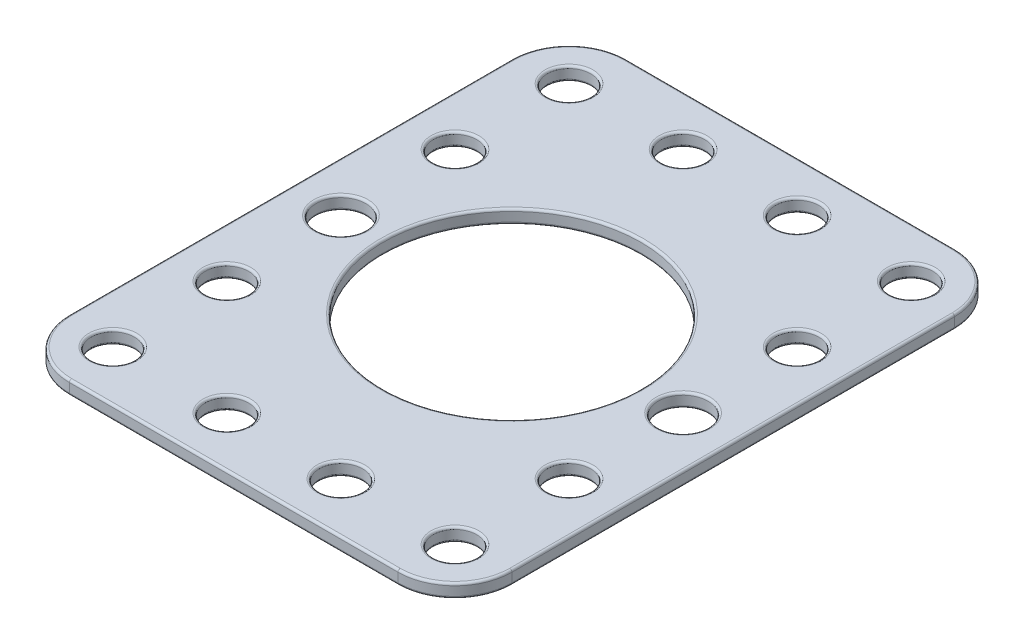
ISO-10303-21;
HEADER;
FILE_DESCRIPTION(('STEP AP214'),'2;1');
FILE_NAME('part.step','',(''),(''),'','','');
FILE_SCHEMA(('AUTOMOTIVE_DESIGN { 1 0 10303 214 1 1 1 1 }'));
ENDSEC;
DATA;
#1=APPLICATION_CONTEXT('core data for automotive mechanical design processes');
#2=APPLICATION_PROTOCOL_DEFINITION('international standard','automotive_design',2000,#1);
#3=PRODUCT_CONTEXT('',#1,'mechanical');
#4=PRODUCT('Part','Part','',(#3));
#5=PRODUCT_RELATED_PRODUCT_CATEGORY('part','',(#4));
#6=PRODUCT_DEFINITION_FORMATION('','',#4);
#7=PRODUCT_DEFINITION_CONTEXT('part definition',#1,'design');
#8=PRODUCT_DEFINITION('design','',#6,#7);
#9=PRODUCT_DEFINITION_SHAPE('','',#8);
#10=(LENGTH_UNIT() NAMED_UNIT(*) SI_UNIT(.MILLI.,.METRE.));
#11=(NAMED_UNIT(*) PLANE_ANGLE_UNIT() SI_UNIT($,.RADIAN.));
#12=(NAMED_UNIT(*) SI_UNIT($,.STERADIAN.) SOLID_ANGLE_UNIT());
#13=UNCERTAINTY_MEASURE_WITH_UNIT(LENGTH_MEASURE(1.E-05),#10,'distance_accuracy_value','');
#14=(GEOMETRIC_REPRESENTATION_CONTEXT(3) GLOBAL_UNCERTAINTY_ASSIGNED_CONTEXT((#13)) GLOBAL_UNIT_ASSIGNED_CONTEXT((#10,
#11,#12)) REPRESENTATION_CONTEXT('',''));
#15=CARTESIAN_POINT('',(0.,0.,0.));
#16=DIRECTION('',(0.,0.,1.));
#17=DIRECTION('',(1.,0.,0.));
#18=AXIS2_PLACEMENT_3D('',#15,#16,#17);
#19=CARTESIAN_POINT('',(6.35,1.524,-55.626));
#20=DIRECTION('',(0.,-1.,0.));
#21=DIRECTION('',(0.,0.,-1.));
#22=AXIS2_PLACEMENT_3D('',#19,#20,#21);
#23=PLANE('',#22);
#24=CARTESIAN_POINT('',(18.288,1.524,-5.588));
#25=DIRECTION('',(0.,-1.,0.));
#26=DIRECTION('',(0.,0.,-1.));
#27=AXIS2_PLACEMENT_3D('',#24,#25,#26);
#28=CIRCLE('',#27,2.667);
#29=CARTESIAN_POINT('',(18.288,1.524,-8.255));
#30=VERTEX_POINT('',#29);
#31=EDGE_CURVE('E11',#30,#30,#28,.T.);
#32=ORIENTED_EDGE('',*,*,#31,.T.);
#33=EDGE_LOOP('',(#32));
#34=FACE_BOUND('',#33,.T.);
#35=CARTESIAN_POINT('',(24.638,1.524,-30.988));
#36=DIRECTION('',(0.,-1.,0.));
#37=DIRECTION('',(0.,0.,-1.));
#38=AXIS2_PLACEMENT_3D('',#35,#36,#37);
#39=CIRCLE('',#38,14.605);
#40=CARTESIAN_POINT('',(24.638,1.524,-45.593));
#41=VERTEX_POINT('',#40);
#42=EDGE_CURVE('E34',#41,#41,#39,.T.);
#43=ORIENTED_EDGE('',*,*,#42,.T.);
#44=EDGE_LOOP('',(#43));
#45=FACE_BOUND('',#44,.T.);
#46=CARTESIAN_POINT('',(5.588,1.524,-30.988));
#47=DIRECTION('',(0.,-1.,0.));
#48=DIRECTION('',(0.,0.,-1.));
#49=AXIS2_PLACEMENT_3D('',#46,#47,#48);
#50=CIRCLE('',#49,3.0226);
#51=CARTESIAN_POINT('',(5.588,1.524,-34.0106));
#52=VERTEX_POINT('',#51);
#53=EDGE_CURVE('E353',#52,#52,#50,.T.);
#54=ORIENTED_EDGE('',*,*,#53,.T.);
#55=EDGE_LOOP('',(#54));
#56=FACE_BOUND('',#55,.T.);
#57=CARTESIAN_POINT('',(42.926,1.524,-55.626));
#58=DIRECTION('',(0.,-1.,0.));
#59=DIRECTION('',(0.,0.,-1.));
#60=AXIS2_PLACEMENT_3D('',#57,#58,#59);
#61=CIRCLE('',#60,6.096);
#62=CARTESIAN_POINT('',(49.022,1.524,-55.626));
#63=VERTEX_POINT('',#62);
#64=CARTESIAN_POINT('',(42.926,1.524,-61.722));
#65=VERTEX_POINT('',#64);
#66=EDGE_CURVE('E41',#63,#65,#61,.F.);
#67=ORIENTED_EDGE('',*,*,#66,.T.);
#68=DIRECTION('',(-1.,0.,0.));
#69=VECTOR('',#68,1.);
#70=CARTESIAN_POINT('',(6.35,1.524,-61.722));
#71=LINE('',#70,#69);
#72=CARTESIAN_POINT('',(6.35000000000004,1.524,-61.722));
#73=VERTEX_POINT('',#72);
#74=EDGE_CURVE('E351',#65,#73,#71,.T.);
#75=ORIENTED_EDGE('',*,*,#74,.T.);
#76=CARTESIAN_POINT('',(6.35,1.524,-55.626));
#77=DIRECTION('',(0.,-1.,0.));
#78=DIRECTION('',(0.,0.,-1.));
#79=AXIS2_PLACEMENT_3D('',#76,#77,#78);
#80=CIRCLE('',#79,6.096);
#81=CARTESIAN_POINT('',(0.253999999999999,1.524,-55.626));
#82=VERTEX_POINT('',#81);
#83=EDGE_CURVE('E339',#73,#82,#80,.F.);
#84=ORIENTED_EDGE('',*,*,#83,.T.);
#85=DIRECTION('',(0.,0.,1.));
#86=VECTOR('',#85,1.);
#87=CARTESIAN_POINT('',(0.254,1.524,-55.626));
#88=LINE('',#87,#86);
#89=CARTESIAN_POINT('',(0.254,1.524,-6.35000000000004));
#90=VERTEX_POINT('',#89);
#91=EDGE_CURVE('E341',#82,#90,#88,.T.);
#92=ORIENTED_EDGE('',*,*,#91,.T.);
#93=CARTESIAN_POINT('',(6.35,1.524,-6.35));
#94=DIRECTION('',(0.,-1.,0.));
#95=DIRECTION('',(0.,0.,-1.));
#96=AXIS2_PLACEMENT_3D('',#93,#94,#95);
#97=CIRCLE('',#96,6.096);
#98=CARTESIAN_POINT('',(6.35000000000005,1.524,-0.254));
#99=VERTEX_POINT('',#98);
#100=EDGE_CURVE('E343',#90,#99,#97,.F.);
#101=ORIENTED_EDGE('',*,*,#100,.T.);
#102=DIRECTION('',(1.,0.,0.));
#103=VECTOR('',#102,1.);
#104=CARTESIAN_POINT('',(6.35,1.524,-0.253999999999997));
#105=LINE('',#104,#103);
#106=CARTESIAN_POINT('',(42.926,1.524,-0.253999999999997));
#107=VERTEX_POINT('',#106);
#108=EDGE_CURVE('E345',#99,#107,#105,.T.);
#109=ORIENTED_EDGE('',*,*,#108,.T.);
#110=CARTESIAN_POINT('',(42.926,1.524,-6.35));
#111=DIRECTION('',(0.,-1.,0.));
#112=DIRECTION('',(0.,0.,-1.));
#113=AXIS2_PLACEMENT_3D('',#110,#111,#112);
#114=CIRCLE('',#113,6.096);
#115=CARTESIAN_POINT('',(49.022,1.524,-6.35000000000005));
#116=VERTEX_POINT('',#115);
#117=EDGE_CURVE('E347',#107,#116,#114,.F.);
#118=ORIENTED_EDGE('',*,*,#117,.T.);
#119=DIRECTION('',(0.,0.,-1.));
#120=VECTOR('',#119,1.);
#121=CARTESIAN_POINT('',(49.022,1.524,-55.626));
#122=LINE('',#121,#120);
#123=EDGE_CURVE('E46',#116,#63,#122,.T.);
#124=ORIENTED_EDGE('',*,*,#123,.T.);
#125=EDGE_LOOP('',(#67,#75,#84,#92,#101,#109,#118,#124));
#126=FACE_BOUND('',#125,.T.);
#127=CARTESIAN_POINT('',(43.688,1.524,-30.988));
#128=DIRECTION('',(0.,-1.,0.));
#129=DIRECTION('',(0.,0.,-1.));
#130=AXIS2_PLACEMENT_3D('',#127,#128,#129);
#131=CIRCLE('',#130,3.0226);
#132=CARTESIAN_POINT('',(43.688,1.524,-34.0106));
#133=VERTEX_POINT('',#132);
#134=EDGE_CURVE('E336',#133,#133,#131,.T.);
#135=ORIENTED_EDGE('',*,*,#134,.T.);
#136=EDGE_LOOP('',(#135));
#137=FACE_BOUND('',#136,.T.);
#138=CARTESIAN_POINT('',(5.588,1.524,-56.388));
#139=DIRECTION('',(0.,-1.,0.));
#140=DIRECTION('',(0.,0.,-1.));
#141=AXIS2_PLACEMENT_3D('',#138,#139,#140);
#142=CIRCLE('',#141,2.667);
#143=CARTESIAN_POINT('',(5.588,1.524,-59.055));
#144=VERTEX_POINT('',#143);
#145=EDGE_CURVE('E333',#144,#144,#142,.T.);
#146=ORIENTED_EDGE('',*,*,#145,.T.);
#147=EDGE_LOOP('',(#146));
#148=FACE_BOUND('',#147,.T.);
#149=CARTESIAN_POINT('',(18.288,1.524,-56.388));
#150=DIRECTION('',(0.,-1.,0.));
#151=DIRECTION('',(0.,0.,-1.));
#152=AXIS2_PLACEMENT_3D('',#149,#150,#151);
#153=CIRCLE('',#152,2.667);
#154=CARTESIAN_POINT('',(18.288,1.524,-59.055));
#155=VERTEX_POINT('',#154);
#156=EDGE_CURVE('E330',#155,#155,#153,.T.);
#157=ORIENTED_EDGE('',*,*,#156,.T.);
#158=EDGE_LOOP('',(#157));
#159=FACE_BOUND('',#158,.T.);
#160=CARTESIAN_POINT('',(30.988,1.524,-56.388));
#161=DIRECTION('',(0.,-1.,0.));
#162=DIRECTION('',(0.,0.,-1.));
#163=AXIS2_PLACEMENT_3D('',#160,#161,#162);
#164=CIRCLE('',#163,2.667);
#165=CARTESIAN_POINT('',(30.988,1.524,-59.055));
#166=VERTEX_POINT('',#165);
#167=EDGE_CURVE('E327',#166,#166,#164,.T.);
#168=ORIENTED_EDGE('',*,*,#167,.T.);
#169=EDGE_LOOP('',(#168));
#170=FACE_BOUND('',#169,.T.);
#171=CARTESIAN_POINT('',(43.688,1.524,-56.388));
#172=DIRECTION('',(0.,-1.,0.));
#173=DIRECTION('',(0.,0.,-1.));
#174=AXIS2_PLACEMENT_3D('',#171,#172,#173);
#175=CIRCLE('',#174,2.667);
#176=CARTESIAN_POINT('',(43.688,1.524,-59.055));
#177=VERTEX_POINT('',#176);
#178=EDGE_CURVE('E324',#177,#177,#175,.T.);
#179=ORIENTED_EDGE('',*,*,#178,.T.);
#180=EDGE_LOOP('',(#179));
#181=FACE_BOUND('',#180,.T.);
#182=CARTESIAN_POINT('',(5.588,1.524,-43.688));
#183=DIRECTION('',(0.,-1.,0.));
#184=DIRECTION('',(0.,0.,-1.));
#185=AXIS2_PLACEMENT_3D('',#182,#183,#184);
#186=CIRCLE('',#185,2.667);
#187=CARTESIAN_POINT('',(5.588,1.524,-46.355));
#188=VERTEX_POINT('',#187);
#189=EDGE_CURVE('E321',#188,#188,#186,.T.);
#190=ORIENTED_EDGE('',*,*,#189,.T.);
#191=EDGE_LOOP('',(#190));
#192=FACE_BOUND('',#191,.T.);
#193=CARTESIAN_POINT('',(5.588,1.524,-18.288));
#194=DIRECTION('',(0.,-1.,0.));
#195=DIRECTION('',(0.,0.,-1.));
#196=AXIS2_PLACEMENT_3D('',#193,#194,#195);
#197=CIRCLE('',#196,2.667);
#198=CARTESIAN_POINT('',(5.588,1.524,-20.955));
#199=VERTEX_POINT('',#198);
#200=EDGE_CURVE('E318',#199,#199,#197,.T.);
#201=ORIENTED_EDGE('',*,*,#200,.T.);
#202=EDGE_LOOP('',(#201));
#203=FACE_BOUND('',#202,.T.);
#204=CARTESIAN_POINT('',(5.588,1.524,-5.588));
#205=DIRECTION('',(0.,-1.,0.));
#206=DIRECTION('',(0.,0.,-1.));
#207=AXIS2_PLACEMENT_3D('',#204,#205,#206);
#208=CIRCLE('',#207,2.667);
#209=CARTESIAN_POINT('',(5.588,1.524,-8.25499999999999));
#210=VERTEX_POINT('',#209);
#211=EDGE_CURVE('E315',#210,#210,#208,.T.);
#212=ORIENTED_EDGE('',*,*,#211,.T.);
#213=EDGE_LOOP('',(#212));
#214=FACE_BOUND('',#213,.T.);
#215=CARTESIAN_POINT('',(43.688,1.524,-5.588));
#216=DIRECTION('',(0.,-1.,0.));
#217=DIRECTION('',(0.,0.,-1.));
#218=AXIS2_PLACEMENT_3D('',#215,#216,#217);
#219=CIRCLE('',#218,2.667);
#220=CARTESIAN_POINT('',(43.688,1.524,-8.255));
#221=VERTEX_POINT('',#220);
#222=EDGE_CURVE('E312',#221,#221,#219,.T.);
#223=ORIENTED_EDGE('',*,*,#222,.T.);
#224=EDGE_LOOP('',(#223));
#225=FACE_BOUND('',#224,.T.);
#226=CARTESIAN_POINT('',(43.688,1.524,-18.288));
#227=DIRECTION('',(0.,-1.,0.));
#228=DIRECTION('',(0.,0.,-1.));
#229=AXIS2_PLACEMENT_3D('',#226,#227,#228);
#230=CIRCLE('',#229,2.667);
#231=CARTESIAN_POINT('',(43.688,1.524,-20.955));
#232=VERTEX_POINT('',#231);
#233=EDGE_CURVE('E309',#232,#232,#230,.T.);
#234=ORIENTED_EDGE('',*,*,#233,.T.);
#235=EDGE_LOOP('',(#234));
#236=FACE_BOUND('',#235,.T.);
#237=CARTESIAN_POINT('',(43.688,1.524,-43.688));
#238=DIRECTION('',(0.,-1.,0.));
#239=DIRECTION('',(0.,0.,-1.));
#240=AXIS2_PLACEMENT_3D('',#237,#238,#239);
#241=CIRCLE('',#240,2.667);
#242=CARTESIAN_POINT('',(43.688,1.524,-46.355));
#243=VERTEX_POINT('',#242);
#244=EDGE_CURVE('E306',#243,#243,#241,.T.);
#245=ORIENTED_EDGE('',*,*,#244,.T.);
#246=EDGE_LOOP('',(#245));
#247=FACE_BOUND('',#246,.T.);
#248=CARTESIAN_POINT('',(30.988,1.524,-5.588));
#249=DIRECTION('',(0.,-1.,0.));
#250=DIRECTION('',(0.,0.,-1.));
#251=AXIS2_PLACEMENT_3D('',#248,#249,#250);
#252=CIRCLE('',#251,2.667);
#253=CARTESIAN_POINT('',(30.988,1.524,-8.255));
#254=VERTEX_POINT('',#253);
#255=EDGE_CURVE('E303',#254,#254,#252,.T.);
#256=ORIENTED_EDGE('',*,*,#255,.T.);
#257=EDGE_LOOP('',(#256));
#258=FACE_BOUND('',#257,.T.);
#259=ADVANCED_FACE('F26',(#34,#45,#56,#126,#137,#148,#159,#170,#181,#192,#203,#214,#225,#236,
#247,#258),#23,.F.);
#260=CARTESIAN_POINT('',(6.35,0.,-55.626));
#261=DIRECTION('',(0.,-1.,0.));
#262=DIRECTION('',(0.,0.,-1.));
#263=AXIS2_PLACEMENT_3D('',#260,#261,#262);
#264=PLANE('',#263);
#265=CARTESIAN_POINT('',(18.288,0.,-5.588));
#266=DIRECTION('',(0.,-1.,0.));
#267=DIRECTION('',(0.,0.,-1.));
#268=AXIS2_PLACEMENT_3D('',#265,#266,#267);
#269=CIRCLE('',#268,2.667);
#270=CARTESIAN_POINT('',(18.288,0.,-8.255));
#271=VERTEX_POINT('',#270);
#272=EDGE_CURVE('E178',#271,#271,#269,.F.);
#273=ORIENTED_EDGE('',*,*,#272,.T.);
#274=EDGE_LOOP('',(#273));
#275=FACE_BOUND('',#274,.T.);
#276=CARTESIAN_POINT('',(24.638,0.,-30.988));
#277=DIRECTION('',(0.,-1.,0.));
#278=DIRECTION('',(0.,0.,-1.));
#279=AXIS2_PLACEMENT_3D('',#276,#277,#278);
#280=CIRCLE('',#279,14.605);
#281=CARTESIAN_POINT('',(24.638,0.,-45.593));
#282=VERTEX_POINT('',#281);
#283=EDGE_CURVE('E170',#282,#282,#280,.F.);
#284=ORIENTED_EDGE('',*,*,#283,.T.);
#285=EDGE_LOOP('',(#284));
#286=FACE_BOUND('',#285,.T.);
#287=CARTESIAN_POINT('',(5.588,0.,-30.988));
#288=DIRECTION('',(0.,-1.,0.));
#289=DIRECTION('',(0.,0.,-1.));
#290=AXIS2_PLACEMENT_3D('',#287,#288,#289);
#291=CIRCLE('',#290,3.0226);
#292=CARTESIAN_POINT('',(5.588,0.,-34.0106));
#293=VERTEX_POINT('',#292);
#294=EDGE_CURVE('E167',#293,#293,#291,.F.);
#295=ORIENTED_EDGE('',*,*,#294,.T.);
#296=EDGE_LOOP('',(#295));
#297=FACE_BOUND('',#296,.T.);
#298=CARTESIAN_POINT('',(6.35,0.,-6.35));
#299=DIRECTION('',(0.,-1.,0.));
#300=DIRECTION('',(0.,0.,-1.));
#301=AXIS2_PLACEMENT_3D('',#298,#299,#300);
#302=CIRCLE('',#301,6.096);
#303=CARTESIAN_POINT('',(6.35000000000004,0.,-0.254));
#304=VERTEX_POINT('',#303);
#305=CARTESIAN_POINT('',(0.254,0.,-6.35000000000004));
#306=VERTEX_POINT('',#305);
#307=EDGE_CURVE('E166',#304,#306,#302,.T.);
#308=ORIENTED_EDGE('',*,*,#307,.T.);
#309=DIRECTION('',(0.,0.,1.));
#310=VECTOR('',#309,1.);
#311=CARTESIAN_POINT('',(0.254,0.,-55.626));
#312=LINE('',#311,#310);
#313=CARTESIAN_POINT('',(0.253999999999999,0.,-55.626));
#314=VERTEX_POINT('',#313);
#315=EDGE_CURVE('E144',#306,#314,#312,.F.);
#316=ORIENTED_EDGE('',*,*,#315,.T.);
#317=CARTESIAN_POINT('',(6.35,0.,-55.626));
#318=DIRECTION('',(0.,-1.,0.));
#319=DIRECTION('',(0.,0.,-1.));
#320=AXIS2_PLACEMENT_3D('',#317,#318,#319);
#321=CIRCLE('',#320,6.096);
#322=CARTESIAN_POINT('',(6.35000000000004,0.,-61.722));
#323=VERTEX_POINT('',#322);
#324=EDGE_CURVE('E154',#314,#323,#321,.T.);
#325=ORIENTED_EDGE('',*,*,#324,.T.);
#326=DIRECTION('',(-1.,0.,0.));
#327=VECTOR('',#326,1.);
#328=CARTESIAN_POINT('',(42.926,0.,-61.722));
#329=LINE('',#328,#327);
#330=CARTESIAN_POINT('',(42.926,0.,-61.722));
#331=VERTEX_POINT('',#330);
#332=EDGE_CURVE('E160',#323,#331,#329,.F.);
#333=ORIENTED_EDGE('',*,*,#332,.T.);
#334=CARTESIAN_POINT('',(42.926,0.,-55.626));
#335=DIRECTION('',(0.,-1.,0.));
#336=DIRECTION('',(0.,0.,-1.));
#337=AXIS2_PLACEMENT_3D('',#334,#335,#336);
#338=CIRCLE('',#337,6.096);
#339=CARTESIAN_POINT('',(49.022,0.,-55.626));
#340=VERTEX_POINT('',#339);
#341=EDGE_CURVE('E509',#331,#340,#338,.T.);
#342=ORIENTED_EDGE('',*,*,#341,.T.);
#343=DIRECTION('',(0.,0.,-1.));
#344=VECTOR('',#343,1.);
#345=CARTESIAN_POINT('',(49.022,0.,-6.35000000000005));
#346=LINE('',#345,#344);
#347=CARTESIAN_POINT('',(49.022,0.,-6.35000000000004));
#348=VERTEX_POINT('',#347);
#349=EDGE_CURVE('E511',#340,#348,#346,.F.);
#350=ORIENTED_EDGE('',*,*,#349,.T.);
#351=CARTESIAN_POINT('',(42.926,0.,-6.35));
#352=DIRECTION('',(0.,-1.,0.));
#353=DIRECTION('',(0.,0.,-1.));
#354=AXIS2_PLACEMENT_3D('',#351,#352,#353);
#355=CIRCLE('',#354,6.096);
#356=CARTESIAN_POINT('',(42.926,0.,-0.253999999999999));
#357=VERTEX_POINT('',#356);
#358=EDGE_CURVE('E513',#348,#357,#355,.T.);
#359=ORIENTED_EDGE('',*,*,#358,.T.);
#360=DIRECTION('',(1.,0.,0.));
#361=VECTOR('',#360,1.);
#362=CARTESIAN_POINT('',(6.35000000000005,0.,-0.254));
#363=LINE('',#362,#361);
#364=EDGE_CURVE('E172',#357,#304,#363,.F.);
#365=ORIENTED_EDGE('',*,*,#364,.T.);
#366=EDGE_LOOP('',(#308,#316,#325,#333,#342,#350,#359,#365));
#367=FACE_BOUND('',#366,.T.);
#368=CARTESIAN_POINT('',(43.688,0.,-30.988));
#369=DIRECTION('',(0.,-1.,0.));
#370=DIRECTION('',(0.,0.,-1.));
#371=AXIS2_PLACEMENT_3D('',#368,#369,#370);
#372=CIRCLE('',#371,3.0226);
#373=CARTESIAN_POINT('',(43.688,0.,-34.0106));
#374=VERTEX_POINT('',#373);
#375=EDGE_CURVE('E161',#374,#374,#372,.F.);
#376=ORIENTED_EDGE('',*,*,#375,.T.);
#377=EDGE_LOOP('',(#376));
#378=FACE_BOUND('',#377,.T.);
#379=CARTESIAN_POINT('',(5.588,0.,-56.388));
#380=DIRECTION('',(0.,-1.,0.));
#381=DIRECTION('',(0.,0.,-1.));
#382=AXIS2_PLACEMENT_3D('',#379,#380,#381);
#383=CIRCLE('',#382,2.667);
#384=CARTESIAN_POINT('',(5.588,0.,-59.055));
#385=VERTEX_POINT('',#384);
#386=EDGE_CURVE('E503',#385,#385,#383,.F.);
#387=ORIENTED_EDGE('',*,*,#386,.T.);
#388=EDGE_LOOP('',(#387));
#389=FACE_BOUND('',#388,.T.);
#390=CARTESIAN_POINT('',(18.288,0.,-56.388));
#391=DIRECTION('',(0.,-1.,0.));
#392=DIRECTION('',(0.,0.,-1.));
#393=AXIS2_PLACEMENT_3D('',#390,#391,#392);
#394=CIRCLE('',#393,2.667);
#395=CARTESIAN_POINT('',(18.288,0.,-59.055));
#396=VERTEX_POINT('',#395);
#397=EDGE_CURVE('E500',#396,#396,#394,.F.);
#398=ORIENTED_EDGE('',*,*,#397,.T.);
#399=EDGE_LOOP('',(#398));
#400=FACE_BOUND('',#399,.T.);
#401=CARTESIAN_POINT('',(30.988,0.,-56.388));
#402=DIRECTION('',(0.,-1.,0.));
#403=DIRECTION('',(0.,0.,-1.));
#404=AXIS2_PLACEMENT_3D('',#401,#402,#403);
#405=CIRCLE('',#404,2.667);
#406=CARTESIAN_POINT('',(30.988,0.,-59.055));
#407=VERTEX_POINT('',#406);
#408=EDGE_CURVE('E497',#407,#407,#405,.F.);
#409=ORIENTED_EDGE('',*,*,#408,.T.);
#410=EDGE_LOOP('',(#409));
#411=FACE_BOUND('',#410,.T.);
#412=CARTESIAN_POINT('',(43.688,0.,-56.388));
#413=DIRECTION('',(0.,-1.,0.));
#414=DIRECTION('',(0.,0.,-1.));
#415=AXIS2_PLACEMENT_3D('',#412,#413,#414);
#416=CIRCLE('',#415,2.667);
#417=CARTESIAN_POINT('',(43.688,0.,-59.055));
#418=VERTEX_POINT('',#417);
#419=EDGE_CURVE('E494',#418,#418,#416,.F.);
#420=ORIENTED_EDGE('',*,*,#419,.T.);
#421=EDGE_LOOP('',(#420));
#422=FACE_BOUND('',#421,.T.);
#423=CARTESIAN_POINT('',(5.588,0.,-43.688));
#424=DIRECTION('',(0.,-1.,0.));
#425=DIRECTION('',(0.,0.,-1.));
#426=AXIS2_PLACEMENT_3D('',#423,#424,#425);
#427=CIRCLE('',#426,2.667);
#428=CARTESIAN_POINT('',(5.588,0.,-46.355));
#429=VERTEX_POINT('',#428);
#430=EDGE_CURVE('E491',#429,#429,#427,.F.);
#431=ORIENTED_EDGE('',*,*,#430,.T.);
#432=EDGE_LOOP('',(#431));
#433=FACE_BOUND('',#432,.T.);
#434=CARTESIAN_POINT('',(5.588,0.,-18.288));
#435=DIRECTION('',(0.,-1.,0.));
#436=DIRECTION('',(0.,0.,-1.));
#437=AXIS2_PLACEMENT_3D('',#434,#435,#436);
#438=CIRCLE('',#437,2.667);
#439=CARTESIAN_POINT('',(5.588,0.,-20.955));
#440=VERTEX_POINT('',#439);
#441=EDGE_CURVE('E488',#440,#440,#438,.F.);
#442=ORIENTED_EDGE('',*,*,#441,.T.);
#443=EDGE_LOOP('',(#442));
#444=FACE_BOUND('',#443,.T.);
#445=CARTESIAN_POINT('',(5.588,0.,-5.588));
#446=DIRECTION('',(0.,-1.,0.));
#447=DIRECTION('',(0.,0.,-1.));
#448=AXIS2_PLACEMENT_3D('',#445,#446,#447);
#449=CIRCLE('',#448,2.667);
#450=CARTESIAN_POINT('',(5.588,0.,-8.25499999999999));
#451=VERTEX_POINT('',#450);
#452=EDGE_CURVE('E485',#451,#451,#449,.F.);
#453=ORIENTED_EDGE('',*,*,#452,.T.);
#454=EDGE_LOOP('',(#453));
#455=FACE_BOUND('',#454,.T.);
#456=CARTESIAN_POINT('',(43.688,0.,-5.588));
#457=DIRECTION('',(0.,-1.,0.));
#458=DIRECTION('',(0.,0.,-1.));
#459=AXIS2_PLACEMENT_3D('',#456,#457,#458);
#460=CIRCLE('',#459,2.667);
#461=CARTESIAN_POINT('',(43.688,0.,-8.255));
#462=VERTEX_POINT('',#461);
#463=EDGE_CURVE('E482',#462,#462,#460,.F.);
#464=ORIENTED_EDGE('',*,*,#463,.T.);
#465=EDGE_LOOP('',(#464));
#466=FACE_BOUND('',#465,.T.);
#467=CARTESIAN_POINT('',(43.688,0.,-18.288));
#468=DIRECTION('',(0.,-1.,0.));
#469=DIRECTION('',(0.,0.,-1.));
#470=AXIS2_PLACEMENT_3D('',#467,#468,#469);
#471=CIRCLE('',#470,2.667);
#472=CARTESIAN_POINT('',(43.688,0.,-20.955));
#473=VERTEX_POINT('',#472);
#474=EDGE_CURVE('E479',#473,#473,#471,.F.);
#475=ORIENTED_EDGE('',*,*,#474,.T.);
#476=EDGE_LOOP('',(#475));
#477=FACE_BOUND('',#476,.T.);
#478=CARTESIAN_POINT('',(43.688,0.,-43.688));
#479=DIRECTION('',(0.,-1.,0.));
#480=DIRECTION('',(0.,0.,-1.));
#481=AXIS2_PLACEMENT_3D('',#478,#479,#480);
#482=CIRCLE('',#481,2.667);
#483=CARTESIAN_POINT('',(43.688,0.,-46.355));
#484=VERTEX_POINT('',#483);
#485=EDGE_CURVE('E476',#484,#484,#482,.F.);
#486=ORIENTED_EDGE('',*,*,#485,.T.);
#487=EDGE_LOOP('',(#486));
#488=FACE_BOUND('',#487,.T.);
#489=CARTESIAN_POINT('',(30.988,0.,-5.588));
#490=DIRECTION('',(0.,-1.,0.));
#491=DIRECTION('',(0.,0.,-1.));
#492=AXIS2_PLACEMENT_3D('',#489,#490,#491);
#493=CIRCLE('',#492,2.667);
#494=CARTESIAN_POINT('',(30.988,0.,-8.255));
#495=VERTEX_POINT('',#494);
#496=EDGE_CURVE('E473',#495,#495,#493,.F.);
#497=ORIENTED_EDGE('',*,*,#496,.T.);
#498=EDGE_LOOP('',(#497));
#499=FACE_BOUND('',#498,.T.);
#500=ADVANCED_FACE('F163',(#275,#286,#297,#367,#378,#389,#400,#411,#422,#433,#444,#455,#466,
#477,#488,#499),#264,.T.);
#501=CARTESIAN_POINT('',(6.35,1.524,-55.626));
#502=DIRECTION('',(0.,-1.,0.));
#503=DIRECTION('',(0.,0.,-1.));
#504=AXIS2_PLACEMENT_3D('',#501,#502,#503);
#505=CYLINDRICAL_SURFACE('',#504,6.35);
#506=DIRECTION('',(0.,-1.,0.));
#507=VECTOR('',#506,1.);
#508=CARTESIAN_POINT('',(6.35000000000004,1.524,-61.976));
#509=LINE('',#508,#507);
#510=CARTESIAN_POINT('',(6.35000000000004,1.27,-61.976));
#511=VERTEX_POINT('',#510);
#512=CARTESIAN_POINT('',(6.35000000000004,0.254000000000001,-61.976));
#513=VERTEX_POINT('',#512);
#514=EDGE_CURVE('E428',#511,#513,#509,.T.);
#515=ORIENTED_EDGE('',*,*,#514,.T.);
#516=CARTESIAN_POINT('',(6.35,0.254,-55.626));
#517=DIRECTION('',(0.,-1.,0.));
#518=DIRECTION('',(0.,0.,-1.));
#519=AXIS2_PLACEMENT_3D('',#516,#517,#518);
#520=CIRCLE('',#519,6.35);
#521=CARTESIAN_POINT('',(0.,0.254000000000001,-55.626));
#522=VERTEX_POINT('',#521);
#523=EDGE_CURVE('E229',#513,#522,#520,.F.);
#524=ORIENTED_EDGE('',*,*,#523,.T.);
#525=DIRECTION('',(0.,-1.,0.));
#526=VECTOR('',#525,1.);
#527=CARTESIAN_POINT('',(0.,1.524,-55.626));
#528=LINE('',#527,#526);
#529=CARTESIAN_POINT('',(0.,1.27,-55.626));
#530=VERTEX_POINT('',#529);
#531=EDGE_CURVE('E471',#530,#522,#528,.T.);
#532=ORIENTED_EDGE('',*,*,#531,.F.);
#533=CARTESIAN_POINT('',(6.35,1.27,-55.626));
#534=DIRECTION('',(0.,-1.,0.));
#535=DIRECTION('',(0.,0.,-1.));
#536=AXIS2_PLACEMENT_3D('',#533,#534,#535);
#537=CIRCLE('',#536,6.35);
#538=EDGE_CURVE('E227',#530,#511,#537,.T.);
#539=ORIENTED_EDGE('',*,*,#538,.T.);
#540=EDGE_LOOP('',(#515,#524,#532,#539));
#541=FACE_BOUND('',#540,.T.);
#542=ADVANCED_FACE('F390',(#541),#505,.T.);
#543=CARTESIAN_POINT('',(0.,1.524,-6.35000000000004));
#544=DIRECTION('',(1.,0.,0.));
#545=DIRECTION('',(0.,0.,-1.));
#546=AXIS2_PLACEMENT_3D('',#543,#544,#545);
#547=PLANE('',#546);
#548=ORIENTED_EDGE('',*,*,#531,.T.);
#549=DIRECTION('',(0.,0.,1.));
#550=VECTOR('',#549,1.);
#551=CARTESIAN_POINT('',(0.,0.254,-6.35000000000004));
#552=LINE('',#551,#550);
#553=CARTESIAN_POINT('',(0.,0.254000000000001,-6.35000000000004));
#554=VERTEX_POINT('',#553);
#555=EDGE_CURVE('E147',#522,#554,#552,.T.);
#556=ORIENTED_EDGE('',*,*,#555,.T.);
#557=DIRECTION('',(0.,-1.,0.));
#558=VECTOR('',#557,1.);
#559=CARTESIAN_POINT('',(0.,1.524,-6.35000000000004));
#560=LINE('',#559,#558);
#561=CARTESIAN_POINT('',(0.,1.27,-6.35000000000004));
#562=VERTEX_POINT('',#561);
#563=EDGE_CURVE('E468',#562,#554,#560,.T.);
#564=ORIENTED_EDGE('',*,*,#563,.F.);
#565=DIRECTION('',(0.,0.,1.));
#566=VECTOR('',#565,1.);
#567=CARTESIAN_POINT('',(0.,1.27,-6.35000000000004));
#568=LINE('',#567,#566);
#569=EDGE_CURVE('E199',#562,#530,#568,.F.);
#570=ORIENTED_EDGE('',*,*,#569,.T.);
#571=EDGE_LOOP('',(#548,#556,#564,#570));
#572=FACE_BOUND('',#571,.T.);
#573=ADVANCED_FACE('F418',(#572),#547,.F.);
#574=CARTESIAN_POINT('',(6.35,1.524,-6.35));
#575=DIRECTION('',(0.,-1.,0.));
#576=DIRECTION('',(0.,0.,-1.));
#577=AXIS2_PLACEMENT_3D('',#574,#575,#576);
#578=CYLINDRICAL_SURFACE('',#577,6.35);
#579=ORIENTED_EDGE('',*,*,#563,.T.);
#580=CARTESIAN_POINT('',(6.35,0.254,-6.35));
#581=DIRECTION('',(0.,-1.,0.));
#582=DIRECTION('',(0.,0.,-1.));
#583=AXIS2_PLACEMENT_3D('',#580,#581,#582);
#584=CIRCLE('',#583,6.35);
#585=CARTESIAN_POINT('',(6.35000000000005,0.254000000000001,0.));
#586=VERTEX_POINT('',#585);
#587=EDGE_CURVE('E204',#554,#586,#584,.F.);
#588=ORIENTED_EDGE('',*,*,#587,.T.);
#589=DIRECTION('',(0.,-1.,0.));
#590=VECTOR('',#589,1.);
#591=CARTESIAN_POINT('',(6.35000000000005,1.524,0.));
#592=LINE('',#591,#590);
#593=CARTESIAN_POINT('',(6.35000000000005,1.27,0.));
#594=VERTEX_POINT('',#593);
#595=EDGE_CURVE('E465',#594,#586,#592,.T.);
#596=ORIENTED_EDGE('',*,*,#595,.F.);
#597=CARTESIAN_POINT('',(6.35,1.27,-6.35));
#598=DIRECTION('',(0.,-1.,0.));
#599=DIRECTION('',(0.,0.,-1.));
#600=AXIS2_PLACEMENT_3D('',#597,#598,#599);
#601=CIRCLE('',#600,6.35);
#602=EDGE_CURVE('E202',#594,#562,#601,.T.);
#603=ORIENTED_EDGE('',*,*,#602,.T.);
#604=EDGE_LOOP('',(#579,#588,#596,#603));
#605=FACE_BOUND('',#604,.T.);
#606=ADVANCED_FACE('F414',(#605),#578,.T.);
#607=CARTESIAN_POINT('',(6.35000000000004,1.524,0.));
#608=DIRECTION('',(0.,0.,-1.));
#609=DIRECTION('',(-1.,0.,0.));
#610=AXIS2_PLACEMENT_3D('',#607,#608,#609);
#611=PLANE('',#610);
#612=ORIENTED_EDGE('',*,*,#595,.T.);
#613=DIRECTION('',(1.,0.,0.));
#614=VECTOR('',#613,1.);
#615=CARTESIAN_POINT('',(42.926,0.254,0.));
#616=LINE('',#615,#614);
#617=CARTESIAN_POINT('',(42.926,0.254000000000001,0.));
#618=VERTEX_POINT('',#617);
#619=EDGE_CURVE('E208',#586,#618,#616,.T.);
#620=ORIENTED_EDGE('',*,*,#619,.T.);
#621=DIRECTION('',(0.,-1.,0.));
#622=VECTOR('',#621,1.);
#623=CARTESIAN_POINT('',(42.926,1.524,0.));
#624=LINE('',#623,#622);
#625=CARTESIAN_POINT('',(42.926,1.27,0.));
#626=VERTEX_POINT('',#625);
#627=EDGE_CURVE('E462',#626,#618,#624,.T.);
#628=ORIENTED_EDGE('',*,*,#627,.F.);
#629=DIRECTION('',(1.,0.,0.));
#630=VECTOR('',#629,1.);
#631=CARTESIAN_POINT('',(6.35000000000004,1.27,0.));
#632=LINE('',#631,#630);
#633=EDGE_CURVE('E206',#626,#594,#632,.F.);
#634=ORIENTED_EDGE('',*,*,#633,.T.);
#635=EDGE_LOOP('',(#612,#620,#628,#634));
#636=FACE_BOUND('',#635,.T.);
#637=ADVANCED_FACE('F410',(#636),#611,.F.);
#638=CARTESIAN_POINT('',(42.926,1.524,-6.35));
#639=DIRECTION('',(0.,-1.,0.));
#640=DIRECTION('',(0.,0.,-1.));
#641=AXIS2_PLACEMENT_3D('',#638,#639,#640);
#642=CYLINDRICAL_SURFACE('',#641,6.35);
#643=ORIENTED_EDGE('',*,*,#627,.T.);
#644=CARTESIAN_POINT('',(42.926,0.254,-6.35));
#645=DIRECTION('',(0.,-1.,0.));
#646=DIRECTION('',(0.,0.,-1.));
#647=AXIS2_PLACEMENT_3D('',#644,#645,#646);
#648=CIRCLE('',#647,6.35);
#649=CARTESIAN_POINT('',(49.276,0.254000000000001,-6.35000000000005));
#650=VERTEX_POINT('',#649);
#651=EDGE_CURVE('E212',#618,#650,#648,.F.);
#652=ORIENTED_EDGE('',*,*,#651,.T.);
#653=DIRECTION('',(0.,-1.,0.));
#654=VECTOR('',#653,1.);
#655=CARTESIAN_POINT('',(49.276,1.524,-6.35000000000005));
#656=LINE('',#655,#654);
#657=CARTESIAN_POINT('',(49.276,1.27,-6.35000000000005));
#658=VERTEX_POINT('',#657);
#659=EDGE_CURVE('E459',#658,#650,#656,.T.);
#660=ORIENTED_EDGE('',*,*,#659,.F.);
#661=CARTESIAN_POINT('',(42.926,1.27,-6.35));
#662=DIRECTION('',(0.,-1.,0.));
#663=DIRECTION('',(0.,0.,-1.));
#664=AXIS2_PLACEMENT_3D('',#661,#662,#663);
#665=CIRCLE('',#664,6.35);
#666=EDGE_CURVE('E210',#658,#626,#665,.T.);
#667=ORIENTED_EDGE('',*,*,#666,.T.);
#668=EDGE_LOOP('',(#643,#652,#660,#667));
#669=FACE_BOUND('',#668,.T.);
#670=ADVANCED_FACE('F406',(#669),#642,.T.);
#671=CARTESIAN_POINT('',(49.276,1.524,-6.35000000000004));
#672=DIRECTION('',(-1.,0.,0.));
#673=DIRECTION('',(0.,0.,1.));
#674=AXIS2_PLACEMENT_3D('',#671,#672,#673);
#675=PLANE('',#674);
#676=ORIENTED_EDGE('',*,*,#659,.T.);
#677=DIRECTION('',(0.,0.,-1.));
#678=VECTOR('',#677,1.);
#679=CARTESIAN_POINT('',(49.276,0.254,-55.626));
#680=LINE('',#679,#678);
#681=CARTESIAN_POINT('',(49.276,0.254000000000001,-55.626));
#682=VERTEX_POINT('',#681);
#683=EDGE_CURVE('E216',#650,#682,#680,.T.);
#684=ORIENTED_EDGE('',*,*,#683,.T.);
#685=DIRECTION('',(0.,-1.,0.));
#686=VECTOR('',#685,1.);
#687=CARTESIAN_POINT('',(49.276,1.524,-55.626));
#688=LINE('',#687,#686);
#689=CARTESIAN_POINT('',(49.276,1.27,-55.626));
#690=VERTEX_POINT('',#689);
#691=EDGE_CURVE('E456',#690,#682,#688,.T.);
#692=ORIENTED_EDGE('',*,*,#691,.F.);
#693=DIRECTION('',(0.,0.,-1.));
#694=VECTOR('',#693,1.);
#695=CARTESIAN_POINT('',(49.276,1.27,-6.35000000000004));
#696=LINE('',#695,#694);
#697=EDGE_CURVE('E214',#690,#658,#696,.F.);
#698=ORIENTED_EDGE('',*,*,#697,.T.);
#699=EDGE_LOOP('',(#676,#684,#692,#698));
#700=FACE_BOUND('',#699,.T.);
#701=ADVANCED_FACE('F402',(#700),#675,.F.);
#702=CARTESIAN_POINT('',(42.926,1.524,-55.626));
#703=DIRECTION('',(0.,-1.,0.));
#704=DIRECTION('',(0.,0.,-1.));
#705=AXIS2_PLACEMENT_3D('',#702,#703,#704);
#706=CYLINDRICAL_SURFACE('',#705,6.35);
#707=ORIENTED_EDGE('',*,*,#691,.T.);
#708=CARTESIAN_POINT('',(42.926,0.254,-55.626));
#709=DIRECTION('',(0.,-1.,0.));
#710=DIRECTION('',(0.,0.,-1.));
#711=AXIS2_PLACEMENT_3D('',#708,#709,#710);
#712=CIRCLE('',#711,6.35);
#713=CARTESIAN_POINT('',(42.926,0.254000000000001,-61.976));
#714=VERTEX_POINT('',#713);
#715=EDGE_CURVE('E220',#682,#714,#712,.F.);
#716=ORIENTED_EDGE('',*,*,#715,.T.);
#717=DIRECTION('',(0.,-1.,0.));
#718=VECTOR('',#717,1.);
#719=CARTESIAN_POINT('',(42.926,1.524,-61.976));
#720=LINE('',#719,#718);
#721=CARTESIAN_POINT('',(42.926,1.27,-61.976));
#722=VERTEX_POINT('',#721);
#723=EDGE_CURVE('E433',#722,#714,#720,.T.);
#724=ORIENTED_EDGE('',*,*,#723,.F.);
#725=CARTESIAN_POINT('',(42.926,1.27,-55.626));
#726=DIRECTION('',(0.,-1.,0.));
#727=DIRECTION('',(0.,0.,-1.));
#728=AXIS2_PLACEMENT_3D('',#725,#726,#727);
#729=CIRCLE('',#728,6.35);
#730=EDGE_CURVE('E218',#722,#690,#729,.T.);
#731=ORIENTED_EDGE('',*,*,#730,.T.);
#732=EDGE_LOOP('',(#707,#716,#724,#731));
#733=FACE_BOUND('',#732,.T.);
#734=ADVANCED_FACE('F398',(#733),#706,.T.);
#735=CARTESIAN_POINT('',(6.35000000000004,1.524,-61.976));
#736=DIRECTION('',(0.,0.,1.));
#737=DIRECTION('',(1.,0.,0.));
#738=AXIS2_PLACEMENT_3D('',#735,#736,#737);
#739=PLANE('',#738);
#740=ORIENTED_EDGE('',*,*,#723,.T.);
#741=DIRECTION('',(-1.,0.,0.));
#742=VECTOR('',#741,1.);
#743=CARTESIAN_POINT('',(6.35000000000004,0.254,-61.976));
#744=LINE('',#743,#742);
#745=EDGE_CURVE('E225',#714,#513,#744,.T.);
#746=ORIENTED_EDGE('',*,*,#745,.T.);
#747=ORIENTED_EDGE('',*,*,#514,.F.);
#748=DIRECTION('',(-1.,0.,0.));
#749=VECTOR('',#748,1.);
#750=CARTESIAN_POINT('',(6.35000000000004,1.27,-61.976));
#751=LINE('',#750,#749);
#752=EDGE_CURVE('E222',#511,#722,#751,.F.);
#753=ORIENTED_EDGE('',*,*,#752,.T.);
#754=EDGE_LOOP('',(#740,#746,#747,#753));
#755=FACE_BOUND('',#754,.T.);
#756=ADVANCED_FACE('F395',(#755),#739,.F.);
#757=CARTESIAN_POINT('',(5.588,1.524,-30.988));
#758=DIRECTION('',(0.,-1.,0.));
#759=DIRECTION('',(0.,0.,-1.));
#760=AXIS2_PLACEMENT_3D('',#757,#758,#759);
#761=CYLINDRICAL_SURFACE('',#760,2.7686);
#762=CARTESIAN_POINT('',(5.588,0.254,-30.988));
#763=DIRECTION('',(0.,-1.,0.));
#764=DIRECTION('',(0.,0.,-1.));
#765=AXIS2_PLACEMENT_3D('',#762,#763,#764);
#766=CIRCLE('',#765,2.7686);
#767=CARTESIAN_POINT('',(5.588,0.254,-33.7566));
#768=VERTEX_POINT('',#767);
#769=EDGE_CURVE('E196',#768,#768,#766,.T.);
#770=CARTESIAN_POINT('',(5.588,1.27,-30.988));
#771=DIRECTION('',(0.,-1.,0.));
#772=DIRECTION('',(0.,0.,-1.));
#773=AXIS2_PLACEMENT_3D('',#770,#771,#772);
#774=CIRCLE('',#773,2.7686);
#775=CARTESIAN_POINT('',(5.588,1.27,-33.7566));
#776=VERTEX_POINT('',#775);
#777=EDGE_CURVE('E193',#776,#776,#774,.F.);
#778=CARTESIAN_POINT('',(5.588,0.254,-33.7566));
#779=CARTESIAN_POINT('',(5.588,0.264583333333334,-33.7566));
#780=CARTESIAN_POINT('',(5.588,0.275166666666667,-33.7566));
#781=CARTESIAN_POINT('',(5.588,0.296333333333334,-33.7566));
#782=CARTESIAN_POINT('',(5.588,0.306916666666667,-33.7566));
#783=CARTESIAN_POINT('',(5.588,0.328083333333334,-33.7566));
#784=CARTESIAN_POINT('',(5.588,0.338666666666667,-33.7566));
#785=CARTESIAN_POINT('',(5.588,0.359833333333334,-33.7566));
#786=CARTESIAN_POINT('',(5.588,0.370416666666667,-33.7566));
#787=CARTESIAN_POINT('',(5.588,0.391583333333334,-33.7566));
#788=CARTESIAN_POINT('',(5.588,0.402166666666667,-33.7566));
#789=CARTESIAN_POINT('',(5.588,0.423333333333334,-33.7566));
#790=CARTESIAN_POINT('',(5.588,0.433916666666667,-33.7566));
#791=CARTESIAN_POINT('',(5.588,0.455083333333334,-33.7566));
#792=CARTESIAN_POINT('',(5.588,0.465666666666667,-33.7566));
#793=CARTESIAN_POINT('',(5.588,0.486833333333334,-33.7566));
#794=CARTESIAN_POINT('',(5.588,0.497416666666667,-33.7566));
#795=CARTESIAN_POINT('',(5.588,0.518583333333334,-33.7566));
#796=CARTESIAN_POINT('',(5.588,0.529166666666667,-33.7566));
#797=CARTESIAN_POINT('',(5.588,0.550333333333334,-33.7566));
#798=CARTESIAN_POINT('',(5.588,0.560916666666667,-33.7566));
#799=CARTESIAN_POINT('',(5.588,0.582083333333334,-33.7566));
#800=CARTESIAN_POINT('',(5.588,0.592666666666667,-33.7566));
#801=CARTESIAN_POINT('',(5.588,0.613833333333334,-33.7566));
#802=CARTESIAN_POINT('',(5.588,0.624416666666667,-33.7566));
#803=CARTESIAN_POINT('',(5.588,0.645583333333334,-33.7566));
#804=CARTESIAN_POINT('',(5.588,0.656166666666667,-33.7566));
#805=CARTESIAN_POINT('',(5.588,0.677333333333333,-33.7566));
#806=CARTESIAN_POINT('',(5.588,0.687916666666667,-33.7566));
#807=CARTESIAN_POINT('',(5.588,0.709083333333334,-33.7566));
#808=CARTESIAN_POINT('',(5.588,0.719666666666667,-33.7566));
#809=CARTESIAN_POINT('',(5.588,0.740833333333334,-33.7566));
#810=CARTESIAN_POINT('',(5.588,0.751416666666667,-33.7566));
#811=CARTESIAN_POINT('',(5.588,0.772583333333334,-33.7566));
#812=CARTESIAN_POINT('',(5.588,0.783166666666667,-33.7566));
#813=CARTESIAN_POINT('',(5.588,0.804333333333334,-33.7566));
#814=CARTESIAN_POINT('',(5.588,0.814916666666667,-33.7566));
#815=CARTESIAN_POINT('',(5.588,0.836083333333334,-33.7566));
#816=CARTESIAN_POINT('',(5.588,0.846666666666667,-33.7566));
#817=CARTESIAN_POINT('',(5.588,0.867833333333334,-33.7566));
#818=CARTESIAN_POINT('',(5.588,0.878416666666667,-33.7566));
#819=CARTESIAN_POINT('',(5.588,0.899583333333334,-33.7566));
#820=CARTESIAN_POINT('',(5.588,0.910166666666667,-33.7566));
#821=CARTESIAN_POINT('',(5.588,0.931333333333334,-33.7566));
#822=CARTESIAN_POINT('',(5.588,0.941916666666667,-33.7566));
#823=CARTESIAN_POINT('',(5.588,0.963083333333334,-33.7566));
#824=CARTESIAN_POINT('',(5.588,0.973666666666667,-33.7566));
#825=CARTESIAN_POINT('',(5.588,0.994833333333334,-33.7566));
#826=CARTESIAN_POINT('',(5.588,1.00541666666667,-33.7566));
#827=CARTESIAN_POINT('',(5.588,1.02658333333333,-33.7566));
#828=CARTESIAN_POINT('',(5.588,1.03716666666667,-33.7566));
#829=CARTESIAN_POINT('',(5.588,1.05833333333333,-33.7566));
#830=CARTESIAN_POINT('',(5.588,1.06891666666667,-33.7566));
#831=CARTESIAN_POINT('',(5.588,1.09008333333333,-33.7566));
#832=CARTESIAN_POINT('',(5.588,1.10066666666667,-33.7566));
#833=CARTESIAN_POINT('',(5.588,1.12183333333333,-33.7566));
#834=CARTESIAN_POINT('',(5.588,1.13241666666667,-33.7566));
#835=CARTESIAN_POINT('',(5.588,1.15358333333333,-33.7566));
#836=CARTESIAN_POINT('',(5.588,1.16416666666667,-33.7566));
#837=CARTESIAN_POINT('',(5.588,1.18533333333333,-33.7566));
#838=CARTESIAN_POINT('',(5.588,1.19591666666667,-33.7566));
#839=CARTESIAN_POINT('',(5.588,1.21708333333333,-33.7566));
#840=CARTESIAN_POINT('',(5.588,1.22766666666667,-33.7566));
#841=CARTESIAN_POINT('',(5.588,1.24883333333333,-33.7566));
#842=CARTESIAN_POINT('',(5.588,1.25941666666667,-33.7566));
#843=CARTESIAN_POINT('',(5.588,1.27,-33.7566));
#844=B_SPLINE_CURVE_WITH_KNOTS('',3,(#778,#779,#780,#781,#782,#783,#784,#785,#786,#787,#788,
#789,#790,#791,#792,#793,#794,#795,#796,#797,#798,#799,#800,#801,#802,#803,#804,#805,#806,#807,
#808,#809,#810,#811,#812,#813,#814,#815,#816,#817,#818,#819,#820,#821,#822,#823,#824,#825,#826,
#827,#828,#829,#830,#831,#832,#833,#834,#835,#836,#837,#838,#839,#840,#841,#842,#843),
.UNSPECIFIED.,.F.,.F.,(4,2,2,2,2,2,2,2,2,2,2,2,2,2,2,2,2,2,2,2,2,2,2,2,2,2,2,2,2,2,2,2,4),(0.,
0.0317500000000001,0.0635,0.0952500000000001,0.127,0.15875,0.1905,0.22225,0.254,0.28575,0.3175,
0.34925,0.381,0.41275,0.4445,0.47625,0.508,0.53975,0.5715,0.60325,0.635,0.66675,0.6985,0.73025,
0.762,0.79375,0.8255,0.85725,0.889,0.92075,0.9525,0.98425,1.016),.UNSPECIFIED.);
#845=EDGE_CURVE('BSEAM381',#768,#776,#844,.T.);
#846=ORIENTED_EDGE('',*,*,#769,.T.);
#847=ORIENTED_EDGE('',*,*,#777,.T.);
#848=ORIENTED_EDGE('',*,*,#845,.T.);
#849=ORIENTED_EDGE('',*,*,#845,.F.);
#850=EDGE_LOOP('',(#846,#848,#847,#849));
#851=FACE_BOUND('',#850,.T.);
#852=ADVANCED_FACE('F381',(#851),#761,.F.);
#853=CARTESIAN_POINT('',(43.688,1.524,-30.988));
#854=DIRECTION('',(0.,-1.,0.));
#855=DIRECTION('',(0.,0.,-1.));
#856=AXIS2_PLACEMENT_3D('',#853,#854,#855);
#857=CYLINDRICAL_SURFACE('',#856,2.7686);
#858=CARTESIAN_POINT('',(43.688,0.254,-30.988));
#859=DIRECTION('',(0.,-1.,0.));
#860=DIRECTION('',(0.,0.,-1.));
#861=AXIS2_PLACEMENT_3D('',#858,#859,#860);
#862=CIRCLE('',#861,2.7686);
#863=CARTESIAN_POINT('',(43.688,0.254,-33.7566));
#864=VERTEX_POINT('',#863);
#865=EDGE_CURVE('E234',#864,#864,#862,.T.);
#866=CARTESIAN_POINT('',(43.688,1.27,-30.988));
#867=DIRECTION('',(0.,-1.,0.));
#868=DIRECTION('',(0.,0.,-1.));
#869=AXIS2_PLACEMENT_3D('',#866,#867,#868);
#870=CIRCLE('',#869,2.7686);
#871=CARTESIAN_POINT('',(43.688,1.27,-33.7566));
#872=VERTEX_POINT('',#871);
#873=EDGE_CURVE('E231',#872,#872,#870,.F.);
#874=CARTESIAN_POINT('',(43.688,0.254,-33.7566));
#875=CARTESIAN_POINT('',(43.688,0.264583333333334,-33.7566));
#876=CARTESIAN_POINT('',(43.688,0.275166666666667,-33.7566));
#877=CARTESIAN_POINT('',(43.688,0.296333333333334,-33.7566));
#878=CARTESIAN_POINT('',(43.688,0.306916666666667,-33.7566));
#879=CARTESIAN_POINT('',(43.688,0.328083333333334,-33.7566));
#880=CARTESIAN_POINT('',(43.688,0.338666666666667,-33.7566));
#881=CARTESIAN_POINT('',(43.688,0.359833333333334,-33.7566));
#882=CARTESIAN_POINT('',(43.688,0.370416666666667,-33.7566));
#883=CARTESIAN_POINT('',(43.688,0.391583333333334,-33.7566));
#884=CARTESIAN_POINT('',(43.688,0.402166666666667,-33.7566));
#885=CARTESIAN_POINT('',(43.688,0.423333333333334,-33.7566));
#886=CARTESIAN_POINT('',(43.688,0.433916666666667,-33.7566));
#887=CARTESIAN_POINT('',(43.688,0.455083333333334,-33.7566));
#888=CARTESIAN_POINT('',(43.688,0.465666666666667,-33.7566));
#889=CARTESIAN_POINT('',(43.688,0.486833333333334,-33.7566));
#890=CARTESIAN_POINT('',(43.688,0.497416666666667,-33.7566));
#891=CARTESIAN_POINT('',(43.688,0.518583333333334,-33.7566));
#892=CARTESIAN_POINT('',(43.688,0.529166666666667,-33.7566));
#893=CARTESIAN_POINT('',(43.688,0.550333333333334,-33.7566));
#894=CARTESIAN_POINT('',(43.688,0.560916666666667,-33.7566));
#895=CARTESIAN_POINT('',(43.688,0.582083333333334,-33.7566));
#896=CARTESIAN_POINT('',(43.688,0.592666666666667,-33.7566));
#897=CARTESIAN_POINT('',(43.688,0.613833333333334,-33.7566));
#898=CARTESIAN_POINT('',(43.688,0.624416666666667,-33.7566));
#899=CARTESIAN_POINT('',(43.688,0.645583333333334,-33.7566));
#900=CARTESIAN_POINT('',(43.688,0.656166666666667,-33.7566));
#901=CARTESIAN_POINT('',(43.688,0.677333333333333,-33.7566));
#902=CARTESIAN_POINT('',(43.688,0.687916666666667,-33.7566));
#903=CARTESIAN_POINT('',(43.688,0.709083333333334,-33.7566));
#904=CARTESIAN_POINT('',(43.688,0.719666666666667,-33.7566));
#905=CARTESIAN_POINT('',(43.688,0.740833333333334,-33.7566));
#906=CARTESIAN_POINT('',(43.688,0.751416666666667,-33.7566));
#907=CARTESIAN_POINT('',(43.688,0.772583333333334,-33.7566));
#908=CARTESIAN_POINT('',(43.688,0.783166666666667,-33.7566));
#909=CARTESIAN_POINT('',(43.688,0.804333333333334,-33.7566));
#910=CARTESIAN_POINT('',(43.688,0.814916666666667,-33.7566));
#911=CARTESIAN_POINT('',(43.688,0.836083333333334,-33.7566));
#912=CARTESIAN_POINT('',(43.688,0.846666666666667,-33.7566));
#913=CARTESIAN_POINT('',(43.688,0.867833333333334,-33.7566));
#914=CARTESIAN_POINT('',(43.688,0.878416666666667,-33.7566));
#915=CARTESIAN_POINT('',(43.688,0.899583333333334,-33.7566));
#916=CARTESIAN_POINT('',(43.688,0.910166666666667,-33.7566));
#917=CARTESIAN_POINT('',(43.688,0.931333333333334,-33.7566));
#918=CARTESIAN_POINT('',(43.688,0.941916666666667,-33.7566));
#919=CARTESIAN_POINT('',(43.688,0.963083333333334,-33.7566));
#920=CARTESIAN_POINT('',(43.688,0.973666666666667,-33.7566));
#921=CARTESIAN_POINT('',(43.688,0.994833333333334,-33.7566));
#922=CARTESIAN_POINT('',(43.688,1.00541666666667,-33.7566));
#923=CARTESIAN_POINT('',(43.688,1.02658333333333,-33.7566));
#924=CARTESIAN_POINT('',(43.688,1.03716666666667,-33.7566));
#925=CARTESIAN_POINT('',(43.688,1.05833333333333,-33.7566));
#926=CARTESIAN_POINT('',(43.688,1.06891666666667,-33.7566));
#927=CARTESIAN_POINT('',(43.688,1.09008333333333,-33.7566));
#928=CARTESIAN_POINT('',(43.688,1.10066666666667,-33.7566));
#929=CARTESIAN_POINT('',(43.688,1.12183333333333,-33.7566));
#930=CARTESIAN_POINT('',(43.688,1.13241666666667,-33.7566));
#931=CARTESIAN_POINT('',(43.688,1.15358333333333,-33.7566));
#932=CARTESIAN_POINT('',(43.688,1.16416666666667,-33.7566));
#933=CARTESIAN_POINT('',(43.688,1.18533333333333,-33.7566));
#934=CARTESIAN_POINT('',(43.688,1.19591666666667,-33.7566));
#935=CARTESIAN_POINT('',(43.688,1.21708333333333,-33.7566));
#936=CARTESIAN_POINT('',(43.688,1.22766666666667,-33.7566));
#937=CARTESIAN_POINT('',(43.688,1.24883333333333,-33.7566));
#938=CARTESIAN_POINT('',(43.688,1.25941666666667,-33.7566));
#939=CARTESIAN_POINT('',(43.688,1.27,-33.7566));
#940=B_SPLINE_CURVE_WITH_KNOTS('',3,(#874,#875,#876,#877,#878,#879,#880,#881,#882,#883,#884,
#885,#886,#887,#888,#889,#890,#891,#892,#893,#894,#895,#896,#897,#898,#899,#900,#901,#902,#903,
#904,#905,#906,#907,#908,#909,#910,#911,#912,#913,#914,#915,#916,#917,#918,#919,#920,#921,#922,
#923,#924,#925,#926,#927,#928,#929,#930,#931,#932,#933,#934,#935,#936,#937,#938,#939),
.UNSPECIFIED.,.F.,.F.,(4,2,2,2,2,2,2,2,2,2,2,2,2,2,2,2,2,2,2,2,2,2,2,2,2,2,2,2,2,2,2,2,4),(0.,
0.0317500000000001,0.0635,0.0952500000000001,0.127,0.15875,0.1905,0.22225,0.254,0.28575,0.3175,
0.34925,0.381,0.41275,0.4445,0.47625,0.508,0.53975,0.5715,0.60325,0.635,0.66675,0.6985,0.73025,
0.762,0.79375,0.8255,0.85725,0.889,0.92075,0.9525,0.98425,1.016),.UNSPECIFIED.);
#941=EDGE_CURVE('BSEAM371',#864,#872,#940,.T.);
#942=ORIENTED_EDGE('',*,*,#865,.T.);
#943=ORIENTED_EDGE('',*,*,#873,.T.);
#944=ORIENTED_EDGE('',*,*,#941,.T.);
#945=ORIENTED_EDGE('',*,*,#941,.F.);
#946=EDGE_LOOP('',(#942,#944,#943,#945));
#947=FACE_BOUND('',#946,.T.);
#948=ADVANCED_FACE('F371',(#947),#857,.F.);
#949=CARTESIAN_POINT('',(24.638,1.524,-30.988));
#950=DIRECTION('',(0.,-1.,0.));
#951=DIRECTION('',(0.,0.,-1.));
#952=AXIS2_PLACEMENT_3D('',#949,#950,#951);
#953=CYLINDRICAL_SURFACE('',#952,14.351);
#954=CARTESIAN_POINT('',(24.638,0.254,-30.988));
#955=DIRECTION('',(0.,-1.,0.));
#956=DIRECTION('',(0.,0.,-1.));
#957=AXIS2_PLACEMENT_3D('',#954,#955,#956);
#958=CIRCLE('',#957,14.351);
#959=CARTESIAN_POINT('',(24.638,0.254,-45.339));
#960=VERTEX_POINT('',#959);
#961=EDGE_CURVE('E190',#960,#960,#958,.T.);
#962=CARTESIAN_POINT('',(24.638,1.27,-30.988));
#963=DIRECTION('',(0.,-1.,0.));
#964=DIRECTION('',(0.,0.,-1.));
#965=AXIS2_PLACEMENT_3D('',#962,#963,#964);
#966=CIRCLE('',#965,14.351);
#967=CARTESIAN_POINT('',(24.638,1.27,-45.339));
#968=VERTEX_POINT('',#967);
#969=EDGE_CURVE('E187',#968,#968,#966,.F.);
#970=CARTESIAN_POINT('',(24.638,0.254,-45.339));
#971=CARTESIAN_POINT('',(24.638,0.264583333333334,-45.339));
#972=CARTESIAN_POINT('',(24.638,0.275166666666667,-45.339));
#973=CARTESIAN_POINT('',(24.638,0.296333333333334,-45.339));
#974=CARTESIAN_POINT('',(24.638,0.306916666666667,-45.339));
#975=CARTESIAN_POINT('',(24.638,0.328083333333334,-45.339));
#976=CARTESIAN_POINT('',(24.638,0.338666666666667,-45.339));
#977=CARTESIAN_POINT('',(24.638,0.359833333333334,-45.339));
#978=CARTESIAN_POINT('',(24.638,0.370416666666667,-45.339));
#979=CARTESIAN_POINT('',(24.638,0.391583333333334,-45.339));
#980=CARTESIAN_POINT('',(24.638,0.402166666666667,-45.339));
#981=CARTESIAN_POINT('',(24.638,0.423333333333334,-45.339));
#982=CARTESIAN_POINT('',(24.638,0.433916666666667,-45.339));
#983=CARTESIAN_POINT('',(24.638,0.455083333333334,-45.339));
#984=CARTESIAN_POINT('',(24.638,0.465666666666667,-45.339));
#985=CARTESIAN_POINT('',(24.638,0.486833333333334,-45.339));
#986=CARTESIAN_POINT('',(24.638,0.497416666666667,-45.339));
#987=CARTESIAN_POINT('',(24.638,0.518583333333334,-45.339));
#988=CARTESIAN_POINT('',(24.638,0.529166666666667,-45.339));
#989=CARTESIAN_POINT('',(24.638,0.550333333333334,-45.339));
#990=CARTESIAN_POINT('',(24.638,0.560916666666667,-45.339));
#991=CARTESIAN_POINT('',(24.638,0.582083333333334,-45.339));
#992=CARTESIAN_POINT('',(24.638,0.592666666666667,-45.339));
#993=CARTESIAN_POINT('',(24.638,0.613833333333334,-45.339));
#994=CARTESIAN_POINT('',(24.638,0.624416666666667,-45.339));
#995=CARTESIAN_POINT('',(24.638,0.645583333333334,-45.339));
#996=CARTESIAN_POINT('',(24.638,0.656166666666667,-45.339));
#997=CARTESIAN_POINT('',(24.638,0.677333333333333,-45.339));
#998=CARTESIAN_POINT('',(24.638,0.687916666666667,-45.339));
#999=CARTESIAN_POINT('',(24.638,0.709083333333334,-45.339));
#1000=CARTESIAN_POINT('',(24.638,0.719666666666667,-45.339));
#1001=CARTESIAN_POINT('',(24.638,0.740833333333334,-45.339));
#1002=CARTESIAN_POINT('',(24.638,0.751416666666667,-45.339));
#1003=CARTESIAN_POINT('',(24.638,0.772583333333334,-45.339));
#1004=CARTESIAN_POINT('',(24.638,0.783166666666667,-45.339));
#1005=CARTESIAN_POINT('',(24.638,0.804333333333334,-45.339));
#1006=CARTESIAN_POINT('',(24.638,0.814916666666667,-45.339));
#1007=CARTESIAN_POINT('',(24.638,0.836083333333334,-45.339));
#1008=CARTESIAN_POINT('',(24.638,0.846666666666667,-45.339));
#1009=CARTESIAN_POINT('',(24.638,0.867833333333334,-45.339));
#1010=CARTESIAN_POINT('',(24.638,0.878416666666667,-45.339));
#1011=CARTESIAN_POINT('',(24.638,0.899583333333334,-45.339));
#1012=CARTESIAN_POINT('',(24.638,0.910166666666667,-45.339));
#1013=CARTESIAN_POINT('',(24.638,0.931333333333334,-45.339));
#1014=CARTESIAN_POINT('',(24.638,0.941916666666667,-45.339));
#1015=CARTESIAN_POINT('',(24.638,0.963083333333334,-45.339));
#1016=CARTESIAN_POINT('',(24.638,0.973666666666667,-45.339));
#1017=CARTESIAN_POINT('',(24.638,0.994833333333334,-45.339));
#1018=CARTESIAN_POINT('',(24.638,1.00541666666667,-45.339));
#1019=CARTESIAN_POINT('',(24.638,1.02658333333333,-45.339));
#1020=CARTESIAN_POINT('',(24.638,1.03716666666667,-45.339));
#1021=CARTESIAN_POINT('',(24.638,1.05833333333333,-45.339));
#1022=CARTESIAN_POINT('',(24.638,1.06891666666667,-45.339));
#1023=CARTESIAN_POINT('',(24.638,1.09008333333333,-45.339));
#1024=CARTESIAN_POINT('',(24.638,1.10066666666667,-45.339));
#1025=CARTESIAN_POINT('',(24.638,1.12183333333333,-45.339));
#1026=CARTESIAN_POINT('',(24.638,1.13241666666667,-45.339));
#1027=CARTESIAN_POINT('',(24.638,1.15358333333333,-45.339));
#1028=CARTESIAN_POINT('',(24.638,1.16416666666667,-45.339));
#1029=CARTESIAN_POINT('',(24.638,1.18533333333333,-45.339));
#1030=CARTESIAN_POINT('',(24.638,1.19591666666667,-45.339));
#1031=CARTESIAN_POINT('',(24.638,1.21708333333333,-45.339));
#1032=CARTESIAN_POINT('',(24.638,1.22766666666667,-45.339));
#1033=CARTESIAN_POINT('',(24.638,1.24883333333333,-45.339));
#1034=CARTESIAN_POINT('',(24.638,1.25941666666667,-45.339));
#1035=CARTESIAN_POINT('',(24.638,1.27,-45.339));
#1036=B_SPLINE_CURVE_WITH_KNOTS('',3,(#970,#971,#972,#973,#974,#975,#976,#977,#978,#979,#980,
#981,#982,#983,#984,#985,#986,#987,#988,#989,#990,#991,#992,#993,#994,#995,#996,#997,#998,#999,
#1000,#1001,#1002,#1003,#1004,#1005,#1006,#1007,#1008,#1009,#1010,#1011,#1012,#1013,#1014,#1015,
#1016,#1017,#1018,#1019,#1020,#1021,#1022,#1023,#1024,#1025,#1026,#1027,#1028,#1029,#1030,#1031,
#1032,#1033,#1034,#1035),.UNSPECIFIED.,.F.,.F.,(4,2,2,2,2,2,2,2,2,2,2,2,2,2,2,2,2,2,2,2,2,2,2,2,
2,2,2,2,2,2,2,2,4),(0.,0.0317500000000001,0.0635,0.0952500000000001,0.127,0.15875,0.1905,
0.22225,0.254,0.28575,0.3175,0.34925,0.381,0.41275,0.4445,0.47625,0.508,0.53975,0.5715,0.60325,
0.635,0.66675,0.6985,0.73025,0.762,0.79375,0.8255,0.85725,0.889,0.92075,0.9525,0.98425,1.016),.UNSPECIFIED.);
#1037=EDGE_CURVE('BSEAM368',#960,#968,#1036,.T.);
#1038=ORIENTED_EDGE('',*,*,#961,.T.);
#1039=ORIENTED_EDGE('',*,*,#969,.T.);
#1040=ORIENTED_EDGE('',*,*,#1037,.T.);
#1041=ORIENTED_EDGE('',*,*,#1037,.F.);
#1042=EDGE_LOOP('',(#1038,#1040,#1039,#1041));
#1043=FACE_BOUND('',#1042,.T.);
#1044=ADVANCED_FACE('F368',(#1043),#953,.F.);
#1045=CARTESIAN_POINT('',(5.588,0.,-56.388));
#1046=DIRECTION('',(0.,1.,0.));
#1047=DIRECTION('',(0.,0.,1.));
#1048=AXIS2_PLACEMENT_3D('',#1045,#1046,#1047);
#1049=CYLINDRICAL_SURFACE('',#1048,2.413);
#1050=CARTESIAN_POINT('',(5.588,0.254,-56.388));
#1051=DIRECTION('',(0.,-1.,0.));
#1052=DIRECTION('',(0.,0.,-1.));
#1053=AXIS2_PLACEMENT_3D('',#1050,#1051,#1052);
#1054=CIRCLE('',#1053,2.413);
#1055=CARTESIAN_POINT('',(5.588,0.254,-53.975));
#1056=VERTEX_POINT('',#1055);
#1057=EDGE_CURVE('E240',#1056,#1056,#1054,.T.);
#1058=CARTESIAN_POINT('',(5.588,1.27,-56.388));
#1059=DIRECTION('',(0.,-1.,0.));
#1060=DIRECTION('',(0.,0.,-1.));
#1061=AXIS2_PLACEMENT_3D('',#1058,#1059,#1060);
#1062=CIRCLE('',#1061,2.413);
#1063=CARTESIAN_POINT('',(5.588,1.27,-53.975));
#1064=VERTEX_POINT('',#1063);
#1065=EDGE_CURVE('E237',#1064,#1064,#1062,.F.);
#1066=CARTESIAN_POINT('',(5.588,0.254,-53.975));
#1067=CARTESIAN_POINT('',(5.588,0.264583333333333,-53.975));
#1068=CARTESIAN_POINT('',(5.588,0.275166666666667,-53.975));
#1069=CARTESIAN_POINT('',(5.588,0.296333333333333,-53.975));
#1070=CARTESIAN_POINT('',(5.588,0.306916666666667,-53.975));
#1071=CARTESIAN_POINT('',(5.588,0.328083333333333,-53.975));
#1072=CARTESIAN_POINT('',(5.588,0.338666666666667,-53.975));
#1073=CARTESIAN_POINT('',(5.588,0.359833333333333,-53.975));
#1074=CARTESIAN_POINT('',(5.588,0.370416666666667,-53.975));
#1075=CARTESIAN_POINT('',(5.588,0.391583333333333,-53.975));
#1076=CARTESIAN_POINT('',(5.588,0.402166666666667,-53.975));
#1077=CARTESIAN_POINT('',(5.588,0.423333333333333,-53.975));
#1078=CARTESIAN_POINT('',(5.588,0.433916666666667,-53.975));
#1079=CARTESIAN_POINT('',(5.588,0.455083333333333,-53.975));
#1080=CARTESIAN_POINT('',(5.588,0.465666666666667,-53.975));
#1081=CARTESIAN_POINT('',(5.588,0.486833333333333,-53.975));
#1082=CARTESIAN_POINT('',(5.588,0.497416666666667,-53.975));
#1083=CARTESIAN_POINT('',(5.588,0.518583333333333,-53.975));
#1084=CARTESIAN_POINT('',(5.588,0.529166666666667,-53.975));
#1085=CARTESIAN_POINT('',(5.588,0.550333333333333,-53.975));
#1086=CARTESIAN_POINT('',(5.588,0.560916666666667,-53.975));
#1087=CARTESIAN_POINT('',(5.588,0.582083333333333,-53.975));
#1088=CARTESIAN_POINT('',(5.588,0.592666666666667,-53.975));
#1089=CARTESIAN_POINT('',(5.588,0.613833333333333,-53.975));
#1090=CARTESIAN_POINT('',(5.588,0.624416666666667,-53.975));
#1091=CARTESIAN_POINT('',(5.588,0.645583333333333,-53.975));
#1092=CARTESIAN_POINT('',(5.588,0.656166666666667,-53.975));
#1093=CARTESIAN_POINT('',(5.588,0.677333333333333,-53.975));
#1094=CARTESIAN_POINT('',(5.588,0.687916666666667,-53.975));
#1095=CARTESIAN_POINT('',(5.588,0.709083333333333,-53.975));
#1096=CARTESIAN_POINT('',(5.588,0.719666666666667,-53.975));
#1097=CARTESIAN_POINT('',(5.588,0.740833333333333,-53.975));
#1098=CARTESIAN_POINT('',(5.588,0.751416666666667,-53.975));
#1099=CARTESIAN_POINT('',(5.588,0.772583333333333,-53.975));
#1100=CARTESIAN_POINT('',(5.588,0.783166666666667,-53.975));
#1101=CARTESIAN_POINT('',(5.588,0.804333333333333,-53.975));
#1102=CARTESIAN_POINT('',(5.588,0.814916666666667,-53.975));
#1103=CARTESIAN_POINT('',(5.588,0.836083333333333,-53.975));
#1104=CARTESIAN_POINT('',(5.588,0.846666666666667,-53.975));
#1105=CARTESIAN_POINT('',(5.588,0.867833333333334,-53.975));
#1106=CARTESIAN_POINT('',(5.588,0.878416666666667,-53.975));
#1107=CARTESIAN_POINT('',(5.588,0.899583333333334,-53.975));
#1108=CARTESIAN_POINT('',(5.588,0.910166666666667,-53.975));
#1109=CARTESIAN_POINT('',(5.588,0.931333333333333,-53.975));
#1110=CARTESIAN_POINT('',(5.588,0.941916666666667,-53.975));
#1111=CARTESIAN_POINT('',(5.588,0.963083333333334,-53.975));
#1112=CARTESIAN_POINT('',(5.588,0.973666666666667,-53.975));
#1113=CARTESIAN_POINT('',(5.588,0.994833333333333,-53.975));
#1114=CARTESIAN_POINT('',(5.588,1.00541666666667,-53.975));
#1115=CARTESIAN_POINT('',(5.588,1.02658333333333,-53.975));
#1116=CARTESIAN_POINT('',(5.588,1.03716666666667,-53.975));
#1117=CARTESIAN_POINT('',(5.588,1.05833333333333,-53.975));
#1118=CARTESIAN_POINT('',(5.588,1.06891666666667,-53.975));
#1119=CARTESIAN_POINT('',(5.588,1.09008333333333,-53.975));
#1120=CARTESIAN_POINT('',(5.588,1.10066666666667,-53.975));
#1121=CARTESIAN_POINT('',(5.588,1.12183333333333,-53.975));
#1122=CARTESIAN_POINT('',(5.588,1.13241666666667,-53.975));
#1123=CARTESIAN_POINT('',(5.588,1.15358333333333,-53.975));
#1124=CARTESIAN_POINT('',(5.588,1.16416666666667,-53.975));
#1125=CARTESIAN_POINT('',(5.588,1.18533333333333,-53.975));
#1126=CARTESIAN_POINT('',(5.588,1.19591666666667,-53.975));
#1127=CARTESIAN_POINT('',(5.588,1.21708333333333,-53.975));
#1128=CARTESIAN_POINT('',(5.588,1.22766666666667,-53.975));
#1129=CARTESIAN_POINT('',(5.588,1.24883333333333,-53.975));
#1130=CARTESIAN_POINT('',(5.588,1.25941666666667,-53.975));
#1131=CARTESIAN_POINT('',(5.588,1.27,-53.975));
#1132=B_SPLINE_CURVE_WITH_KNOTS('',3,(#1066,#1067,#1068,#1069,#1070,#1071,#1072,#1073,#1074,
#1075,#1076,#1077,#1078,#1079,#1080,#1081,#1082,#1083,#1084,#1085,#1086,#1087,#1088,#1089,#1090,
#1091,#1092,#1093,#1094,#1095,#1096,#1097,#1098,#1099,#1100,#1101,#1102,#1103,#1104,#1105,#1106,
#1107,#1108,#1109,#1110,#1111,#1112,#1113,#1114,#1115,#1116,#1117,#1118,#1119,#1120,#1121,#1122,
#1123,#1124,#1125,#1126,#1127,#1128,#1129,#1130,#1131),.UNSPECIFIED.,.F.,.F.,(4,2,2,2,2,2,2,2,2,
2,2,2,2,2,2,2,2,2,2,2,2,2,2,2,2,2,2,2,2,2,2,2,4),(0.,0.03175,0.0635,0.09525,0.127,0.15875,
0.1905,0.22225,0.254,0.28575,0.3175,0.34925,0.381,0.41275,0.4445,0.47625,0.508,0.53975,0.5715,
0.60325,0.635,0.66675,0.6985,0.73025,0.762,0.79375,0.8255,0.85725,0.889,0.92075,0.9525,0.98425,
1.016),.UNSPECIFIED.);
#1133=EDGE_CURVE('BSEAM370',#1056,#1064,#1132,.T.);
#1134=ORIENTED_EDGE('',*,*,#1057,.T.);
#1135=ORIENTED_EDGE('',*,*,#1065,.T.);
#1136=ORIENTED_EDGE('',*,*,#1133,.T.);
#1137=ORIENTED_EDGE('',*,*,#1133,.F.);
#1138=EDGE_LOOP('',(#1134,#1136,#1135,#1137));
#1139=FACE_BOUND('',#1138,.T.);
#1140=ADVANCED_FACE('F370',(#1139),#1049,.F.);
#1141=CARTESIAN_POINT('',(18.288,0.,-56.388));
#1142=DIRECTION('',(0.,1.,0.));
#1143=DIRECTION('',(0.,0.,1.));
#1144=AXIS2_PLACEMENT_3D('',#1141,#1142,#1143);
#1145=CYLINDRICAL_SURFACE('',#1144,2.413);
#1146=CARTESIAN_POINT('',(18.288,0.254,-56.388));
#1147=DIRECTION('',(0.,-1.,0.));
#1148=DIRECTION('',(0.,0.,-1.));
#1149=AXIS2_PLACEMENT_3D('',#1146,#1147,#1148);
#1150=CIRCLE('',#1149,2.413);
#1151=CARTESIAN_POINT('',(18.288,0.254,-53.975));
#1152=VERTEX_POINT('',#1151);
#1153=EDGE_CURVE('E246',#1152,#1152,#1150,.T.);
#1154=CARTESIAN_POINT('',(18.288,1.27,-56.388));
#1155=DIRECTION('',(0.,-1.,0.));
#1156=DIRECTION('',(0.,0.,-1.));
#1157=AXIS2_PLACEMENT_3D('',#1154,#1155,#1156);
#1158=CIRCLE('',#1157,2.413);
#1159=CARTESIAN_POINT('',(18.288,1.27,-53.975));
#1160=VERTEX_POINT('',#1159);
#1161=EDGE_CURVE('E243',#1160,#1160,#1158,.F.);
#1162=CARTESIAN_POINT('',(18.288,0.254,-53.975));
#1163=CARTESIAN_POINT('',(18.288,0.264583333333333,-53.975));
#1164=CARTESIAN_POINT('',(18.288,0.275166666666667,-53.975));
#1165=CARTESIAN_POINT('',(18.288,0.296333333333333,-53.975));
#1166=CARTESIAN_POINT('',(18.288,0.306916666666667,-53.975));
#1167=CARTESIAN_POINT('',(18.288,0.328083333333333,-53.975));
#1168=CARTESIAN_POINT('',(18.288,0.338666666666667,-53.975));
#1169=CARTESIAN_POINT('',(18.288,0.359833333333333,-53.975));
#1170=CARTESIAN_POINT('',(18.288,0.370416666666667,-53.975));
#1171=CARTESIAN_POINT('',(18.288,0.391583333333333,-53.975));
#1172=CARTESIAN_POINT('',(18.288,0.402166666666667,-53.975));
#1173=CARTESIAN_POINT('',(18.288,0.423333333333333,-53.975));
#1174=CARTESIAN_POINT('',(18.288,0.433916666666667,-53.975));
#1175=CARTESIAN_POINT('',(18.288,0.455083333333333,-53.975));
#1176=CARTESIAN_POINT('',(18.288,0.465666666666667,-53.975));
#1177=CARTESIAN_POINT('',(18.288,0.486833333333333,-53.975));
#1178=CARTESIAN_POINT('',(18.288,0.497416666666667,-53.975));
#1179=CARTESIAN_POINT('',(18.288,0.518583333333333,-53.975));
#1180=CARTESIAN_POINT('',(18.288,0.529166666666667,-53.975));
#1181=CARTESIAN_POINT('',(18.288,0.550333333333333,-53.975));
#1182=CARTESIAN_POINT('',(18.288,0.560916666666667,-53.975));
#1183=CARTESIAN_POINT('',(18.288,0.582083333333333,-53.975));
#1184=CARTESIAN_POINT('',(18.288,0.592666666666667,-53.975));
#1185=CARTESIAN_POINT('',(18.288,0.613833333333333,-53.975));
#1186=CARTESIAN_POINT('',(18.288,0.624416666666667,-53.975));
#1187=CARTESIAN_POINT('',(18.288,0.645583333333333,-53.975));
#1188=CARTESIAN_POINT('',(18.288,0.656166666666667,-53.975));
#1189=CARTESIAN_POINT('',(18.288,0.677333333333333,-53.975));
#1190=CARTESIAN_POINT('',(18.288,0.687916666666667,-53.975));
#1191=CARTESIAN_POINT('',(18.288,0.709083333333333,-53.975));
#1192=CARTESIAN_POINT('',(18.288,0.719666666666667,-53.975));
#1193=CARTESIAN_POINT('',(18.288,0.740833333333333,-53.975));
#1194=CARTESIAN_POINT('',(18.288,0.751416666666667,-53.975));
#1195=CARTESIAN_POINT('',(18.288,0.772583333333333,-53.975));
#1196=CARTESIAN_POINT('',(18.288,0.783166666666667,-53.975));
#1197=CARTESIAN_POINT('',(18.288,0.804333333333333,-53.975));
#1198=CARTESIAN_POINT('',(18.288,0.814916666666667,-53.975));
#1199=CARTESIAN_POINT('',(18.288,0.836083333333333,-53.975));
#1200=CARTESIAN_POINT('',(18.288,0.846666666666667,-53.975));
#1201=CARTESIAN_POINT('',(18.288,0.867833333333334,-53.975));
#1202=CARTESIAN_POINT('',(18.288,0.878416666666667,-53.975));
#1203=CARTESIAN_POINT('',(18.288,0.899583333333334,-53.975));
#1204=CARTESIAN_POINT('',(18.288,0.910166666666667,-53.975));
#1205=CARTESIAN_POINT('',(18.288,0.931333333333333,-53.975));
#1206=CARTESIAN_POINT('',(18.288,0.941916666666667,-53.975));
#1207=CARTESIAN_POINT('',(18.288,0.963083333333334,-53.975));
#1208=CARTESIAN_POINT('',(18.288,0.973666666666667,-53.975));
#1209=CARTESIAN_POINT('',(18.288,0.994833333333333,-53.975));
#1210=CARTESIAN_POINT('',(18.288,1.00541666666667,-53.975));
#1211=CARTESIAN_POINT('',(18.288,1.02658333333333,-53.975));
#1212=CARTESIAN_POINT('',(18.288,1.03716666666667,-53.975));
#1213=CARTESIAN_POINT('',(18.288,1.05833333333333,-53.975));
#1214=CARTESIAN_POINT('',(18.288,1.06891666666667,-53.975));
#1215=CARTESIAN_POINT('',(18.288,1.09008333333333,-53.975));
#1216=CARTESIAN_POINT('',(18.288,1.10066666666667,-53.975));
#1217=CARTESIAN_POINT('',(18.288,1.12183333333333,-53.975));
#1218=CARTESIAN_POINT('',(18.288,1.13241666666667,-53.975));
#1219=CARTESIAN_POINT('',(18.288,1.15358333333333,-53.975));
#1220=CARTESIAN_POINT('',(18.288,1.16416666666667,-53.975));
#1221=CARTESIAN_POINT('',(18.288,1.18533333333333,-53.975));
#1222=CARTESIAN_POINT('',(18.288,1.19591666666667,-53.975));
#1223=CARTESIAN_POINT('',(18.288,1.21708333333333,-53.975));
#1224=CARTESIAN_POINT('',(18.288,1.22766666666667,-53.975));
#1225=CARTESIAN_POINT('',(18.288,1.24883333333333,-53.975));
#1226=CARTESIAN_POINT('',(18.288,1.25941666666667,-53.975));
#1227=CARTESIAN_POINT('',(18.288,1.27,-53.975));
#1228=B_SPLINE_CURVE_WITH_KNOTS('',3,(#1162,#1163,#1164,#1165,#1166,#1167,#1168,#1169,#1170,
#1171,#1172,#1173,#1174,#1175,#1176,#1177,#1178,#1179,#1180,#1181,#1182,#1183,#1184,#1185,#1186,
#1187,#1188,#1189,#1190,#1191,#1192,#1193,#1194,#1195,#1196,#1197,#1198,#1199,#1200,#1201,#1202,
#1203,#1204,#1205,#1206,#1207,#1208,#1209,#1210,#1211,#1212,#1213,#1214,#1215,#1216,#1217,#1218,
#1219,#1220,#1221,#1222,#1223,#1224,#1225,#1226,#1227),.UNSPECIFIED.,.F.,.F.,(4,2,2,2,2,2,2,2,2,
2,2,2,2,2,2,2,2,2,2,2,2,2,2,2,2,2,2,2,2,2,2,2,4),(0.,0.03175,0.0635,0.09525,0.127,0.15875,
0.1905,0.22225,0.254,0.28575,0.3175,0.34925,0.381,0.41275,0.4445,0.47625,0.508,0.53975,0.5715,
0.60325,0.635,0.66675,0.6985,0.73025,0.762,0.79375,0.8255,0.85725,0.889,0.92075,0.9525,0.98425,
1.016),.UNSPECIFIED.);
#1229=EDGE_CURVE('BSEAM378',#1152,#1160,#1228,.T.);
#1230=ORIENTED_EDGE('',*,*,#1153,.T.);
#1231=ORIENTED_EDGE('',*,*,#1161,.T.);
#1232=ORIENTED_EDGE('',*,*,#1229,.T.);
#1233=ORIENTED_EDGE('',*,*,#1229,.F.);
#1234=EDGE_LOOP('',(#1230,#1232,#1231,#1233));
#1235=FACE_BOUND('',#1234,.T.);
#1236=ADVANCED_FACE('F378',(#1235),#1145,.F.);
#1237=CARTESIAN_POINT('',(30.988,0.,-56.388));
#1238=DIRECTION('',(0.,1.,0.));
#1239=DIRECTION('',(0.,0.,1.));
#1240=AXIS2_PLACEMENT_3D('',#1237,#1238,#1239);
#1241=CYLINDRICAL_SURFACE('',#1240,2.413);
#1242=CARTESIAN_POINT('',(30.988,0.254,-56.388));
#1243=DIRECTION('',(0.,-1.,0.));
#1244=DIRECTION('',(0.,0.,-1.));
#1245=AXIS2_PLACEMENT_3D('',#1242,#1243,#1244);
#1246=CIRCLE('',#1245,2.413);
#1247=CARTESIAN_POINT('',(30.988,0.254,-53.975));
#1248=VERTEX_POINT('',#1247);
#1249=EDGE_CURVE('E252',#1248,#1248,#1246,.T.);
#1250=CARTESIAN_POINT('',(30.988,1.27,-56.388));
#1251=DIRECTION('',(0.,-1.,0.));
#1252=DIRECTION('',(0.,0.,-1.));
#1253=AXIS2_PLACEMENT_3D('',#1250,#1251,#1252);
#1254=CIRCLE('',#1253,2.413);
#1255=CARTESIAN_POINT('',(30.988,1.27,-53.975));
#1256=VERTEX_POINT('',#1255);
#1257=EDGE_CURVE('E249',#1256,#1256,#1254,.F.);
#1258=CARTESIAN_POINT('',(30.988,0.254,-53.975));
#1259=CARTESIAN_POINT('',(30.988,0.264583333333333,-53.975));
#1260=CARTESIAN_POINT('',(30.988,0.275166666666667,-53.975));
#1261=CARTESIAN_POINT('',(30.988,0.296333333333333,-53.975));
#1262=CARTESIAN_POINT('',(30.988,0.306916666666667,-53.975));
#1263=CARTESIAN_POINT('',(30.988,0.328083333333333,-53.975));
#1264=CARTESIAN_POINT('',(30.988,0.338666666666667,-53.975));
#1265=CARTESIAN_POINT('',(30.988,0.359833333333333,-53.975));
#1266=CARTESIAN_POINT('',(30.988,0.370416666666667,-53.975));
#1267=CARTESIAN_POINT('',(30.988,0.391583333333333,-53.975));
#1268=CARTESIAN_POINT('',(30.988,0.402166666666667,-53.975));
#1269=CARTESIAN_POINT('',(30.988,0.423333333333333,-53.975));
#1270=CARTESIAN_POINT('',(30.988,0.433916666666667,-53.975));
#1271=CARTESIAN_POINT('',(30.988,0.455083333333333,-53.975));
#1272=CARTESIAN_POINT('',(30.988,0.465666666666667,-53.975));
#1273=CARTESIAN_POINT('',(30.988,0.486833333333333,-53.975));
#1274=CARTESIAN_POINT('',(30.988,0.497416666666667,-53.975));
#1275=CARTESIAN_POINT('',(30.988,0.518583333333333,-53.975));
#1276=CARTESIAN_POINT('',(30.988,0.529166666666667,-53.975));
#1277=CARTESIAN_POINT('',(30.988,0.550333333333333,-53.975));
#1278=CARTESIAN_POINT('',(30.988,0.560916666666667,-53.975));
#1279=CARTESIAN_POINT('',(30.988,0.582083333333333,-53.975));
#1280=CARTESIAN_POINT('',(30.988,0.592666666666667,-53.975));
#1281=CARTESIAN_POINT('',(30.988,0.613833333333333,-53.975));
#1282=CARTESIAN_POINT('',(30.988,0.624416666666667,-53.975));
#1283=CARTESIAN_POINT('',(30.988,0.645583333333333,-53.975));
#1284=CARTESIAN_POINT('',(30.988,0.656166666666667,-53.975));
#1285=CARTESIAN_POINT('',(30.988,0.677333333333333,-53.975));
#1286=CARTESIAN_POINT('',(30.988,0.687916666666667,-53.975));
#1287=CARTESIAN_POINT('',(30.988,0.709083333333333,-53.975));
#1288=CARTESIAN_POINT('',(30.988,0.719666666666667,-53.975));
#1289=CARTESIAN_POINT('',(30.988,0.740833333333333,-53.975));
#1290=CARTESIAN_POINT('',(30.988,0.751416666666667,-53.975));
#1291=CARTESIAN_POINT('',(30.988,0.772583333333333,-53.975));
#1292=CARTESIAN_POINT('',(30.988,0.783166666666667,-53.975));
#1293=CARTESIAN_POINT('',(30.988,0.804333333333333,-53.975));
#1294=CARTESIAN_POINT('',(30.988,0.814916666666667,-53.975));
#1295=CARTESIAN_POINT('',(30.988,0.836083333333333,-53.975));
#1296=CARTESIAN_POINT('',(30.988,0.846666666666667,-53.975));
#1297=CARTESIAN_POINT('',(30.988,0.867833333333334,-53.975));
#1298=CARTESIAN_POINT('',(30.988,0.878416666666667,-53.975));
#1299=CARTESIAN_POINT('',(30.988,0.899583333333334,-53.975));
#1300=CARTESIAN_POINT('',(30.988,0.910166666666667,-53.975));
#1301=CARTESIAN_POINT('',(30.988,0.931333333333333,-53.975));
#1302=CARTESIAN_POINT('',(30.988,0.941916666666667,-53.975));
#1303=CARTESIAN_POINT('',(30.988,0.963083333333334,-53.975));
#1304=CARTESIAN_POINT('',(30.988,0.973666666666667,-53.975));
#1305=CARTESIAN_POINT('',(30.988,0.994833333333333,-53.975));
#1306=CARTESIAN_POINT('',(30.988,1.00541666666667,-53.975));
#1307=CARTESIAN_POINT('',(30.988,1.02658333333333,-53.975));
#1308=CARTESIAN_POINT('',(30.988,1.03716666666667,-53.975));
#1309=CARTESIAN_POINT('',(30.988,1.05833333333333,-53.975));
#1310=CARTESIAN_POINT('',(30.988,1.06891666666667,-53.975));
#1311=CARTESIAN_POINT('',(30.988,1.09008333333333,-53.975));
#1312=CARTESIAN_POINT('',(30.988,1.10066666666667,-53.975));
#1313=CARTESIAN_POINT('',(30.988,1.12183333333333,-53.975));
#1314=CARTESIAN_POINT('',(30.988,1.13241666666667,-53.975));
#1315=CARTESIAN_POINT('',(30.988,1.15358333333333,-53.975));
#1316=CARTESIAN_POINT('',(30.988,1.16416666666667,-53.975));
#1317=CARTESIAN_POINT('',(30.988,1.18533333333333,-53.975));
#1318=CARTESIAN_POINT('',(30.988,1.19591666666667,-53.975));
#1319=CARTESIAN_POINT('',(30.988,1.21708333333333,-53.975));
#1320=CARTESIAN_POINT('',(30.988,1.22766666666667,-53.975));
#1321=CARTESIAN_POINT('',(30.988,1.24883333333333,-53.975));
#1322=CARTESIAN_POINT('',(30.988,1.25941666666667,-53.975));
#1323=CARTESIAN_POINT('',(30.988,1.27,-53.975));
#1324=B_SPLINE_CURVE_WITH_KNOTS('',3,(#1258,#1259,#1260,#1261,#1262,#1263,#1264,#1265,#1266,
#1267,#1268,#1269,#1270,#1271,#1272,#1273,#1274,#1275,#1276,#1277,#1278,#1279,#1280,#1281,#1282,
#1283,#1284,#1285,#1286,#1287,#1288,#1289,#1290,#1291,#1292,#1293,#1294,#1295,#1296,#1297,#1298,
#1299,#1300,#1301,#1302,#1303,#1304,#1305,#1306,#1307,#1308,#1309,#1310,#1311,#1312,#1313,#1314,
#1315,#1316,#1317,#1318,#1319,#1320,#1321,#1322,#1323),.UNSPECIFIED.,.F.,.F.,(4,2,2,2,2,2,2,2,2,
2,2,2,2,2,2,2,2,2,2,2,2,2,2,2,2,2,2,2,2,2,2,2,4),(0.,0.03175,0.0635,0.09525,0.127,0.15875,
0.1905,0.22225,0.254,0.28575,0.3175,0.34925,0.381,0.41275,0.4445,0.47625,0.508,0.53975,0.5715,
0.60325,0.635,0.66675,0.6985,0.73025,0.762,0.79375,0.8255,0.85725,0.889,0.92075,0.9525,0.98425,
1.016),.UNSPECIFIED.);
#1325=EDGE_CURVE('BSEAM627',#1248,#1256,#1324,.T.);
#1326=ORIENTED_EDGE('',*,*,#1249,.T.);
#1327=ORIENTED_EDGE('',*,*,#1257,.T.);
#1328=ORIENTED_EDGE('',*,*,#1325,.T.);
#1329=ORIENTED_EDGE('',*,*,#1325,.F.);
#1330=EDGE_LOOP('',(#1326,#1328,#1327,#1329));
#1331=FACE_BOUND('',#1330,.T.);
#1332=ADVANCED_FACE('F627',(#1331),#1241,.F.);
#1333=CARTESIAN_POINT('',(43.688,0.,-56.388));
#1334=DIRECTION('',(0.,1.,0.));
#1335=DIRECTION('',(0.,0.,1.));
#1336=AXIS2_PLACEMENT_3D('',#1333,#1334,#1335);
#1337=CYLINDRICAL_SURFACE('',#1336,2.413);
#1338=CARTESIAN_POINT('',(43.688,0.254,-56.388));
#1339=DIRECTION('',(0.,-1.,0.));
#1340=DIRECTION('',(0.,0.,-1.));
#1341=AXIS2_PLACEMENT_3D('',#1338,#1339,#1340);
#1342=CIRCLE('',#1341,2.413);
#1343=CARTESIAN_POINT('',(43.688,0.254,-53.975));
#1344=VERTEX_POINT('',#1343);
#1345=EDGE_CURVE('E258',#1344,#1344,#1342,.T.);
#1346=CARTESIAN_POINT('',(43.688,1.27,-56.388));
#1347=DIRECTION('',(0.,-1.,0.));
#1348=DIRECTION('',(0.,0.,-1.));
#1349=AXIS2_PLACEMENT_3D('',#1346,#1347,#1348);
#1350=CIRCLE('',#1349,2.413);
#1351=CARTESIAN_POINT('',(43.688,1.27,-53.975));
#1352=VERTEX_POINT('',#1351);
#1353=EDGE_CURVE('E255',#1352,#1352,#1350,.F.);
#1354=CARTESIAN_POINT('',(43.688,0.254,-53.975));
#1355=CARTESIAN_POINT('',(43.688,0.264583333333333,-53.975));
#1356=CARTESIAN_POINT('',(43.688,0.275166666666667,-53.975));
#1357=CARTESIAN_POINT('',(43.688,0.296333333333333,-53.975));
#1358=CARTESIAN_POINT('',(43.688,0.306916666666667,-53.975));
#1359=CARTESIAN_POINT('',(43.688,0.328083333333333,-53.975));
#1360=CARTESIAN_POINT('',(43.688,0.338666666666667,-53.975));
#1361=CARTESIAN_POINT('',(43.688,0.359833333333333,-53.975));
#1362=CARTESIAN_POINT('',(43.688,0.370416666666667,-53.975));
#1363=CARTESIAN_POINT('',(43.688,0.391583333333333,-53.975));
#1364=CARTESIAN_POINT('',(43.688,0.402166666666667,-53.975));
#1365=CARTESIAN_POINT('',(43.688,0.423333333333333,-53.975));
#1366=CARTESIAN_POINT('',(43.688,0.433916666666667,-53.975));
#1367=CARTESIAN_POINT('',(43.688,0.455083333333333,-53.975));
#1368=CARTESIAN_POINT('',(43.688,0.465666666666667,-53.975));
#1369=CARTESIAN_POINT('',(43.688,0.486833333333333,-53.975));
#1370=CARTESIAN_POINT('',(43.688,0.497416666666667,-53.975));
#1371=CARTESIAN_POINT('',(43.688,0.518583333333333,-53.975));
#1372=CARTESIAN_POINT('',(43.688,0.529166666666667,-53.975));
#1373=CARTESIAN_POINT('',(43.688,0.550333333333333,-53.975));
#1374=CARTESIAN_POINT('',(43.688,0.560916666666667,-53.975));
#1375=CARTESIAN_POINT('',(43.688,0.582083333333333,-53.975));
#1376=CARTESIAN_POINT('',(43.688,0.592666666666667,-53.975));
#1377=CARTESIAN_POINT('',(43.688,0.613833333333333,-53.975));
#1378=CARTESIAN_POINT('',(43.688,0.624416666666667,-53.975));
#1379=CARTESIAN_POINT('',(43.688,0.645583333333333,-53.975));
#1380=CARTESIAN_POINT('',(43.688,0.656166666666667,-53.975));
#1381=CARTESIAN_POINT('',(43.688,0.677333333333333,-53.975));
#1382=CARTESIAN_POINT('',(43.688,0.687916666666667,-53.975));
#1383=CARTESIAN_POINT('',(43.688,0.709083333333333,-53.975));
#1384=CARTESIAN_POINT('',(43.688,0.719666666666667,-53.975));
#1385=CARTESIAN_POINT('',(43.688,0.740833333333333,-53.975));
#1386=CARTESIAN_POINT('',(43.688,0.751416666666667,-53.975));
#1387=CARTESIAN_POINT('',(43.688,0.772583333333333,-53.975));
#1388=CARTESIAN_POINT('',(43.688,0.783166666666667,-53.975));
#1389=CARTESIAN_POINT('',(43.688,0.804333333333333,-53.975));
#1390=CARTESIAN_POINT('',(43.688,0.814916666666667,-53.975));
#1391=CARTESIAN_POINT('',(43.688,0.836083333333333,-53.975));
#1392=CARTESIAN_POINT('',(43.688,0.846666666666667,-53.975));
#1393=CARTESIAN_POINT('',(43.688,0.867833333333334,-53.975));
#1394=CARTESIAN_POINT('',(43.688,0.878416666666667,-53.975));
#1395=CARTESIAN_POINT('',(43.688,0.899583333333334,-53.975));
#1396=CARTESIAN_POINT('',(43.688,0.910166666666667,-53.975));
#1397=CARTESIAN_POINT('',(43.688,0.931333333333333,-53.975));
#1398=CARTESIAN_POINT('',(43.688,0.941916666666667,-53.975));
#1399=CARTESIAN_POINT('',(43.688,0.963083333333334,-53.975));
#1400=CARTESIAN_POINT('',(43.688,0.973666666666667,-53.975));
#1401=CARTESIAN_POINT('',(43.688,0.994833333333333,-53.975));
#1402=CARTESIAN_POINT('',(43.688,1.00541666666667,-53.975));
#1403=CARTESIAN_POINT('',(43.688,1.02658333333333,-53.975));
#1404=CARTESIAN_POINT('',(43.688,1.03716666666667,-53.975));
#1405=CARTESIAN_POINT('',(43.688,1.05833333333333,-53.975));
#1406=CARTESIAN_POINT('',(43.688,1.06891666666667,-53.975));
#1407=CARTESIAN_POINT('',(43.688,1.09008333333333,-53.975));
#1408=CARTESIAN_POINT('',(43.688,1.10066666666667,-53.975));
#1409=CARTESIAN_POINT('',(43.688,1.12183333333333,-53.975));
#1410=CARTESIAN_POINT('',(43.688,1.13241666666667,-53.975));
#1411=CARTESIAN_POINT('',(43.688,1.15358333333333,-53.975));
#1412=CARTESIAN_POINT('',(43.688,1.16416666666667,-53.975));
#1413=CARTESIAN_POINT('',(43.688,1.18533333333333,-53.975));
#1414=CARTESIAN_POINT('',(43.688,1.19591666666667,-53.975));
#1415=CARTESIAN_POINT('',(43.688,1.21708333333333,-53.975));
#1416=CARTESIAN_POINT('',(43.688,1.22766666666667,-53.975));
#1417=CARTESIAN_POINT('',(43.688,1.24883333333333,-53.975));
#1418=CARTESIAN_POINT('',(43.688,1.25941666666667,-53.975));
#1419=CARTESIAN_POINT('',(43.688,1.27,-53.975));
#1420=B_SPLINE_CURVE_WITH_KNOTS('',3,(#1354,#1355,#1356,#1357,#1358,#1359,#1360,#1361,#1362,
#1363,#1364,#1365,#1366,#1367,#1368,#1369,#1370,#1371,#1372,#1373,#1374,#1375,#1376,#1377,#1378,
#1379,#1380,#1381,#1382,#1383,#1384,#1385,#1386,#1387,#1388,#1389,#1390,#1391,#1392,#1393,#1394,
#1395,#1396,#1397,#1398,#1399,#1400,#1401,#1402,#1403,#1404,#1405,#1406,#1407,#1408,#1409,#1410,
#1411,#1412,#1413,#1414,#1415,#1416,#1417,#1418,#1419),.UNSPECIFIED.,.F.,.F.,(4,2,2,2,2,2,2,2,2,
2,2,2,2,2,2,2,2,2,2,2,2,2,2,2,2,2,2,2,2,2,2,2,4),(0.,0.03175,0.0635,0.09525,0.127,0.15875,
0.1905,0.22225,0.254,0.28575,0.3175,0.34925,0.381,0.41275,0.4445,0.47625,0.508,0.53975,0.5715,
0.60325,0.635,0.66675,0.6985,0.73025,0.762,0.79375,0.8255,0.85725,0.889,0.92075,0.9525,0.98425,
1.016),.UNSPECIFIED.);
#1421=EDGE_CURVE('BSEAM623',#1344,#1352,#1420,.T.);
#1422=ORIENTED_EDGE('',*,*,#1345,.T.);
#1423=ORIENTED_EDGE('',*,*,#1353,.T.);
#1424=ORIENTED_EDGE('',*,*,#1421,.T.);
#1425=ORIENTED_EDGE('',*,*,#1421,.F.);
#1426=EDGE_LOOP('',(#1422,#1424,#1423,#1425));
#1427=FACE_BOUND('',#1426,.T.);
#1428=ADVANCED_FACE('F623',(#1427),#1337,.F.);
#1429=CARTESIAN_POINT('',(5.588,0.,-43.688));
#1430=DIRECTION('',(0.,1.,0.));
#1431=DIRECTION('',(0.,0.,1.));
#1432=AXIS2_PLACEMENT_3D('',#1429,#1430,#1431);
#1433=CYLINDRICAL_SURFACE('',#1432,2.413);
#1434=CARTESIAN_POINT('',(5.588,0.254,-43.688));
#1435=DIRECTION('',(0.,-1.,0.));
#1436=DIRECTION('',(0.,0.,-1.));
#1437=AXIS2_PLACEMENT_3D('',#1434,#1435,#1436);
#1438=CIRCLE('',#1437,2.413);
#1439=CARTESIAN_POINT('',(5.588,0.254,-41.275));
#1440=VERTEX_POINT('',#1439);
#1441=EDGE_CURVE('E264',#1440,#1440,#1438,.T.);
#1442=CARTESIAN_POINT('',(5.588,1.27,-43.688));
#1443=DIRECTION('',(0.,-1.,0.));
#1444=DIRECTION('',(0.,0.,-1.));
#1445=AXIS2_PLACEMENT_3D('',#1442,#1443,#1444);
#1446=CIRCLE('',#1445,2.413);
#1447=CARTESIAN_POINT('',(5.588,1.27,-41.275));
#1448=VERTEX_POINT('',#1447);
#1449=EDGE_CURVE('E261',#1448,#1448,#1446,.F.);
#1450=CARTESIAN_POINT('',(5.588,0.254,-41.275));
#1451=CARTESIAN_POINT('',(5.588,0.264583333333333,-41.275));
#1452=CARTESIAN_POINT('',(5.588,0.275166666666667,-41.275));
#1453=CARTESIAN_POINT('',(5.588,0.296333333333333,-41.275));
#1454=CARTESIAN_POINT('',(5.588,0.306916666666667,-41.275));
#1455=CARTESIAN_POINT('',(5.588,0.328083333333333,-41.275));
#1456=CARTESIAN_POINT('',(5.588,0.338666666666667,-41.275));
#1457=CARTESIAN_POINT('',(5.588,0.359833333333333,-41.275));
#1458=CARTESIAN_POINT('',(5.588,0.370416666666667,-41.275));
#1459=CARTESIAN_POINT('',(5.588,0.391583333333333,-41.275));
#1460=CARTESIAN_POINT('',(5.588,0.402166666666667,-41.275));
#1461=CARTESIAN_POINT('',(5.588,0.423333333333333,-41.275));
#1462=CARTESIAN_POINT('',(5.588,0.433916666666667,-41.275));
#1463=CARTESIAN_POINT('',(5.588,0.455083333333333,-41.275));
#1464=CARTESIAN_POINT('',(5.588,0.465666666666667,-41.275));
#1465=CARTESIAN_POINT('',(5.588,0.486833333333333,-41.275));
#1466=CARTESIAN_POINT('',(5.588,0.497416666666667,-41.275));
#1467=CARTESIAN_POINT('',(5.588,0.518583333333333,-41.275));
#1468=CARTESIAN_POINT('',(5.588,0.529166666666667,-41.275));
#1469=CARTESIAN_POINT('',(5.588,0.550333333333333,-41.275));
#1470=CARTESIAN_POINT('',(5.588,0.560916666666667,-41.275));
#1471=CARTESIAN_POINT('',(5.588,0.582083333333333,-41.275));
#1472=CARTESIAN_POINT('',(5.588,0.592666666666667,-41.275));
#1473=CARTESIAN_POINT('',(5.588,0.613833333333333,-41.275));
#1474=CARTESIAN_POINT('',(5.588,0.624416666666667,-41.275));
#1475=CARTESIAN_POINT('',(5.588,0.645583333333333,-41.275));
#1476=CARTESIAN_POINT('',(5.588,0.656166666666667,-41.275));
#1477=CARTESIAN_POINT('',(5.588,0.677333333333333,-41.275));
#1478=CARTESIAN_POINT('',(5.588,0.687916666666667,-41.275));
#1479=CARTESIAN_POINT('',(5.588,0.709083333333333,-41.275));
#1480=CARTESIAN_POINT('',(5.588,0.719666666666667,-41.275));
#1481=CARTESIAN_POINT('',(5.588,0.740833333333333,-41.275));
#1482=CARTESIAN_POINT('',(5.588,0.751416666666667,-41.275));
#1483=CARTESIAN_POINT('',(5.588,0.772583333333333,-41.275));
#1484=CARTESIAN_POINT('',(5.588,0.783166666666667,-41.275));
#1485=CARTESIAN_POINT('',(5.588,0.804333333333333,-41.275));
#1486=CARTESIAN_POINT('',(5.588,0.814916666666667,-41.275));
#1487=CARTESIAN_POINT('',(5.588,0.836083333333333,-41.275));
#1488=CARTESIAN_POINT('',(5.588,0.846666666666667,-41.275));
#1489=CARTESIAN_POINT('',(5.588,0.867833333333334,-41.275));
#1490=CARTESIAN_POINT('',(5.588,0.878416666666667,-41.275));
#1491=CARTESIAN_POINT('',(5.588,0.899583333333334,-41.275));
#1492=CARTESIAN_POINT('',(5.588,0.910166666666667,-41.275));
#1493=CARTESIAN_POINT('',(5.588,0.931333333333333,-41.275));
#1494=CARTESIAN_POINT('',(5.588,0.941916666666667,-41.275));
#1495=CARTESIAN_POINT('',(5.588,0.963083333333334,-41.275));
#1496=CARTESIAN_POINT('',(5.588,0.973666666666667,-41.275));
#1497=CARTESIAN_POINT('',(5.588,0.994833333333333,-41.275));
#1498=CARTESIAN_POINT('',(5.588,1.00541666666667,-41.275));
#1499=CARTESIAN_POINT('',(5.588,1.02658333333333,-41.275));
#1500=CARTESIAN_POINT('',(5.588,1.03716666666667,-41.275));
#1501=CARTESIAN_POINT('',(5.588,1.05833333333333,-41.275));
#1502=CARTESIAN_POINT('',(5.588,1.06891666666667,-41.275));
#1503=CARTESIAN_POINT('',(5.588,1.09008333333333,-41.275));
#1504=CARTESIAN_POINT('',(5.588,1.10066666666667,-41.275));
#1505=CARTESIAN_POINT('',(5.588,1.12183333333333,-41.275));
#1506=CARTESIAN_POINT('',(5.588,1.13241666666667,-41.275));
#1507=CARTESIAN_POINT('',(5.588,1.15358333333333,-41.275));
#1508=CARTESIAN_POINT('',(5.588,1.16416666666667,-41.275));
#1509=CARTESIAN_POINT('',(5.588,1.18533333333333,-41.275));
#1510=CARTESIAN_POINT('',(5.588,1.19591666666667,-41.275));
#1511=CARTESIAN_POINT('',(5.588,1.21708333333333,-41.275));
#1512=CARTESIAN_POINT('',(5.588,1.22766666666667,-41.275));
#1513=CARTESIAN_POINT('',(5.588,1.24883333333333,-41.275));
#1514=CARTESIAN_POINT('',(5.588,1.25941666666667,-41.275));
#1515=CARTESIAN_POINT('',(5.588,1.27,-41.275));
#1516=B_SPLINE_CURVE_WITH_KNOTS('',3,(#1450,#1451,#1452,#1453,#1454,#1455,#1456,#1457,#1458,
#1459,#1460,#1461,#1462,#1463,#1464,#1465,#1466,#1467,#1468,#1469,#1470,#1471,#1472,#1473,#1474,
#1475,#1476,#1477,#1478,#1479,#1480,#1481,#1482,#1483,#1484,#1485,#1486,#1487,#1488,#1489,#1490,
#1491,#1492,#1493,#1494,#1495,#1496,#1497,#1498,#1499,#1500,#1501,#1502,#1503,#1504,#1505,#1506,
#1507,#1508,#1509,#1510,#1511,#1512,#1513,#1514,#1515),.UNSPECIFIED.,.F.,.F.,(4,2,2,2,2,2,2,2,2,
2,2,2,2,2,2,2,2,2,2,2,2,2,2,2,2,2,2,2,2,2,2,2,4),(0.,0.03175,0.0635,0.09525,0.127,0.15875,
0.1905,0.22225,0.254,0.28575,0.3175,0.34925,0.381,0.41275,0.4445,0.47625,0.508,0.53975,0.5715,
0.60325,0.635,0.66675,0.6985,0.73025,0.762,0.79375,0.8255,0.85725,0.889,0.92075,0.9525,0.98425,
1.016),.UNSPECIFIED.);
#1517=EDGE_CURVE('BSEAM619',#1440,#1448,#1516,.T.);
#1518=ORIENTED_EDGE('',*,*,#1441,.T.);
#1519=ORIENTED_EDGE('',*,*,#1449,.T.);
#1520=ORIENTED_EDGE('',*,*,#1517,.T.);
#1521=ORIENTED_EDGE('',*,*,#1517,.F.);
#1522=EDGE_LOOP('',(#1518,#1520,#1519,#1521));
#1523=FACE_BOUND('',#1522,.T.);
#1524=ADVANCED_FACE('F619',(#1523),#1433,.F.);
#1525=CARTESIAN_POINT('',(5.588,0.,-18.288));
#1526=DIRECTION('',(0.,1.,0.));
#1527=DIRECTION('',(0.,0.,1.));
#1528=AXIS2_PLACEMENT_3D('',#1525,#1526,#1527);
#1529=CYLINDRICAL_SURFACE('',#1528,2.413);
#1530=CARTESIAN_POINT('',(5.588,0.254,-18.288));
#1531=DIRECTION('',(0.,-1.,0.));
#1532=DIRECTION('',(0.,0.,-1.));
#1533=AXIS2_PLACEMENT_3D('',#1530,#1531,#1532);
#1534=CIRCLE('',#1533,2.413);
#1535=CARTESIAN_POINT('',(5.588,0.254,-15.875));
#1536=VERTEX_POINT('',#1535);
#1537=EDGE_CURVE('E270',#1536,#1536,#1534,.T.);
#1538=CARTESIAN_POINT('',(5.588,1.27,-18.288));
#1539=DIRECTION('',(0.,-1.,0.));
#1540=DIRECTION('',(0.,0.,-1.));
#1541=AXIS2_PLACEMENT_3D('',#1538,#1539,#1540);
#1542=CIRCLE('',#1541,2.413);
#1543=CARTESIAN_POINT('',(5.588,1.27,-15.875));
#1544=VERTEX_POINT('',#1543);
#1545=EDGE_CURVE('E267',#1544,#1544,#1542,.F.);
#1546=CARTESIAN_POINT('',(5.588,0.254,-15.875));
#1547=CARTESIAN_POINT('',(5.588,0.264583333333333,-15.875));
#1548=CARTESIAN_POINT('',(5.588,0.275166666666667,-15.875));
#1549=CARTESIAN_POINT('',(5.588,0.296333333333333,-15.875));
#1550=CARTESIAN_POINT('',(5.588,0.306916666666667,-15.875));
#1551=CARTESIAN_POINT('',(5.588,0.328083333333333,-15.875));
#1552=CARTESIAN_POINT('',(5.588,0.338666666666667,-15.875));
#1553=CARTESIAN_POINT('',(5.588,0.359833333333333,-15.875));
#1554=CARTESIAN_POINT('',(5.588,0.370416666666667,-15.875));
#1555=CARTESIAN_POINT('',(5.588,0.391583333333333,-15.875));
#1556=CARTESIAN_POINT('',(5.588,0.402166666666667,-15.875));
#1557=CARTESIAN_POINT('',(5.588,0.423333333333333,-15.875));
#1558=CARTESIAN_POINT('',(5.588,0.433916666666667,-15.875));
#1559=CARTESIAN_POINT('',(5.588,0.455083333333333,-15.875));
#1560=CARTESIAN_POINT('',(5.588,0.465666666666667,-15.875));
#1561=CARTESIAN_POINT('',(5.588,0.486833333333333,-15.875));
#1562=CARTESIAN_POINT('',(5.588,0.497416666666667,-15.875));
#1563=CARTESIAN_POINT('',(5.588,0.518583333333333,-15.875));
#1564=CARTESIAN_POINT('',(5.588,0.529166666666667,-15.875));
#1565=CARTESIAN_POINT('',(5.588,0.550333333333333,-15.875));
#1566=CARTESIAN_POINT('',(5.588,0.560916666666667,-15.875));
#1567=CARTESIAN_POINT('',(5.588,0.582083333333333,-15.875));
#1568=CARTESIAN_POINT('',(5.588,0.592666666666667,-15.875));
#1569=CARTESIAN_POINT('',(5.588,0.613833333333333,-15.875));
#1570=CARTESIAN_POINT('',(5.588,0.624416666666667,-15.875));
#1571=CARTESIAN_POINT('',(5.588,0.645583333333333,-15.875));
#1572=CARTESIAN_POINT('',(5.588,0.656166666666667,-15.875));
#1573=CARTESIAN_POINT('',(5.588,0.677333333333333,-15.875));
#1574=CARTESIAN_POINT('',(5.588,0.687916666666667,-15.875));
#1575=CARTESIAN_POINT('',(5.588,0.709083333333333,-15.875));
#1576=CARTESIAN_POINT('',(5.588,0.719666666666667,-15.875));
#1577=CARTESIAN_POINT('',(5.588,0.740833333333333,-15.875));
#1578=CARTESIAN_POINT('',(5.588,0.751416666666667,-15.875));
#1579=CARTESIAN_POINT('',(5.588,0.772583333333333,-15.875));
#1580=CARTESIAN_POINT('',(5.588,0.783166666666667,-15.875));
#1581=CARTESIAN_POINT('',(5.588,0.804333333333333,-15.875));
#1582=CARTESIAN_POINT('',(5.588,0.814916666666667,-15.875));
#1583=CARTESIAN_POINT('',(5.588,0.836083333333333,-15.875));
#1584=CARTESIAN_POINT('',(5.588,0.846666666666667,-15.875));
#1585=CARTESIAN_POINT('',(5.588,0.867833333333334,-15.875));
#1586=CARTESIAN_POINT('',(5.588,0.878416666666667,-15.875));
#1587=CARTESIAN_POINT('',(5.588,0.899583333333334,-15.875));
#1588=CARTESIAN_POINT('',(5.588,0.910166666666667,-15.875));
#1589=CARTESIAN_POINT('',(5.588,0.931333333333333,-15.875));
#1590=CARTESIAN_POINT('',(5.588,0.941916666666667,-15.875));
#1591=CARTESIAN_POINT('',(5.588,0.963083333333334,-15.875));
#1592=CARTESIAN_POINT('',(5.588,0.973666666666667,-15.875));
#1593=CARTESIAN_POINT('',(5.588,0.994833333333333,-15.875));
#1594=CARTESIAN_POINT('',(5.588,1.00541666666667,-15.875));
#1595=CARTESIAN_POINT('',(5.588,1.02658333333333,-15.875));
#1596=CARTESIAN_POINT('',(5.588,1.03716666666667,-15.875));
#1597=CARTESIAN_POINT('',(5.588,1.05833333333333,-15.875));
#1598=CARTESIAN_POINT('',(5.588,1.06891666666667,-15.875));
#1599=CARTESIAN_POINT('',(5.588,1.09008333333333,-15.875));
#1600=CARTESIAN_POINT('',(5.588,1.10066666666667,-15.875));
#1601=CARTESIAN_POINT('',(5.588,1.12183333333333,-15.875));
#1602=CARTESIAN_POINT('',(5.588,1.13241666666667,-15.875));
#1603=CARTESIAN_POINT('',(5.588,1.15358333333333,-15.875));
#1604=CARTESIAN_POINT('',(5.588,1.16416666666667,-15.875));
#1605=CARTESIAN_POINT('',(5.588,1.18533333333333,-15.875));
#1606=CARTESIAN_POINT('',(5.588,1.19591666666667,-15.875));
#1607=CARTESIAN_POINT('',(5.588,1.21708333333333,-15.875));
#1608=CARTESIAN_POINT('',(5.588,1.22766666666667,-15.875));
#1609=CARTESIAN_POINT('',(5.588,1.24883333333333,-15.875));
#1610=CARTESIAN_POINT('',(5.588,1.25941666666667,-15.875));
#1611=CARTESIAN_POINT('',(5.588,1.27,-15.875));
#1612=B_SPLINE_CURVE_WITH_KNOTS('',3,(#1546,#1547,#1548,#1549,#1550,#1551,#1552,#1553,#1554,
#1555,#1556,#1557,#1558,#1559,#1560,#1561,#1562,#1563,#1564,#1565,#1566,#1567,#1568,#1569,#1570,
#1571,#1572,#1573,#1574,#1575,#1576,#1577,#1578,#1579,#1580,#1581,#1582,#1583,#1584,#1585,#1586,
#1587,#1588,#1589,#1590,#1591,#1592,#1593,#1594,#1595,#1596,#1597,#1598,#1599,#1600,#1601,#1602,
#1603,#1604,#1605,#1606,#1607,#1608,#1609,#1610,#1611),.UNSPECIFIED.,.F.,.F.,(4,2,2,2,2,2,2,2,2,
2,2,2,2,2,2,2,2,2,2,2,2,2,2,2,2,2,2,2,2,2,2,2,4),(0.,0.03175,0.0635,0.09525,0.127,0.15875,
0.1905,0.22225,0.254,0.28575,0.3175,0.34925,0.381,0.41275,0.4445,0.47625,0.508,0.53975,0.5715,
0.60325,0.635,0.66675,0.6985,0.73025,0.762,0.79375,0.8255,0.85725,0.889,0.92075,0.9525,0.98425,
1.016),.UNSPECIFIED.);
#1613=EDGE_CURVE('BSEAM615',#1536,#1544,#1612,.T.);
#1614=ORIENTED_EDGE('',*,*,#1537,.T.);
#1615=ORIENTED_EDGE('',*,*,#1545,.T.);
#1616=ORIENTED_EDGE('',*,*,#1613,.T.);
#1617=ORIENTED_EDGE('',*,*,#1613,.F.);
#1618=EDGE_LOOP('',(#1614,#1616,#1615,#1617));
#1619=FACE_BOUND('',#1618,.T.);
#1620=ADVANCED_FACE('F615',(#1619),#1529,.F.);
#1621=CARTESIAN_POINT('',(5.588,0.,-5.588));
#1622=DIRECTION('',(0.,1.,0.));
#1623=DIRECTION('',(0.,0.,1.));
#1624=AXIS2_PLACEMENT_3D('',#1621,#1622,#1623);
#1625=CYLINDRICAL_SURFACE('',#1624,2.413);
#1626=CARTESIAN_POINT('',(5.588,0.254,-5.588));
#1627=DIRECTION('',(0.,-1.,0.));
#1628=DIRECTION('',(0.,0.,-1.));
#1629=AXIS2_PLACEMENT_3D('',#1626,#1627,#1628);
#1630=CIRCLE('',#1629,2.413);
#1631=CARTESIAN_POINT('',(5.588,0.254,-3.175));
#1632=VERTEX_POINT('',#1631);
#1633=EDGE_CURVE('E276',#1632,#1632,#1630,.T.);
#1634=CARTESIAN_POINT('',(5.588,1.27,-5.588));
#1635=DIRECTION('',(0.,-1.,0.));
#1636=DIRECTION('',(0.,0.,-1.));
#1637=AXIS2_PLACEMENT_3D('',#1634,#1635,#1636);
#1638=CIRCLE('',#1637,2.413);
#1639=CARTESIAN_POINT('',(5.588,1.27,-3.175));
#1640=VERTEX_POINT('',#1639);
#1641=EDGE_CURVE('E273',#1640,#1640,#1638,.F.);
#1642=CARTESIAN_POINT('',(5.588,0.254,-3.175));
#1643=CARTESIAN_POINT('',(5.588,0.264583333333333,-3.175));
#1644=CARTESIAN_POINT('',(5.588,0.275166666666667,-3.175));
#1645=CARTESIAN_POINT('',(5.588,0.296333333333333,-3.175));
#1646=CARTESIAN_POINT('',(5.588,0.306916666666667,-3.175));
#1647=CARTESIAN_POINT('',(5.588,0.328083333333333,-3.175));
#1648=CARTESIAN_POINT('',(5.588,0.338666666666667,-3.175));
#1649=CARTESIAN_POINT('',(5.588,0.359833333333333,-3.175));
#1650=CARTESIAN_POINT('',(5.588,0.370416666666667,-3.175));
#1651=CARTESIAN_POINT('',(5.588,0.391583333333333,-3.175));
#1652=CARTESIAN_POINT('',(5.588,0.402166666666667,-3.175));
#1653=CARTESIAN_POINT('',(5.588,0.423333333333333,-3.175));
#1654=CARTESIAN_POINT('',(5.588,0.433916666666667,-3.175));
#1655=CARTESIAN_POINT('',(5.588,0.455083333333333,-3.175));
#1656=CARTESIAN_POINT('',(5.588,0.465666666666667,-3.175));
#1657=CARTESIAN_POINT('',(5.588,0.486833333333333,-3.175));
#1658=CARTESIAN_POINT('',(5.588,0.497416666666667,-3.175));
#1659=CARTESIAN_POINT('',(5.588,0.518583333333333,-3.175));
#1660=CARTESIAN_POINT('',(5.588,0.529166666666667,-3.175));
#1661=CARTESIAN_POINT('',(5.588,0.550333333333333,-3.175));
#1662=CARTESIAN_POINT('',(5.588,0.560916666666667,-3.175));
#1663=CARTESIAN_POINT('',(5.588,0.582083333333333,-3.175));
#1664=CARTESIAN_POINT('',(5.588,0.592666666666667,-3.175));
#1665=CARTESIAN_POINT('',(5.588,0.613833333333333,-3.175));
#1666=CARTESIAN_POINT('',(5.588,0.624416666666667,-3.175));
#1667=CARTESIAN_POINT('',(5.588,0.645583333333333,-3.175));
#1668=CARTESIAN_POINT('',(5.588,0.656166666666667,-3.175));
#1669=CARTESIAN_POINT('',(5.588,0.677333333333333,-3.175));
#1670=CARTESIAN_POINT('',(5.588,0.687916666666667,-3.175));
#1671=CARTESIAN_POINT('',(5.588,0.709083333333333,-3.175));
#1672=CARTESIAN_POINT('',(5.588,0.719666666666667,-3.175));
#1673=CARTESIAN_POINT('',(5.588,0.740833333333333,-3.175));
#1674=CARTESIAN_POINT('',(5.588,0.751416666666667,-3.175));
#1675=CARTESIAN_POINT('',(5.588,0.772583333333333,-3.175));
#1676=CARTESIAN_POINT('',(5.588,0.783166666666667,-3.175));
#1677=CARTESIAN_POINT('',(5.588,0.804333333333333,-3.175));
#1678=CARTESIAN_POINT('',(5.588,0.814916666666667,-3.175));
#1679=CARTESIAN_POINT('',(5.588,0.836083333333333,-3.175));
#1680=CARTESIAN_POINT('',(5.588,0.846666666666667,-3.175));
#1681=CARTESIAN_POINT('',(5.588,0.867833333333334,-3.175));
#1682=CARTESIAN_POINT('',(5.588,0.878416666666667,-3.175));
#1683=CARTESIAN_POINT('',(5.588,0.899583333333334,-3.175));
#1684=CARTESIAN_POINT('',(5.588,0.910166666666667,-3.175));
#1685=CARTESIAN_POINT('',(5.588,0.931333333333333,-3.175));
#1686=CARTESIAN_POINT('',(5.588,0.941916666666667,-3.175));
#1687=CARTESIAN_POINT('',(5.588,0.963083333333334,-3.175));
#1688=CARTESIAN_POINT('',(5.588,0.973666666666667,-3.175));
#1689=CARTESIAN_POINT('',(5.588,0.994833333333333,-3.175));
#1690=CARTESIAN_POINT('',(5.588,1.00541666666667,-3.175));
#1691=CARTESIAN_POINT('',(5.588,1.02658333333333,-3.175));
#1692=CARTESIAN_POINT('',(5.588,1.03716666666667,-3.175));
#1693=CARTESIAN_POINT('',(5.588,1.05833333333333,-3.175));
#1694=CARTESIAN_POINT('',(5.588,1.06891666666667,-3.175));
#1695=CARTESIAN_POINT('',(5.588,1.09008333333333,-3.175));
#1696=CARTESIAN_POINT('',(5.588,1.10066666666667,-3.175));
#1697=CARTESIAN_POINT('',(5.588,1.12183333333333,-3.175));
#1698=CARTESIAN_POINT('',(5.588,1.13241666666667,-3.175));
#1699=CARTESIAN_POINT('',(5.588,1.15358333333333,-3.175));
#1700=CARTESIAN_POINT('',(5.588,1.16416666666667,-3.175));
#1701=CARTESIAN_POINT('',(5.588,1.18533333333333,-3.175));
#1702=CARTESIAN_POINT('',(5.588,1.19591666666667,-3.175));
#1703=CARTESIAN_POINT('',(5.588,1.21708333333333,-3.175));
#1704=CARTESIAN_POINT('',(5.588,1.22766666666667,-3.175));
#1705=CARTESIAN_POINT('',(5.588,1.24883333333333,-3.175));
#1706=CARTESIAN_POINT('',(5.588,1.25941666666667,-3.175));
#1707=CARTESIAN_POINT('',(5.588,1.27,-3.175));
#1708=B_SPLINE_CURVE_WITH_KNOTS('',3,(#1642,#1643,#1644,#1645,#1646,#1647,#1648,#1649,#1650,
#1651,#1652,#1653,#1654,#1655,#1656,#1657,#1658,#1659,#1660,#1661,#1662,#1663,#1664,#1665,#1666,
#1667,#1668,#1669,#1670,#1671,#1672,#1673,#1674,#1675,#1676,#1677,#1678,#1679,#1680,#1681,#1682,
#1683,#1684,#1685,#1686,#1687,#1688,#1689,#1690,#1691,#1692,#1693,#1694,#1695,#1696,#1697,#1698,
#1699,#1700,#1701,#1702,#1703,#1704,#1705,#1706,#1707),.UNSPECIFIED.,.F.,.F.,(4,2,2,2,2,2,2,2,2,
2,2,2,2,2,2,2,2,2,2,2,2,2,2,2,2,2,2,2,2,2,2,2,4),(0.,0.03175,0.0635,0.09525,0.127,0.15875,
0.1905,0.22225,0.254,0.28575,0.3175,0.34925,0.381,0.41275,0.4445,0.47625,0.508,0.53975,0.5715,
0.60325,0.635,0.66675,0.6985,0.73025,0.762,0.79375,0.8255,0.85725,0.889,0.92075,0.9525,0.98425,
1.016),.UNSPECIFIED.);
#1709=EDGE_CURVE('BSEAM611',#1632,#1640,#1708,.T.);
#1710=ORIENTED_EDGE('',*,*,#1633,.T.);
#1711=ORIENTED_EDGE('',*,*,#1641,.T.);
#1712=ORIENTED_EDGE('',*,*,#1709,.T.);
#1713=ORIENTED_EDGE('',*,*,#1709,.F.);
#1714=EDGE_LOOP('',(#1710,#1712,#1711,#1713));
#1715=FACE_BOUND('',#1714,.T.);
#1716=ADVANCED_FACE('F611',(#1715),#1625,.F.);
#1717=CARTESIAN_POINT('',(43.688,0.,-5.588));
#1718=DIRECTION('',(0.,1.,0.));
#1719=DIRECTION('',(0.,0.,1.));
#1720=AXIS2_PLACEMENT_3D('',#1717,#1718,#1719);
#1721=CYLINDRICAL_SURFACE('',#1720,2.413);
#1722=CARTESIAN_POINT('',(43.688,0.254,-5.588));
#1723=DIRECTION('',(0.,-1.,0.));
#1724=DIRECTION('',(0.,0.,-1.));
#1725=AXIS2_PLACEMENT_3D('',#1722,#1723,#1724);
#1726=CIRCLE('',#1725,2.413);
#1727=CARTESIAN_POINT('',(43.688,0.254,-3.175));
#1728=VERTEX_POINT('',#1727);
#1729=EDGE_CURVE('E282',#1728,#1728,#1726,.T.);
#1730=CARTESIAN_POINT('',(43.688,1.27,-5.588));
#1731=DIRECTION('',(0.,-1.,0.));
#1732=DIRECTION('',(0.,0.,-1.));
#1733=AXIS2_PLACEMENT_3D('',#1730,#1731,#1732);
#1734=CIRCLE('',#1733,2.413);
#1735=CARTESIAN_POINT('',(43.688,1.27,-3.175));
#1736=VERTEX_POINT('',#1735);
#1737=EDGE_CURVE('E279',#1736,#1736,#1734,.F.);
#1738=CARTESIAN_POINT('',(43.688,0.254,-3.175));
#1739=CARTESIAN_POINT('',(43.688,0.264583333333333,-3.175));
#1740=CARTESIAN_POINT('',(43.688,0.275166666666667,-3.175));
#1741=CARTESIAN_POINT('',(43.688,0.296333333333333,-3.175));
#1742=CARTESIAN_POINT('',(43.688,0.306916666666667,-3.175));
#1743=CARTESIAN_POINT('',(43.688,0.328083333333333,-3.175));
#1744=CARTESIAN_POINT('',(43.688,0.338666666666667,-3.175));
#1745=CARTESIAN_POINT('',(43.688,0.359833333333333,-3.175));
#1746=CARTESIAN_POINT('',(43.688,0.370416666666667,-3.175));
#1747=CARTESIAN_POINT('',(43.688,0.391583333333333,-3.175));
#1748=CARTESIAN_POINT('',(43.688,0.402166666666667,-3.175));
#1749=CARTESIAN_POINT('',(43.688,0.423333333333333,-3.175));
#1750=CARTESIAN_POINT('',(43.688,0.433916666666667,-3.175));
#1751=CARTESIAN_POINT('',(43.688,0.455083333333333,-3.175));
#1752=CARTESIAN_POINT('',(43.688,0.465666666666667,-3.175));
#1753=CARTESIAN_POINT('',(43.688,0.486833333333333,-3.175));
#1754=CARTESIAN_POINT('',(43.688,0.497416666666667,-3.175));
#1755=CARTESIAN_POINT('',(43.688,0.518583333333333,-3.175));
#1756=CARTESIAN_POINT('',(43.688,0.529166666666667,-3.175));
#1757=CARTESIAN_POINT('',(43.688,0.550333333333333,-3.175));
#1758=CARTESIAN_POINT('',(43.688,0.560916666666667,-3.175));
#1759=CARTESIAN_POINT('',(43.688,0.582083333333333,-3.175));
#1760=CARTESIAN_POINT('',(43.688,0.592666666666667,-3.175));
#1761=CARTESIAN_POINT('',(43.688,0.613833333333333,-3.175));
#1762=CARTESIAN_POINT('',(43.688,0.624416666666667,-3.175));
#1763=CARTESIAN_POINT('',(43.688,0.645583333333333,-3.175));
#1764=CARTESIAN_POINT('',(43.688,0.656166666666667,-3.175));
#1765=CARTESIAN_POINT('',(43.688,0.677333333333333,-3.175));
#1766=CARTESIAN_POINT('',(43.688,0.687916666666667,-3.175));
#1767=CARTESIAN_POINT('',(43.688,0.709083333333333,-3.175));
#1768=CARTESIAN_POINT('',(43.688,0.719666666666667,-3.175));
#1769=CARTESIAN_POINT('',(43.688,0.740833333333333,-3.175));
#1770=CARTESIAN_POINT('',(43.688,0.751416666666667,-3.175));
#1771=CARTESIAN_POINT('',(43.688,0.772583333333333,-3.175));
#1772=CARTESIAN_POINT('',(43.688,0.783166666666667,-3.175));
#1773=CARTESIAN_POINT('',(43.688,0.804333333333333,-3.175));
#1774=CARTESIAN_POINT('',(43.688,0.814916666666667,-3.175));
#1775=CARTESIAN_POINT('',(43.688,0.836083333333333,-3.175));
#1776=CARTESIAN_POINT('',(43.688,0.846666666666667,-3.175));
#1777=CARTESIAN_POINT('',(43.688,0.867833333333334,-3.175));
#1778=CARTESIAN_POINT('',(43.688,0.878416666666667,-3.175));
#1779=CARTESIAN_POINT('',(43.688,0.899583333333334,-3.175));
#1780=CARTESIAN_POINT('',(43.688,0.910166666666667,-3.175));
#1781=CARTESIAN_POINT('',(43.688,0.931333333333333,-3.175));
#1782=CARTESIAN_POINT('',(43.688,0.941916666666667,-3.175));
#1783=CARTESIAN_POINT('',(43.688,0.963083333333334,-3.175));
#1784=CARTESIAN_POINT('',(43.688,0.973666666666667,-3.175));
#1785=CARTESIAN_POINT('',(43.688,0.994833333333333,-3.175));
#1786=CARTESIAN_POINT('',(43.688,1.00541666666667,-3.175));
#1787=CARTESIAN_POINT('',(43.688,1.02658333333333,-3.175));
#1788=CARTESIAN_POINT('',(43.688,1.03716666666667,-3.175));
#1789=CARTESIAN_POINT('',(43.688,1.05833333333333,-3.175));
#1790=CARTESIAN_POINT('',(43.688,1.06891666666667,-3.175));
#1791=CARTESIAN_POINT('',(43.688,1.09008333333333,-3.175));
#1792=CARTESIAN_POINT('',(43.688,1.10066666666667,-3.175));
#1793=CARTESIAN_POINT('',(43.688,1.12183333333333,-3.175));
#1794=CARTESIAN_POINT('',(43.688,1.13241666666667,-3.175));
#1795=CARTESIAN_POINT('',(43.688,1.15358333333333,-3.175));
#1796=CARTESIAN_POINT('',(43.688,1.16416666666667,-3.175));
#1797=CARTESIAN_POINT('',(43.688,1.18533333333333,-3.175));
#1798=CARTESIAN_POINT('',(43.688,1.19591666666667,-3.175));
#1799=CARTESIAN_POINT('',(43.688,1.21708333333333,-3.175));
#1800=CARTESIAN_POINT('',(43.688,1.22766666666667,-3.175));
#1801=CARTESIAN_POINT('',(43.688,1.24883333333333,-3.175));
#1802=CARTESIAN_POINT('',(43.688,1.25941666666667,-3.175));
#1803=CARTESIAN_POINT('',(43.688,1.27,-3.175));
#1804=B_SPLINE_CURVE_WITH_KNOTS('',3,(#1738,#1739,#1740,#1741,#1742,#1743,#1744,#1745,#1746,
#1747,#1748,#1749,#1750,#1751,#1752,#1753,#1754,#1755,#1756,#1757,#1758,#1759,#1760,#1761,#1762,
#1763,#1764,#1765,#1766,#1767,#1768,#1769,#1770,#1771,#1772,#1773,#1774,#1775,#1776,#1777,#1778,
#1779,#1780,#1781,#1782,#1783,#1784,#1785,#1786,#1787,#1788,#1789,#1790,#1791,#1792,#1793,#1794,
#1795,#1796,#1797,#1798,#1799,#1800,#1801,#1802,#1803),.UNSPECIFIED.,.F.,.F.,(4,2,2,2,2,2,2,2,2,
2,2,2,2,2,2,2,2,2,2,2,2,2,2,2,2,2,2,2,2,2,2,2,4),(0.,0.03175,0.0635,0.09525,0.127,0.15875,
0.1905,0.22225,0.254,0.28575,0.3175,0.34925,0.381,0.41275,0.4445,0.47625,0.508,0.53975,0.5715,
0.60325,0.635,0.66675,0.6985,0.73025,0.762,0.79375,0.8255,0.85725,0.889,0.92075,0.9525,0.98425,
1.016),.UNSPECIFIED.);
#1805=EDGE_CURVE('BSEAM607',#1728,#1736,#1804,.T.);
#1806=ORIENTED_EDGE('',*,*,#1729,.T.);
#1807=ORIENTED_EDGE('',*,*,#1737,.T.);
#1808=ORIENTED_EDGE('',*,*,#1805,.T.);
#1809=ORIENTED_EDGE('',*,*,#1805,.F.);
#1810=EDGE_LOOP('',(#1806,#1808,#1807,#1809));
#1811=FACE_BOUND('',#1810,.T.);
#1812=ADVANCED_FACE('F607',(#1811),#1721,.F.);
#1813=CARTESIAN_POINT('',(43.688,0.,-18.288));
#1814=DIRECTION('',(0.,1.,0.));
#1815=DIRECTION('',(0.,0.,1.));
#1816=AXIS2_PLACEMENT_3D('',#1813,#1814,#1815);
#1817=CYLINDRICAL_SURFACE('',#1816,2.413);
#1818=CARTESIAN_POINT('',(43.688,0.254,-18.288));
#1819=DIRECTION('',(0.,-1.,0.));
#1820=DIRECTION('',(0.,0.,-1.));
#1821=AXIS2_PLACEMENT_3D('',#1818,#1819,#1820);
#1822=CIRCLE('',#1821,2.413);
#1823=CARTESIAN_POINT('',(43.688,0.254,-15.875));
#1824=VERTEX_POINT('',#1823);
#1825=EDGE_CURVE('E288',#1824,#1824,#1822,.T.);
#1826=CARTESIAN_POINT('',(43.688,1.27,-18.288));
#1827=DIRECTION('',(0.,-1.,0.));
#1828=DIRECTION('',(0.,0.,-1.));
#1829=AXIS2_PLACEMENT_3D('',#1826,#1827,#1828);
#1830=CIRCLE('',#1829,2.413);
#1831=CARTESIAN_POINT('',(43.688,1.27,-15.875));
#1832=VERTEX_POINT('',#1831);
#1833=EDGE_CURVE('E285',#1832,#1832,#1830,.F.);
#1834=CARTESIAN_POINT('',(43.688,0.254,-15.875));
#1835=CARTESIAN_POINT('',(43.688,0.264583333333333,-15.875));
#1836=CARTESIAN_POINT('',(43.688,0.275166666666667,-15.875));
#1837=CARTESIAN_POINT('',(43.688,0.296333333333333,-15.875));
#1838=CARTESIAN_POINT('',(43.688,0.306916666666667,-15.875));
#1839=CARTESIAN_POINT('',(43.688,0.328083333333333,-15.875));
#1840=CARTESIAN_POINT('',(43.688,0.338666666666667,-15.875));
#1841=CARTESIAN_POINT('',(43.688,0.359833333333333,-15.875));
#1842=CARTESIAN_POINT('',(43.688,0.370416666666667,-15.875));
#1843=CARTESIAN_POINT('',(43.688,0.391583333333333,-15.875));
#1844=CARTESIAN_POINT('',(43.688,0.402166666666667,-15.875));
#1845=CARTESIAN_POINT('',(43.688,0.423333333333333,-15.875));
#1846=CARTESIAN_POINT('',(43.688,0.433916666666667,-15.875));
#1847=CARTESIAN_POINT('',(43.688,0.455083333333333,-15.875));
#1848=CARTESIAN_POINT('',(43.688,0.465666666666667,-15.875));
#1849=CARTESIAN_POINT('',(43.688,0.486833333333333,-15.875));
#1850=CARTESIAN_POINT('',(43.688,0.497416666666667,-15.875));
#1851=CARTESIAN_POINT('',(43.688,0.518583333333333,-15.875));
#1852=CARTESIAN_POINT('',(43.688,0.529166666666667,-15.875));
#1853=CARTESIAN_POINT('',(43.688,0.550333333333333,-15.875));
#1854=CARTESIAN_POINT('',(43.688,0.560916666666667,-15.875));
#1855=CARTESIAN_POINT('',(43.688,0.582083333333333,-15.875));
#1856=CARTESIAN_POINT('',(43.688,0.592666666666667,-15.875));
#1857=CARTESIAN_POINT('',(43.688,0.613833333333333,-15.875));
#1858=CARTESIAN_POINT('',(43.688,0.624416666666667,-15.875));
#1859=CARTESIAN_POINT('',(43.688,0.645583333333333,-15.875));
#1860=CARTESIAN_POINT('',(43.688,0.656166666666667,-15.875));
#1861=CARTESIAN_POINT('',(43.688,0.677333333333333,-15.875));
#1862=CARTESIAN_POINT('',(43.688,0.687916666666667,-15.875));
#1863=CARTESIAN_POINT('',(43.688,0.709083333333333,-15.875));
#1864=CARTESIAN_POINT('',(43.688,0.719666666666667,-15.875));
#1865=CARTESIAN_POINT('',(43.688,0.740833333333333,-15.875));
#1866=CARTESIAN_POINT('',(43.688,0.751416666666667,-15.875));
#1867=CARTESIAN_POINT('',(43.688,0.772583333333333,-15.875));
#1868=CARTESIAN_POINT('',(43.688,0.783166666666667,-15.875));
#1869=CARTESIAN_POINT('',(43.688,0.804333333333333,-15.875));
#1870=CARTESIAN_POINT('',(43.688,0.814916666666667,-15.875));
#1871=CARTESIAN_POINT('',(43.688,0.836083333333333,-15.875));
#1872=CARTESIAN_POINT('',(43.688,0.846666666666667,-15.875));
#1873=CARTESIAN_POINT('',(43.688,0.867833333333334,-15.875));
#1874=CARTESIAN_POINT('',(43.688,0.878416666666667,-15.875));
#1875=CARTESIAN_POINT('',(43.688,0.899583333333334,-15.875));
#1876=CARTESIAN_POINT('',(43.688,0.910166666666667,-15.875));
#1877=CARTESIAN_POINT('',(43.688,0.931333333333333,-15.875));
#1878=CARTESIAN_POINT('',(43.688,0.941916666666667,-15.875));
#1879=CARTESIAN_POINT('',(43.688,0.963083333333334,-15.875));
#1880=CARTESIAN_POINT('',(43.688,0.973666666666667,-15.875));
#1881=CARTESIAN_POINT('',(43.688,0.994833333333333,-15.875));
#1882=CARTESIAN_POINT('',(43.688,1.00541666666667,-15.875));
#1883=CARTESIAN_POINT('',(43.688,1.02658333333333,-15.875));
#1884=CARTESIAN_POINT('',(43.688,1.03716666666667,-15.875));
#1885=CARTESIAN_POINT('',(43.688,1.05833333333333,-15.875));
#1886=CARTESIAN_POINT('',(43.688,1.06891666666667,-15.875));
#1887=CARTESIAN_POINT('',(43.688,1.09008333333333,-15.875));
#1888=CARTESIAN_POINT('',(43.688,1.10066666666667,-15.875));
#1889=CARTESIAN_POINT('',(43.688,1.12183333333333,-15.875));
#1890=CARTESIAN_POINT('',(43.688,1.13241666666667,-15.875));
#1891=CARTESIAN_POINT('',(43.688,1.15358333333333,-15.875));
#1892=CARTESIAN_POINT('',(43.688,1.16416666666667,-15.875));
#1893=CARTESIAN_POINT('',(43.688,1.18533333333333,-15.875));
#1894=CARTESIAN_POINT('',(43.688,1.19591666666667,-15.875));
#1895=CARTESIAN_POINT('',(43.688,1.21708333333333,-15.875));
#1896=CARTESIAN_POINT('',(43.688,1.22766666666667,-15.875));
#1897=CARTESIAN_POINT('',(43.688,1.24883333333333,-15.875));
#1898=CARTESIAN_POINT('',(43.688,1.25941666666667,-15.875));
#1899=CARTESIAN_POINT('',(43.688,1.27,-15.875));
#1900=B_SPLINE_CURVE_WITH_KNOTS('',3,(#1834,#1835,#1836,#1837,#1838,#1839,#1840,#1841,#1842,
#1843,#1844,#1845,#1846,#1847,#1848,#1849,#1850,#1851,#1852,#1853,#1854,#1855,#1856,#1857,#1858,
#1859,#1860,#1861,#1862,#1863,#1864,#1865,#1866,#1867,#1868,#1869,#1870,#1871,#1872,#1873,#1874,
#1875,#1876,#1877,#1878,#1879,#1880,#1881,#1882,#1883,#1884,#1885,#1886,#1887,#1888,#1889,#1890,
#1891,#1892,#1893,#1894,#1895,#1896,#1897,#1898,#1899),.UNSPECIFIED.,.F.,.F.,(4,2,2,2,2,2,2,2,2,
2,2,2,2,2,2,2,2,2,2,2,2,2,2,2,2,2,2,2,2,2,2,2,4),(0.,0.03175,0.0635,0.09525,0.127,0.15875,
0.1905,0.22225,0.254,0.28575,0.3175,0.34925,0.381,0.41275,0.4445,0.47625,0.508,0.53975,0.5715,
0.60325,0.635,0.66675,0.6985,0.73025,0.762,0.79375,0.8255,0.85725,0.889,0.92075,0.9525,0.98425,
1.016),.UNSPECIFIED.);
#1901=EDGE_CURVE('BSEAM599',#1824,#1832,#1900,.T.);
#1902=ORIENTED_EDGE('',*,*,#1825,.T.);
#1903=ORIENTED_EDGE('',*,*,#1833,.T.);
#1904=ORIENTED_EDGE('',*,*,#1901,.T.);
#1905=ORIENTED_EDGE('',*,*,#1901,.F.);
#1906=EDGE_LOOP('',(#1902,#1904,#1903,#1905));
#1907=FACE_BOUND('',#1906,.T.);
#1908=ADVANCED_FACE('F599',(#1907),#1817,.F.);
#1909=CARTESIAN_POINT('',(43.688,0.,-43.688));
#1910=DIRECTION('',(0.,1.,0.));
#1911=DIRECTION('',(0.,0.,1.));
#1912=AXIS2_PLACEMENT_3D('',#1909,#1910,#1911);
#1913=CYLINDRICAL_SURFACE('',#1912,2.413);
#1914=CARTESIAN_POINT('',(43.688,0.254,-43.688));
#1915=DIRECTION('',(0.,-1.,0.));
#1916=DIRECTION('',(0.,0.,-1.));
#1917=AXIS2_PLACEMENT_3D('',#1914,#1915,#1916);
#1918=CIRCLE('',#1917,2.413);
#1919=CARTESIAN_POINT('',(43.688,0.254,-41.275));
#1920=VERTEX_POINT('',#1919);
#1921=EDGE_CURVE('E294',#1920,#1920,#1918,.T.);
#1922=CARTESIAN_POINT('',(43.688,1.27,-43.688));
#1923=DIRECTION('',(0.,-1.,0.));
#1924=DIRECTION('',(0.,0.,-1.));
#1925=AXIS2_PLACEMENT_3D('',#1922,#1923,#1924);
#1926=CIRCLE('',#1925,2.413);
#1927=CARTESIAN_POINT('',(43.688,1.27,-41.275));
#1928=VERTEX_POINT('',#1927);
#1929=EDGE_CURVE('E291',#1928,#1928,#1926,.F.);
#1930=CARTESIAN_POINT('',(43.688,0.254,-41.275));
#1931=CARTESIAN_POINT('',(43.688,0.264583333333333,-41.275));
#1932=CARTESIAN_POINT('',(43.688,0.275166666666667,-41.275));
#1933=CARTESIAN_POINT('',(43.688,0.296333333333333,-41.275));
#1934=CARTESIAN_POINT('',(43.688,0.306916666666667,-41.275));
#1935=CARTESIAN_POINT('',(43.688,0.328083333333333,-41.275));
#1936=CARTESIAN_POINT('',(43.688,0.338666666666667,-41.275));
#1937=CARTESIAN_POINT('',(43.688,0.359833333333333,-41.275));
#1938=CARTESIAN_POINT('',(43.688,0.370416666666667,-41.275));
#1939=CARTESIAN_POINT('',(43.688,0.391583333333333,-41.275));
#1940=CARTESIAN_POINT('',(43.688,0.402166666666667,-41.275));
#1941=CARTESIAN_POINT('',(43.688,0.423333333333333,-41.275));
#1942=CARTESIAN_POINT('',(43.688,0.433916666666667,-41.275));
#1943=CARTESIAN_POINT('',(43.688,0.455083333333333,-41.275));
#1944=CARTESIAN_POINT('',(43.688,0.465666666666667,-41.275));
#1945=CARTESIAN_POINT('',(43.688,0.486833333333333,-41.275));
#1946=CARTESIAN_POINT('',(43.688,0.497416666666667,-41.275));
#1947=CARTESIAN_POINT('',(43.688,0.518583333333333,-41.275));
#1948=CARTESIAN_POINT('',(43.688,0.529166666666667,-41.275));
#1949=CARTESIAN_POINT('',(43.688,0.550333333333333,-41.275));
#1950=CARTESIAN_POINT('',(43.688,0.560916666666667,-41.275));
#1951=CARTESIAN_POINT('',(43.688,0.582083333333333,-41.275));
#1952=CARTESIAN_POINT('',(43.688,0.592666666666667,-41.275));
#1953=CARTESIAN_POINT('',(43.688,0.613833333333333,-41.275));
#1954=CARTESIAN_POINT('',(43.688,0.624416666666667,-41.275));
#1955=CARTESIAN_POINT('',(43.688,0.645583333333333,-41.275));
#1956=CARTESIAN_POINT('',(43.688,0.656166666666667,-41.275));
#1957=CARTESIAN_POINT('',(43.688,0.677333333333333,-41.275));
#1958=CARTESIAN_POINT('',(43.688,0.687916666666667,-41.275));
#1959=CARTESIAN_POINT('',(43.688,0.709083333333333,-41.275));
#1960=CARTESIAN_POINT('',(43.688,0.719666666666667,-41.275));
#1961=CARTESIAN_POINT('',(43.688,0.740833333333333,-41.275));
#1962=CARTESIAN_POINT('',(43.688,0.751416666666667,-41.275));
#1963=CARTESIAN_POINT('',(43.688,0.772583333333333,-41.275));
#1964=CARTESIAN_POINT('',(43.688,0.783166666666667,-41.275));
#1965=CARTESIAN_POINT('',(43.688,0.804333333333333,-41.275));
#1966=CARTESIAN_POINT('',(43.688,0.814916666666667,-41.275));
#1967=CARTESIAN_POINT('',(43.688,0.836083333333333,-41.275));
#1968=CARTESIAN_POINT('',(43.688,0.846666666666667,-41.275));
#1969=CARTESIAN_POINT('',(43.688,0.867833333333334,-41.275));
#1970=CARTESIAN_POINT('',(43.688,0.878416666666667,-41.275));
#1971=CARTESIAN_POINT('',(43.688,0.899583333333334,-41.275));
#1972=CARTESIAN_POINT('',(43.688,0.910166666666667,-41.275));
#1973=CARTESIAN_POINT('',(43.688,0.931333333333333,-41.275));
#1974=CARTESIAN_POINT('',(43.688,0.941916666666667,-41.275));
#1975=CARTESIAN_POINT('',(43.688,0.963083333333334,-41.275));
#1976=CARTESIAN_POINT('',(43.688,0.973666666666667,-41.275));
#1977=CARTESIAN_POINT('',(43.688,0.994833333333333,-41.275));
#1978=CARTESIAN_POINT('',(43.688,1.00541666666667,-41.275));
#1979=CARTESIAN_POINT('',(43.688,1.02658333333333,-41.275));
#1980=CARTESIAN_POINT('',(43.688,1.03716666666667,-41.275));
#1981=CARTESIAN_POINT('',(43.688,1.05833333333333,-41.275));
#1982=CARTESIAN_POINT('',(43.688,1.06891666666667,-41.275));
#1983=CARTESIAN_POINT('',(43.688,1.09008333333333,-41.275));
#1984=CARTESIAN_POINT('',(43.688,1.10066666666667,-41.275));
#1985=CARTESIAN_POINT('',(43.688,1.12183333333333,-41.275));
#1986=CARTESIAN_POINT('',(43.688,1.13241666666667,-41.275));
#1987=CARTESIAN_POINT('',(43.688,1.15358333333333,-41.275));
#1988=CARTESIAN_POINT('',(43.688,1.16416666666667,-41.275));
#1989=CARTESIAN_POINT('',(43.688,1.18533333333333,-41.275));
#1990=CARTESIAN_POINT('',(43.688,1.19591666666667,-41.275));
#1991=CARTESIAN_POINT('',(43.688,1.21708333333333,-41.275));
#1992=CARTESIAN_POINT('',(43.688,1.22766666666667,-41.275));
#1993=CARTESIAN_POINT('',(43.688,1.24883333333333,-41.275));
#1994=CARTESIAN_POINT('',(43.688,1.25941666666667,-41.275));
#1995=CARTESIAN_POINT('',(43.688,1.27,-41.275));
#1996=B_SPLINE_CURVE_WITH_KNOTS('',3,(#1930,#1931,#1932,#1933,#1934,#1935,#1936,#1937,#1938,
#1939,#1940,#1941,#1942,#1943,#1944,#1945,#1946,#1947,#1948,#1949,#1950,#1951,#1952,#1953,#1954,
#1955,#1956,#1957,#1958,#1959,#1960,#1961,#1962,#1963,#1964,#1965,#1966,#1967,#1968,#1969,#1970,
#1971,#1972,#1973,#1974,#1975,#1976,#1977,#1978,#1979,#1980,#1981,#1982,#1983,#1984,#1985,#1986,
#1987,#1988,#1989,#1990,#1991,#1992,#1993,#1994,#1995),.UNSPECIFIED.,.F.,.F.,(4,2,2,2,2,2,2,2,2,
2,2,2,2,2,2,2,2,2,2,2,2,2,2,2,2,2,2,2,2,2,2,2,4),(0.,0.03175,0.0635,0.09525,0.127,0.15875,
0.1905,0.22225,0.254,0.28575,0.3175,0.34925,0.381,0.41275,0.4445,0.47625,0.508,0.53975,0.5715,
0.60325,0.635,0.66675,0.6985,0.73025,0.762,0.79375,0.8255,0.85725,0.889,0.92075,0.9525,0.98425,
1.016),.UNSPECIFIED.);
#1997=EDGE_CURVE('BSEAM590',#1920,#1928,#1996,.T.);
#1998=ORIENTED_EDGE('',*,*,#1921,.T.);
#1999=ORIENTED_EDGE('',*,*,#1929,.T.);
#2000=ORIENTED_EDGE('',*,*,#1997,.T.);
#2001=ORIENTED_EDGE('',*,*,#1997,.F.);
#2002=EDGE_LOOP('',(#1998,#2000,#1999,#2001));
#2003=FACE_BOUND('',#2002,.T.);
#2004=ADVANCED_FACE('F590',(#2003),#1913,.F.);
#2005=CARTESIAN_POINT('',(30.988,0.,-5.588));
#2006=DIRECTION('',(0.,1.,0.));
#2007=DIRECTION('',(0.,0.,1.));
#2008=AXIS2_PLACEMENT_3D('',#2005,#2006,#2007);
#2009=CYLINDRICAL_SURFACE('',#2008,2.413);
#2010=CARTESIAN_POINT('',(30.988,0.254,-5.588));
#2011=DIRECTION('',(0.,-1.,0.));
#2012=DIRECTION('',(0.,0.,-1.));
#2013=AXIS2_PLACEMENT_3D('',#2010,#2011,#2012);
#2014=CIRCLE('',#2013,2.413);
#2015=CARTESIAN_POINT('',(30.988,0.254,-3.175));
#2016=VERTEX_POINT('',#2015);
#2017=EDGE_CURVE('E300',#2016,#2016,#2014,.T.);
#2018=CARTESIAN_POINT('',(30.988,1.27,-5.588));
#2019=DIRECTION('',(0.,-1.,0.));
#2020=DIRECTION('',(0.,0.,-1.));
#2021=AXIS2_PLACEMENT_3D('',#2018,#2019,#2020);
#2022=CIRCLE('',#2021,2.413);
#2023=CARTESIAN_POINT('',(30.988,1.27,-3.175));
#2024=VERTEX_POINT('',#2023);
#2025=EDGE_CURVE('E297',#2024,#2024,#2022,.F.);
#2026=CARTESIAN_POINT('',(30.988,0.254,-3.175));
#2027=CARTESIAN_POINT('',(30.988,0.264583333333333,-3.175));
#2028=CARTESIAN_POINT('',(30.988,0.275166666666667,-3.175));
#2029=CARTESIAN_POINT('',(30.988,0.296333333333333,-3.175));
#2030=CARTESIAN_POINT('',(30.988,0.306916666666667,-3.175));
#2031=CARTESIAN_POINT('',(30.988,0.328083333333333,-3.175));
#2032=CARTESIAN_POINT('',(30.988,0.338666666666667,-3.175));
#2033=CARTESIAN_POINT('',(30.988,0.359833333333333,-3.175));
#2034=CARTESIAN_POINT('',(30.988,0.370416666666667,-3.175));
#2035=CARTESIAN_POINT('',(30.988,0.391583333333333,-3.175));
#2036=CARTESIAN_POINT('',(30.988,0.402166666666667,-3.175));
#2037=CARTESIAN_POINT('',(30.988,0.423333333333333,-3.175));
#2038=CARTESIAN_POINT('',(30.988,0.433916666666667,-3.175));
#2039=CARTESIAN_POINT('',(30.988,0.455083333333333,-3.175));
#2040=CARTESIAN_POINT('',(30.988,0.465666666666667,-3.175));
#2041=CARTESIAN_POINT('',(30.988,0.486833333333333,-3.175));
#2042=CARTESIAN_POINT('',(30.988,0.497416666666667,-3.175));
#2043=CARTESIAN_POINT('',(30.988,0.518583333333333,-3.175));
#2044=CARTESIAN_POINT('',(30.988,0.529166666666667,-3.175));
#2045=CARTESIAN_POINT('',(30.988,0.550333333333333,-3.175));
#2046=CARTESIAN_POINT('',(30.988,0.560916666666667,-3.175));
#2047=CARTESIAN_POINT('',(30.988,0.582083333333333,-3.175));
#2048=CARTESIAN_POINT('',(30.988,0.592666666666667,-3.175));
#2049=CARTESIAN_POINT('',(30.988,0.613833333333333,-3.175));
#2050=CARTESIAN_POINT('',(30.988,0.624416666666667,-3.175));
#2051=CARTESIAN_POINT('',(30.988,0.645583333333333,-3.175));
#2052=CARTESIAN_POINT('',(30.988,0.656166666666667,-3.175));
#2053=CARTESIAN_POINT('',(30.988,0.677333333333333,-3.175));
#2054=CARTESIAN_POINT('',(30.988,0.687916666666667,-3.175));
#2055=CARTESIAN_POINT('',(30.988,0.709083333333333,-3.175));
#2056=CARTESIAN_POINT('',(30.988,0.719666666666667,-3.175));
#2057=CARTESIAN_POINT('',(30.988,0.740833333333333,-3.175));
#2058=CARTESIAN_POINT('',(30.988,0.751416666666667,-3.175));
#2059=CARTESIAN_POINT('',(30.988,0.772583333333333,-3.175));
#2060=CARTESIAN_POINT('',(30.988,0.783166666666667,-3.175));
#2061=CARTESIAN_POINT('',(30.988,0.804333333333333,-3.175));
#2062=CARTESIAN_POINT('',(30.988,0.814916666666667,-3.175));
#2063=CARTESIAN_POINT('',(30.988,0.836083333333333,-3.175));
#2064=CARTESIAN_POINT('',(30.988,0.846666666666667,-3.175));
#2065=CARTESIAN_POINT('',(30.988,0.867833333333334,-3.175));
#2066=CARTESIAN_POINT('',(30.988,0.878416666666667,-3.175));
#2067=CARTESIAN_POINT('',(30.988,0.899583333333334,-3.175));
#2068=CARTESIAN_POINT('',(30.988,0.910166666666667,-3.175));
#2069=CARTESIAN_POINT('',(30.988,0.931333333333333,-3.175));
#2070=CARTESIAN_POINT('',(30.988,0.941916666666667,-3.175));
#2071=CARTESIAN_POINT('',(30.988,0.963083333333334,-3.175));
#2072=CARTESIAN_POINT('',(30.988,0.973666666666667,-3.175));
#2073=CARTESIAN_POINT('',(30.988,0.994833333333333,-3.175));
#2074=CARTESIAN_POINT('',(30.988,1.00541666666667,-3.175));
#2075=CARTESIAN_POINT('',(30.988,1.02658333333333,-3.175));
#2076=CARTESIAN_POINT('',(30.988,1.03716666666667,-3.175));
#2077=CARTESIAN_POINT('',(30.988,1.05833333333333,-3.175));
#2078=CARTESIAN_POINT('',(30.988,1.06891666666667,-3.175));
#2079=CARTESIAN_POINT('',(30.988,1.09008333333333,-3.175));
#2080=CARTESIAN_POINT('',(30.988,1.10066666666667,-3.175));
#2081=CARTESIAN_POINT('',(30.988,1.12183333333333,-3.175));
#2082=CARTESIAN_POINT('',(30.988,1.13241666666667,-3.175));
#2083=CARTESIAN_POINT('',(30.988,1.15358333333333,-3.175));
#2084=CARTESIAN_POINT('',(30.988,1.16416666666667,-3.175));
#2085=CARTESIAN_POINT('',(30.988,1.18533333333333,-3.175));
#2086=CARTESIAN_POINT('',(30.988,1.19591666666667,-3.175));
#2087=CARTESIAN_POINT('',(30.988,1.21708333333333,-3.175));
#2088=CARTESIAN_POINT('',(30.988,1.22766666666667,-3.175));
#2089=CARTESIAN_POINT('',(30.988,1.24883333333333,-3.175));
#2090=CARTESIAN_POINT('',(30.988,1.25941666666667,-3.175));
#2091=CARTESIAN_POINT('',(30.988,1.27,-3.175));
#2092=B_SPLINE_CURVE_WITH_KNOTS('',3,(#2026,#2027,#2028,#2029,#2030,#2031,#2032,#2033,#2034,
#2035,#2036,#2037,#2038,#2039,#2040,#2041,#2042,#2043,#2044,#2045,#2046,#2047,#2048,#2049,#2050,
#2051,#2052,#2053,#2054,#2055,#2056,#2057,#2058,#2059,#2060,#2061,#2062,#2063,#2064,#2065,#2066,
#2067,#2068,#2069,#2070,#2071,#2072,#2073,#2074,#2075,#2076,#2077,#2078,#2079,#2080,#2081,#2082,
#2083,#2084,#2085,#2086,#2087,#2088,#2089,#2090,#2091),.UNSPECIFIED.,.F.,.F.,(4,2,2,2,2,2,2,2,2,
2,2,2,2,2,2,2,2,2,2,2,2,2,2,2,2,2,2,2,2,2,2,2,4),(0.,0.03175,0.0635,0.09525,0.127,0.15875,
0.1905,0.22225,0.254,0.28575,0.3175,0.34925,0.381,0.41275,0.4445,0.47625,0.508,0.53975,0.5715,
0.60325,0.635,0.66675,0.6985,0.73025,0.762,0.79375,0.8255,0.85725,0.889,0.92075,0.9525,0.98425,
1.016),.UNSPECIFIED.);
#2093=EDGE_CURVE('BSEAM588',#2016,#2024,#2092,.T.);
#2094=ORIENTED_EDGE('',*,*,#2017,.T.);
#2095=ORIENTED_EDGE('',*,*,#2025,.T.);
#2096=ORIENTED_EDGE('',*,*,#2093,.T.);
#2097=ORIENTED_EDGE('',*,*,#2093,.F.);
#2098=EDGE_LOOP('',(#2094,#2096,#2095,#2097));
#2099=FACE_BOUND('',#2098,.T.);
#2100=ADVANCED_FACE('F588',(#2099),#2009,.F.);
#2101=CARTESIAN_POINT('',(18.288,0.,-5.588));
#2102=DIRECTION('',(0.,1.,0.));
#2103=DIRECTION('',(0.,0.,1.));
#2104=AXIS2_PLACEMENT_3D('',#2101,#2102,#2103);
#2105=CYLINDRICAL_SURFACE('',#2104,2.413);
#2106=CARTESIAN_POINT('',(18.288,0.254,-5.588));
#2107=DIRECTION('',(0.,-1.,0.));
#2108=DIRECTION('',(0.,0.,-1.));
#2109=AXIS2_PLACEMENT_3D('',#2106,#2107,#2108);
#2110=CIRCLE('',#2109,2.413);
#2111=CARTESIAN_POINT('',(18.288,0.254,-3.175));
#2112=VERTEX_POINT('',#2111);
#2113=EDGE_CURVE('E184',#2112,#2112,#2110,.T.);
#2114=CARTESIAN_POINT('',(18.288,1.27,-5.588));
#2115=DIRECTION('',(0.,-1.,0.));
#2116=DIRECTION('',(0.,0.,-1.));
#2117=AXIS2_PLACEMENT_3D('',#2114,#2115,#2116);
#2118=CIRCLE('',#2117,2.413);
#2119=CARTESIAN_POINT('',(18.288,1.27,-3.175));
#2120=VERTEX_POINT('',#2119);
#2121=EDGE_CURVE('E181',#2120,#2120,#2118,.F.);
#2122=CARTESIAN_POINT('',(18.288,0.254,-3.175));
#2123=CARTESIAN_POINT('',(18.288,0.264583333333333,-3.175));
#2124=CARTESIAN_POINT('',(18.288,0.275166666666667,-3.175));
#2125=CARTESIAN_POINT('',(18.288,0.296333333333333,-3.175));
#2126=CARTESIAN_POINT('',(18.288,0.306916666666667,-3.175));
#2127=CARTESIAN_POINT('',(18.288,0.328083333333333,-3.175));
#2128=CARTESIAN_POINT('',(18.288,0.338666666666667,-3.175));
#2129=CARTESIAN_POINT('',(18.288,0.359833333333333,-3.175));
#2130=CARTESIAN_POINT('',(18.288,0.370416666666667,-3.175));
#2131=CARTESIAN_POINT('',(18.288,0.391583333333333,-3.175));
#2132=CARTESIAN_POINT('',(18.288,0.402166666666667,-3.175));
#2133=CARTESIAN_POINT('',(18.288,0.423333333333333,-3.175));
#2134=CARTESIAN_POINT('',(18.288,0.433916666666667,-3.175));
#2135=CARTESIAN_POINT('',(18.288,0.455083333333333,-3.175));
#2136=CARTESIAN_POINT('',(18.288,0.465666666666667,-3.175));
#2137=CARTESIAN_POINT('',(18.288,0.486833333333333,-3.175));
#2138=CARTESIAN_POINT('',(18.288,0.497416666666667,-3.175));
#2139=CARTESIAN_POINT('',(18.288,0.518583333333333,-3.175));
#2140=CARTESIAN_POINT('',(18.288,0.529166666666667,-3.175));
#2141=CARTESIAN_POINT('',(18.288,0.550333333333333,-3.175));
#2142=CARTESIAN_POINT('',(18.288,0.560916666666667,-3.175));
#2143=CARTESIAN_POINT('',(18.288,0.582083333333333,-3.175));
#2144=CARTESIAN_POINT('',(18.288,0.592666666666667,-3.175));
#2145=CARTESIAN_POINT('',(18.288,0.613833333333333,-3.175));
#2146=CARTESIAN_POINT('',(18.288,0.624416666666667,-3.175));
#2147=CARTESIAN_POINT('',(18.288,0.645583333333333,-3.175));
#2148=CARTESIAN_POINT('',(18.288,0.656166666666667,-3.175));
#2149=CARTESIAN_POINT('',(18.288,0.677333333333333,-3.175));
#2150=CARTESIAN_POINT('',(18.288,0.687916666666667,-3.175));
#2151=CARTESIAN_POINT('',(18.288,0.709083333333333,-3.175));
#2152=CARTESIAN_POINT('',(18.288,0.719666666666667,-3.175));
#2153=CARTESIAN_POINT('',(18.288,0.740833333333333,-3.175));
#2154=CARTESIAN_POINT('',(18.288,0.751416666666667,-3.175));
#2155=CARTESIAN_POINT('',(18.288,0.772583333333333,-3.175));
#2156=CARTESIAN_POINT('',(18.288,0.783166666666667,-3.175));
#2157=CARTESIAN_POINT('',(18.288,0.804333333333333,-3.175));
#2158=CARTESIAN_POINT('',(18.288,0.814916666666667,-3.175));
#2159=CARTESIAN_POINT('',(18.288,0.836083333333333,-3.175));
#2160=CARTESIAN_POINT('',(18.288,0.846666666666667,-3.175));
#2161=CARTESIAN_POINT('',(18.288,0.867833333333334,-3.175));
#2162=CARTESIAN_POINT('',(18.288,0.878416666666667,-3.175));
#2163=CARTESIAN_POINT('',(18.288,0.899583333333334,-3.175));
#2164=CARTESIAN_POINT('',(18.288,0.910166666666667,-3.175));
#2165=CARTESIAN_POINT('',(18.288,0.931333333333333,-3.175));
#2166=CARTESIAN_POINT('',(18.288,0.941916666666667,-3.175));
#2167=CARTESIAN_POINT('',(18.288,0.963083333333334,-3.175));
#2168=CARTESIAN_POINT('',(18.288,0.973666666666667,-3.175));
#2169=CARTESIAN_POINT('',(18.288,0.994833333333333,-3.175));
#2170=CARTESIAN_POINT('',(18.288,1.00541666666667,-3.175));
#2171=CARTESIAN_POINT('',(18.288,1.02658333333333,-3.175));
#2172=CARTESIAN_POINT('',(18.288,1.03716666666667,-3.175));
#2173=CARTESIAN_POINT('',(18.288,1.05833333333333,-3.175));
#2174=CARTESIAN_POINT('',(18.288,1.06891666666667,-3.175));
#2175=CARTESIAN_POINT('',(18.288,1.09008333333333,-3.175));
#2176=CARTESIAN_POINT('',(18.288,1.10066666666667,-3.175));
#2177=CARTESIAN_POINT('',(18.288,1.12183333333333,-3.175));
#2178=CARTESIAN_POINT('',(18.288,1.13241666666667,-3.175));
#2179=CARTESIAN_POINT('',(18.288,1.15358333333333,-3.175));
#2180=CARTESIAN_POINT('',(18.288,1.16416666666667,-3.175));
#2181=CARTESIAN_POINT('',(18.288,1.18533333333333,-3.175));
#2182=CARTESIAN_POINT('',(18.288,1.19591666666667,-3.175));
#2183=CARTESIAN_POINT('',(18.288,1.21708333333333,-3.175));
#2184=CARTESIAN_POINT('',(18.288,1.22766666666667,-3.175));
#2185=CARTESIAN_POINT('',(18.288,1.24883333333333,-3.175));
#2186=CARTESIAN_POINT('',(18.288,1.25941666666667,-3.175));
#2187=CARTESIAN_POINT('',(18.288,1.27,-3.175));
#2188=B_SPLINE_CURVE_WITH_KNOTS('',3,(#2122,#2123,#2124,#2125,#2126,#2127,#2128,#2129,#2130,
#2131,#2132,#2133,#2134,#2135,#2136,#2137,#2138,#2139,#2140,#2141,#2142,#2143,#2144,#2145,#2146,
#2147,#2148,#2149,#2150,#2151,#2152,#2153,#2154,#2155,#2156,#2157,#2158,#2159,#2160,#2161,#2162,
#2163,#2164,#2165,#2166,#2167,#2168,#2169,#2170,#2171,#2172,#2173,#2174,#2175,#2176,#2177,#2178,
#2179,#2180,#2181,#2182,#2183,#2184,#2185,#2186,#2187),.UNSPECIFIED.,.F.,.F.,(4,2,2,2,2,2,2,2,2,
2,2,2,2,2,2,2,2,2,2,2,2,2,2,2,2,2,2,2,2,2,2,2,4),(0.,0.03175,0.0635,0.09525,0.127,0.15875,
0.1905,0.22225,0.254,0.28575,0.3175,0.34925,0.381,0.41275,0.4445,0.47625,0.508,0.53975,0.5715,
0.60325,0.635,0.66675,0.6985,0.73025,0.762,0.79375,0.8255,0.85725,0.889,0.92075,0.9525,0.98425,
1.016),.UNSPECIFIED.);
#2189=EDGE_CURVE('BSEAM28',#2112,#2120,#2188,.T.);
#2190=ORIENTED_EDGE('',*,*,#2113,.T.);
#2191=ORIENTED_EDGE('',*,*,#2121,.T.);
#2192=ORIENTED_EDGE('',*,*,#2189,.T.);
#2193=ORIENTED_EDGE('',*,*,#2189,.F.);
#2194=EDGE_LOOP('',(#2190,#2192,#2191,#2193));
#2195=FACE_BOUND('',#2194,.T.);
#2196=ADVANCED_FACE('F28',(#2195),#2105,.F.);
#2197=CARTESIAN_POINT('',(18.288,0.254,-5.588));
#2198=DIRECTION('',(0.,-1.,0.));
#2199=DIRECTION('',(0.,0.,-1.));
#2200=AXIS2_PLACEMENT_3D('',#2197,#2198,#2199);
#2201=TOROIDAL_SURFACE('',#2200,2.667,0.254);
#2202=ORIENTED_EDGE('',*,*,#2113,.F.);
#2203=EDGE_LOOP('',(#2202));
#2204=FACE_BOUND('',#2203,.T.);
#2205=ORIENTED_EDGE('',*,*,#272,.F.);
#2206=EDGE_LOOP('',(#2205));
#2207=FACE_BOUND('',#2206,.T.);
#2208=ADVANCED_FACE('F597',(#2204,#2207),#2201,.T.);
#2209=CARTESIAN_POINT('',(24.638,0.254,-30.988));
#2210=DIRECTION('',(0.,-1.,0.));
#2211=DIRECTION('',(0.,0.,-1.));
#2212=AXIS2_PLACEMENT_3D('',#2209,#2210,#2211);
#2213=TOROIDAL_SURFACE('',#2212,14.605,0.254);
#2214=ORIENTED_EDGE('',*,*,#961,.F.);
#2215=EDGE_LOOP('',(#2214));
#2216=FACE_BOUND('',#2215,.T.);
#2217=ORIENTED_EDGE('',*,*,#283,.F.);
#2218=EDGE_LOOP('',(#2217));
#2219=FACE_BOUND('',#2218,.T.);
#2220=ADVANCED_FACE('F767',(#2216,#2219),#2213,.T.);
#2221=CARTESIAN_POINT('',(5.588,0.254,-30.988));
#2222=DIRECTION('',(0.,-1.,0.));
#2223=DIRECTION('',(0.,0.,-1.));
#2224=AXIS2_PLACEMENT_3D('',#2221,#2222,#2223);
#2225=TOROIDAL_SURFACE('',#2224,3.0226,0.254);
#2226=ORIENTED_EDGE('',*,*,#769,.F.);
#2227=EDGE_LOOP('',(#2226));
#2228=FACE_BOUND('',#2227,.T.);
#2229=ORIENTED_EDGE('',*,*,#294,.F.);
#2230=EDGE_LOOP('',(#2229));
#2231=FACE_BOUND('',#2230,.T.);
#2232=ADVANCED_FACE('F764',(#2228,#2231),#2225,.T.);
#2233=CARTESIAN_POINT('',(49.022,0.254,-6.35000000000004));
#2234=DIRECTION('',(0.,0.,1.));
#2235=DIRECTION('',(1.,0.,0.));
#2236=AXIS2_PLACEMENT_3D('',#2233,#2234,#2235);
#2237=CYLINDRICAL_SURFACE('',#2236,0.254);
#2238=CARTESIAN_POINT('',(49.022,0.254,-6.35000000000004));
#2239=DIRECTION('',(0.,0.,1.));
#2240=DIRECTION('',(1.,0.,0.));
#2241=AXIS2_PLACEMENT_3D('',#2238,#2239,#2240);
#2242=CIRCLE('',#2241,0.254);
#2243=EDGE_CURVE('E449',#348,#650,#2242,.T.);
#2244=ORIENTED_EDGE('',*,*,#2243,.F.);
#2245=ORIENTED_EDGE('',*,*,#349,.F.);
#2246=CARTESIAN_POINT('',(49.022,0.254,-55.626));
#2247=DIRECTION('',(0.,0.,-1.));
#2248=DIRECTION('',(-1.,0.,0.));
#2249=AXIS2_PLACEMENT_3D('',#2246,#2247,#2248);
#2250=CIRCLE('',#2249,0.254);
#2251=EDGE_CURVE('E434',#682,#340,#2250,.T.);
#2252=ORIENTED_EDGE('',*,*,#2251,.F.);
#2253=ORIENTED_EDGE('',*,*,#683,.F.);
#2254=EDGE_LOOP('',(#2244,#2245,#2252,#2253));
#2255=FACE_BOUND('',#2254,.T.);
#2256=ADVANCED_FACE('F760',(#2255),#2237,.T.);
#2257=CARTESIAN_POINT('',(42.926,0.254,-55.626));
#2258=DIRECTION('',(0.,-1.,0.));
#2259=DIRECTION('',(0.,0.,-1.));
#2260=AXIS2_PLACEMENT_3D('',#2257,#2258,#2259);
#2261=TOROIDAL_SURFACE('',#2260,6.096,0.254);
#2262=ORIENTED_EDGE('',*,*,#2251,.T.);
#2263=ORIENTED_EDGE('',*,*,#341,.F.);
#2264=CARTESIAN_POINT('',(42.926,0.254,-61.722));
#2265=DIRECTION('',(-1.,0.,0.));
#2266=DIRECTION('',(0.,0.,1.));
#2267=AXIS2_PLACEMENT_3D('',#2264,#2265,#2266);
#2268=CIRCLE('',#2267,0.254);
#2269=EDGE_CURVE('E443',#714,#331,#2268,.T.);
#2270=ORIENTED_EDGE('',*,*,#2269,.F.);
#2271=ORIENTED_EDGE('',*,*,#715,.F.);
#2272=EDGE_LOOP('',(#2262,#2263,#2270,#2271));
#2273=FACE_BOUND('',#2272,.T.);
#2274=ADVANCED_FACE('F756',(#2273),#2261,.T.);
#2275=CARTESIAN_POINT('',(42.926,0.254,-6.35));
#2276=DIRECTION('',(0.,-1.,0.));
#2277=DIRECTION('',(0.,0.,-1.));
#2278=AXIS2_PLACEMENT_3D('',#2275,#2276,#2277);
#2279=TOROIDAL_SURFACE('',#2278,6.096,0.254);
#2280=ORIENTED_EDGE('',*,*,#2243,.T.);
#2281=ORIENTED_EDGE('',*,*,#651,.F.);
#2282=CARTESIAN_POINT('',(42.926,0.254,-0.253999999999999));
#2283=DIRECTION('',(-1.,0.,0.));
#2284=DIRECTION('',(0.,0.,1.));
#2285=AXIS2_PLACEMENT_3D('',#2282,#2283,#2284);
#2286=CIRCLE('',#2285,0.254);
#2287=EDGE_CURVE('E440',#357,#618,#2286,.T.);
#2288=ORIENTED_EDGE('',*,*,#2287,.F.);
#2289=ORIENTED_EDGE('',*,*,#358,.F.);
#2290=EDGE_LOOP('',(#2280,#2281,#2288,#2289));
#2291=FACE_BOUND('',#2290,.T.);
#2292=ADVANCED_FACE('F753',(#2291),#2279,.T.);
#2293=CARTESIAN_POINT('',(6.35000000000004,0.254,-61.722));
#2294=DIRECTION('',(1.,0.,0.));
#2295=DIRECTION('',(0.,0.,-1.));
#2296=AXIS2_PLACEMENT_3D('',#2293,#2294,#2295);
#2297=CYLINDRICAL_SURFACE('',#2296,0.254);
#2298=ORIENTED_EDGE('',*,*,#2269,.T.);
#2299=ORIENTED_EDGE('',*,*,#332,.F.);
#2300=CARTESIAN_POINT('',(6.35000000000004,0.254,-61.722));
#2301=DIRECTION('',(-1.,0.,0.));
#2302=DIRECTION('',(0.,0.,1.));
#2303=AXIS2_PLACEMENT_3D('',#2300,#2301,#2302);
#2304=CIRCLE('',#2303,0.254);
#2305=EDGE_CURVE('E157',#513,#323,#2304,.T.);
#2306=ORIENTED_EDGE('',*,*,#2305,.F.);
#2307=ORIENTED_EDGE('',*,*,#745,.F.);
#2308=EDGE_LOOP('',(#2298,#2299,#2306,#2307));
#2309=FACE_BOUND('',#2308,.T.);
#2310=ADVANCED_FACE('F439',(#2309),#2297,.T.);
#2311=CARTESIAN_POINT('',(6.35000000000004,0.254,-0.254));
#2312=DIRECTION('',(-1.,0.,0.));
#2313=DIRECTION('',(0.,0.,1.));
#2314=AXIS2_PLACEMENT_3D('',#2311,#2312,#2313);
#2315=CYLINDRICAL_SURFACE('',#2314,0.254);
#2316=ORIENTED_EDGE('',*,*,#2287,.T.);
#2317=ORIENTED_EDGE('',*,*,#619,.F.);
#2318=CARTESIAN_POINT('',(6.35000000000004,0.254,-0.254));
#2319=DIRECTION('',(-1.,0.,0.));
#2320=DIRECTION('',(0.,0.,1.));
#2321=AXIS2_PLACEMENT_3D('',#2318,#2319,#2320);
#2322=CIRCLE('',#2321,0.254);
#2323=EDGE_CURVE('E150',#304,#586,#2322,.T.);
#2324=ORIENTED_EDGE('',*,*,#2323,.F.);
#2325=ORIENTED_EDGE('',*,*,#364,.F.);
#2326=EDGE_LOOP('',(#2316,#2317,#2324,#2325));
#2327=FACE_BOUND('',#2326,.T.);
#2328=ADVANCED_FACE('F520',(#2327),#2315,.T.);
#2329=CARTESIAN_POINT('',(6.35,0.254,-55.626));
#2330=DIRECTION('',(0.,-1.,0.));
#2331=DIRECTION('',(0.,0.,-1.));
#2332=AXIS2_PLACEMENT_3D('',#2329,#2330,#2331);
#2333=TOROIDAL_SURFACE('',#2332,6.096,0.254);
#2334=ORIENTED_EDGE('',*,*,#2305,.T.);
#2335=ORIENTED_EDGE('',*,*,#324,.F.);
#2336=CARTESIAN_POINT('',(0.253999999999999,0.254,-55.626));
#2337=DIRECTION('',(0.,0.,1.));
#2338=DIRECTION('',(1.,0.,0.));
#2339=AXIS2_PLACEMENT_3D('',#2336,#2337,#2338);
#2340=CIRCLE('',#2339,0.254);
#2341=EDGE_CURVE('E140',#522,#314,#2340,.T.);
#2342=ORIENTED_EDGE('',*,*,#2341,.F.);
#2343=ORIENTED_EDGE('',*,*,#523,.F.);
#2344=EDGE_LOOP('',(#2334,#2335,#2342,#2343));
#2345=FACE_BOUND('',#2344,.T.);
#2346=ADVANCED_FACE('F155',(#2345),#2333,.T.);
#2347=CARTESIAN_POINT('',(6.35,0.254,-6.35));
#2348=DIRECTION('',(0.,-1.,0.));
#2349=DIRECTION('',(0.,0.,-1.));
#2350=AXIS2_PLACEMENT_3D('',#2347,#2348,#2349);
#2351=TOROIDAL_SURFACE('',#2350,6.096,0.254);
#2352=ORIENTED_EDGE('',*,*,#2323,.T.);
#2353=ORIENTED_EDGE('',*,*,#587,.F.);
#2354=CARTESIAN_POINT('',(0.254,0.254,-6.35000000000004));
#2355=DIRECTION('',(0.,0.,-1.));
#2356=DIRECTION('',(-1.,0.,0.));
#2357=AXIS2_PLACEMENT_3D('',#2354,#2355,#2356);
#2358=CIRCLE('',#2357,0.254);
#2359=EDGE_CURVE('E151',#306,#554,#2358,.T.);
#2360=ORIENTED_EDGE('',*,*,#2359,.F.);
#2361=ORIENTED_EDGE('',*,*,#307,.F.);
#2362=EDGE_LOOP('',(#2352,#2353,#2360,#2361));
#2363=FACE_BOUND('',#2362,.T.);
#2364=ADVANCED_FACE('F523',(#2363),#2351,.T.);
#2365=CARTESIAN_POINT('',(0.254,0.254,-6.35000000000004));
#2366=DIRECTION('',(0.,0.,-1.));
#2367=DIRECTION('',(-1.,0.,0.));
#2368=AXIS2_PLACEMENT_3D('',#2365,#2366,#2367);
#2369=CYLINDRICAL_SURFACE('',#2368,0.254);
#2370=ORIENTED_EDGE('',*,*,#2341,.T.);
#2371=ORIENTED_EDGE('',*,*,#315,.F.);
#2372=ORIENTED_EDGE('',*,*,#2359,.T.);
#2373=ORIENTED_EDGE('',*,*,#555,.F.);
#2374=EDGE_LOOP('',(#2370,#2371,#2372,#2373));
#2375=FACE_BOUND('',#2374,.T.);
#2376=ADVANCED_FACE('F142',(#2375),#2369,.T.);
#2377=CARTESIAN_POINT('',(43.688,0.254,-30.988));
#2378=DIRECTION('',(0.,-1.,0.));
#2379=DIRECTION('',(0.,0.,-1.));
#2380=AXIS2_PLACEMENT_3D('',#2377,#2378,#2379);
#2381=TOROIDAL_SURFACE('',#2380,3.0226,0.254);
#2382=ORIENTED_EDGE('',*,*,#865,.F.);
#2383=EDGE_LOOP('',(#2382));
#2384=FACE_BOUND('',#2383,.T.);
#2385=ORIENTED_EDGE('',*,*,#375,.F.);
#2386=EDGE_LOOP('',(#2385));
#2387=FACE_BOUND('',#2386,.T.);
#2388=ADVANCED_FACE('F738',(#2384,#2387),#2381,.T.);
#2389=CARTESIAN_POINT('',(5.588,0.254,-56.388));
#2390=DIRECTION('',(0.,-1.,0.));
#2391=DIRECTION('',(0.,0.,-1.));
#2392=AXIS2_PLACEMENT_3D('',#2389,#2390,#2391);
#2393=TOROIDAL_SURFACE('',#2392,2.667,0.254);
#2394=ORIENTED_EDGE('',*,*,#1057,.F.);
#2395=EDGE_LOOP('',(#2394));
#2396=FACE_BOUND('',#2395,.T.);
#2397=ORIENTED_EDGE('',*,*,#386,.F.);
#2398=EDGE_LOOP('',(#2397));
#2399=FACE_BOUND('',#2398,.T.);
#2400=ADVANCED_FACE('F734',(#2396,#2399),#2393,.T.);
#2401=CARTESIAN_POINT('',(18.288,0.254,-56.388));
#2402=DIRECTION('',(0.,-1.,0.));
#2403=DIRECTION('',(0.,0.,-1.));
#2404=AXIS2_PLACEMENT_3D('',#2401,#2402,#2403);
#2405=TOROIDAL_SURFACE('',#2404,2.667,0.254);
#2406=ORIENTED_EDGE('',*,*,#1153,.F.);
#2407=EDGE_LOOP('',(#2406));
#2408=FACE_BOUND('',#2407,.T.);
#2409=ORIENTED_EDGE('',*,*,#397,.F.);
#2410=EDGE_LOOP('',(#2409));
#2411=FACE_BOUND('',#2410,.T.);
#2412=ADVANCED_FACE('F730',(#2408,#2411),#2405,.T.);
#2413=CARTESIAN_POINT('',(30.988,0.254,-56.388));
#2414=DIRECTION('',(0.,-1.,0.));
#2415=DIRECTION('',(0.,0.,-1.));
#2416=AXIS2_PLACEMENT_3D('',#2413,#2414,#2415);
#2417=TOROIDAL_SURFACE('',#2416,2.667,0.254);
#2418=ORIENTED_EDGE('',*,*,#1249,.F.);
#2419=EDGE_LOOP('',(#2418));
#2420=FACE_BOUND('',#2419,.T.);
#2421=ORIENTED_EDGE('',*,*,#408,.F.);
#2422=EDGE_LOOP('',(#2421));
#2423=FACE_BOUND('',#2422,.T.);
#2424=ADVANCED_FACE('F726',(#2420,#2423),#2417,.T.);
#2425=CARTESIAN_POINT('',(43.688,0.254,-56.388));
#2426=DIRECTION('',(0.,-1.,0.));
#2427=DIRECTION('',(0.,0.,-1.));
#2428=AXIS2_PLACEMENT_3D('',#2425,#2426,#2427);
#2429=TOROIDAL_SURFACE('',#2428,2.667,0.254);
#2430=ORIENTED_EDGE('',*,*,#1345,.F.);
#2431=EDGE_LOOP('',(#2430));
#2432=FACE_BOUND('',#2431,.T.);
#2433=ORIENTED_EDGE('',*,*,#419,.F.);
#2434=EDGE_LOOP('',(#2433));
#2435=FACE_BOUND('',#2434,.T.);
#2436=ADVANCED_FACE('F722',(#2432,#2435),#2429,.T.);
#2437=CARTESIAN_POINT('',(5.588,0.254,-43.688));
#2438=DIRECTION('',(0.,-1.,0.));
#2439=DIRECTION('',(0.,0.,-1.));
#2440=AXIS2_PLACEMENT_3D('',#2437,#2438,#2439);
#2441=TOROIDAL_SURFACE('',#2440,2.667,0.254);
#2442=ORIENTED_EDGE('',*,*,#1441,.F.);
#2443=EDGE_LOOP('',(#2442));
#2444=FACE_BOUND('',#2443,.T.);
#2445=ORIENTED_EDGE('',*,*,#430,.F.);
#2446=EDGE_LOOP('',(#2445));
#2447=FACE_BOUND('',#2446,.T.);
#2448=ADVANCED_FACE('F718',(#2444,#2447),#2441,.T.);
#2449=CARTESIAN_POINT('',(5.588,0.254,-18.288));
#2450=DIRECTION('',(0.,-1.,0.));
#2451=DIRECTION('',(0.,0.,-1.));
#2452=AXIS2_PLACEMENT_3D('',#2449,#2450,#2451);
#2453=TOROIDAL_SURFACE('',#2452,2.667,0.254);
#2454=ORIENTED_EDGE('',*,*,#1537,.F.);
#2455=EDGE_LOOP('',(#2454));
#2456=FACE_BOUND('',#2455,.T.);
#2457=ORIENTED_EDGE('',*,*,#441,.F.);
#2458=EDGE_LOOP('',(#2457));
#2459=FACE_BOUND('',#2458,.T.);
#2460=ADVANCED_FACE('F714',(#2456,#2459),#2453,.T.);
#2461=CARTESIAN_POINT('',(5.588,0.254,-5.588));
#2462=DIRECTION('',(0.,-1.,0.));
#2463=DIRECTION('',(0.,0.,-1.));
#2464=AXIS2_PLACEMENT_3D('',#2461,#2462,#2463);
#2465=TOROIDAL_SURFACE('',#2464,2.667,0.254);
#2466=ORIENTED_EDGE('',*,*,#1633,.F.);
#2467=EDGE_LOOP('',(#2466));
#2468=FACE_BOUND('',#2467,.T.);
#2469=ORIENTED_EDGE('',*,*,#452,.F.);
#2470=EDGE_LOOP('',(#2469));
#2471=FACE_BOUND('',#2470,.T.);
#2472=ADVANCED_FACE('F710',(#2468,#2471),#2465,.T.);
#2473=CARTESIAN_POINT('',(43.688,0.254,-5.588));
#2474=DIRECTION('',(0.,-1.,0.));
#2475=DIRECTION('',(0.,0.,-1.));
#2476=AXIS2_PLACEMENT_3D('',#2473,#2474,#2475);
#2477=TOROIDAL_SURFACE('',#2476,2.667,0.254);
#2478=ORIENTED_EDGE('',*,*,#1729,.F.);
#2479=EDGE_LOOP('',(#2478));
#2480=FACE_BOUND('',#2479,.T.);
#2481=ORIENTED_EDGE('',*,*,#463,.F.);
#2482=EDGE_LOOP('',(#2481));
#2483=FACE_BOUND('',#2482,.T.);
#2484=ADVANCED_FACE('F706',(#2480,#2483),#2477,.T.);
#2485=CARTESIAN_POINT('',(43.688,0.254,-18.288));
#2486=DIRECTION('',(0.,-1.,0.));
#2487=DIRECTION('',(0.,0.,-1.));
#2488=AXIS2_PLACEMENT_3D('',#2485,#2486,#2487);
#2489=TOROIDAL_SURFACE('',#2488,2.667,0.254);
#2490=ORIENTED_EDGE('',*,*,#1825,.F.);
#2491=EDGE_LOOP('',(#2490));
#2492=FACE_BOUND('',#2491,.T.);
#2493=ORIENTED_EDGE('',*,*,#474,.F.);
#2494=EDGE_LOOP('',(#2493));
#2495=FACE_BOUND('',#2494,.T.);
#2496=ADVANCED_FACE('F702',(#2492,#2495),#2489,.T.);
#2497=CARTESIAN_POINT('',(43.688,0.254,-43.688));
#2498=DIRECTION('',(0.,-1.,0.));
#2499=DIRECTION('',(0.,0.,-1.));
#2500=AXIS2_PLACEMENT_3D('',#2497,#2498,#2499);
#2501=TOROIDAL_SURFACE('',#2500,2.667,0.254);
#2502=ORIENTED_EDGE('',*,*,#1921,.F.);
#2503=EDGE_LOOP('',(#2502));
#2504=FACE_BOUND('',#2503,.T.);
#2505=ORIENTED_EDGE('',*,*,#485,.F.);
#2506=EDGE_LOOP('',(#2505));
#2507=FACE_BOUND('',#2506,.T.);
#2508=ADVANCED_FACE('F698',(#2504,#2507),#2501,.T.);
#2509=CARTESIAN_POINT('',(30.988,0.254,-5.588));
#2510=DIRECTION('',(0.,-1.,0.));
#2511=DIRECTION('',(0.,0.,-1.));
#2512=AXIS2_PLACEMENT_3D('',#2509,#2510,#2511);
#2513=TOROIDAL_SURFACE('',#2512,2.667,0.254);
#2514=ORIENTED_EDGE('',*,*,#2017,.F.);
#2515=EDGE_LOOP('',(#2514));
#2516=FACE_BOUND('',#2515,.T.);
#2517=ORIENTED_EDGE('',*,*,#496,.F.);
#2518=EDGE_LOOP('',(#2517));
#2519=FACE_BOUND('',#2518,.T.);
#2520=ADVANCED_FACE('F694',(#2516,#2519),#2513,.T.);
#2521=CARTESIAN_POINT('',(18.288,1.27,-5.588));
#2522=DIRECTION('',(0.,-1.,0.));
#2523=DIRECTION('',(0.,0.,-1.));
#2524=AXIS2_PLACEMENT_3D('',#2521,#2522,#2523);
#2525=TOROIDAL_SURFACE('',#2524,2.667,0.254);
#2526=ORIENTED_EDGE('',*,*,#31,.F.);
#2527=EDGE_LOOP('',(#2526));
#2528=FACE_BOUND('',#2527,.T.);
#2529=ORIENTED_EDGE('',*,*,#2121,.F.);
#2530=EDGE_LOOP('',(#2529));
#2531=FACE_BOUND('',#2530,.T.);
#2532=ADVANCED_FACE('F364',(#2528,#2531),#2525,.T.);
#2533=CARTESIAN_POINT('',(24.638,1.27,-30.988));
#2534=DIRECTION('',(0.,-1.,0.));
#2535=DIRECTION('',(0.,0.,-1.));
#2536=AXIS2_PLACEMENT_3D('',#2533,#2534,#2535);
#2537=TOROIDAL_SURFACE('',#2536,14.605,0.254);
#2538=ORIENTED_EDGE('',*,*,#42,.F.);
#2539=EDGE_LOOP('',(#2538));
#2540=FACE_BOUND('',#2539,.T.);
#2541=ORIENTED_EDGE('',*,*,#969,.F.);
#2542=EDGE_LOOP('',(#2541));
#2543=FACE_BOUND('',#2542,.T.);
#2544=ADVANCED_FACE('F360',(#2540,#2543),#2537,.T.);
#2545=CARTESIAN_POINT('',(5.588,1.27,-30.988));
#2546=DIRECTION('',(0.,-1.,0.));
#2547=DIRECTION('',(0.,0.,-1.));
#2548=AXIS2_PLACEMENT_3D('',#2545,#2546,#2547);
#2549=TOROIDAL_SURFACE('',#2548,3.0226,0.254);
#2550=ORIENTED_EDGE('',*,*,#53,.F.);
#2551=EDGE_LOOP('',(#2550));
#2552=FACE_BOUND('',#2551,.T.);
#2553=ORIENTED_EDGE('',*,*,#777,.F.);
#2554=EDGE_LOOP('',(#2553));
#2555=FACE_BOUND('',#2554,.T.);
#2556=ADVANCED_FACE('F363',(#2552,#2555),#2549,.T.);
#2557=CARTESIAN_POINT('',(6.35,1.27,-0.253999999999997));
#2558=DIRECTION('',(1.,0.,0.));
#2559=DIRECTION('',(0.,0.,-1.));
#2560=AXIS2_PLACEMENT_3D('',#2557,#2558,#2559);
#2561=CYLINDRICAL_SURFACE('',#2560,0.254);
#2562=CARTESIAN_POINT('',(6.35000000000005,1.27,-0.254));
#2563=DIRECTION('',(-1.,0.,0.));
#2564=DIRECTION('',(0.,0.,1.));
#2565=AXIS2_PLACEMENT_3D('',#2562,#2563,#2564);
#2566=CIRCLE('',#2565,0.254);
#2567=EDGE_CURVE('E527',#594,#99,#2566,.T.);
#2568=ORIENTED_EDGE('',*,*,#2567,.F.);
#2569=ORIENTED_EDGE('',*,*,#633,.F.);
#2570=CARTESIAN_POINT('',(42.926,1.27,-0.253999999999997));
#2571=DIRECTION('',(1.,0.,0.));
#2572=DIRECTION('',(0.,0.,-1.));
#2573=AXIS2_PLACEMENT_3D('',#2570,#2571,#2572);
#2574=CIRCLE('',#2573,0.254);
#2575=EDGE_CURVE('E524',#107,#626,#2574,.T.);
#2576=ORIENTED_EDGE('',*,*,#2575,.F.);
#2577=ORIENTED_EDGE('',*,*,#108,.F.);
#2578=EDGE_LOOP('',(#2568,#2569,#2576,#2577));
#2579=FACE_BOUND('',#2578,.T.);
#2580=ADVANCED_FACE('F684',(#2579),#2561,.T.);
#2581=CARTESIAN_POINT('',(42.926,1.27,-6.35));
#2582=DIRECTION('',(0.,-1.,0.));
#2583=DIRECTION('',(0.,0.,-1.));
#2584=AXIS2_PLACEMENT_3D('',#2581,#2582,#2583);
#2585=TOROIDAL_SURFACE('',#2584,6.096,0.254);
#2586=ORIENTED_EDGE('',*,*,#2575,.T.);
#2587=ORIENTED_EDGE('',*,*,#666,.F.);
#2588=CARTESIAN_POINT('',(49.022,1.27,-6.35000000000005));
#2589=DIRECTION('',(0.,0.,-1.));
#2590=DIRECTION('',(-1.,0.,0.));
#2591=AXIS2_PLACEMENT_3D('',#2588,#2589,#2590);
#2592=CIRCLE('',#2591,0.254);
#2593=EDGE_CURVE('E532',#116,#658,#2592,.T.);
#2594=ORIENTED_EDGE('',*,*,#2593,.F.);
#2595=ORIENTED_EDGE('',*,*,#117,.F.);
#2596=EDGE_LOOP('',(#2586,#2587,#2594,#2595));
#2597=FACE_BOUND('',#2596,.T.);
#2598=ADVANCED_FACE('F680',(#2597),#2585,.T.);
#2599=CARTESIAN_POINT('',(6.35,1.27,-6.35));
#2600=DIRECTION('',(0.,-1.,0.));
#2601=DIRECTION('',(0.,0.,-1.));
#2602=AXIS2_PLACEMENT_3D('',#2599,#2600,#2601);
#2603=TOROIDAL_SURFACE('',#2602,6.096,0.254);
#2604=ORIENTED_EDGE('',*,*,#2567,.T.);
#2605=ORIENTED_EDGE('',*,*,#100,.F.);
#2606=CARTESIAN_POINT('',(0.254,1.27,-6.35000000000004));
#2607=DIRECTION('',(0.,0.,-1.));
#2608=DIRECTION('',(-1.,0.,0.));
#2609=AXIS2_PLACEMENT_3D('',#2606,#2607,#2608);
#2610=CIRCLE('',#2609,0.254);
#2611=EDGE_CURVE('E535',#562,#90,#2610,.T.);
#2612=ORIENTED_EDGE('',*,*,#2611,.F.);
#2613=ORIENTED_EDGE('',*,*,#602,.F.);
#2614=EDGE_LOOP('',(#2604,#2605,#2612,#2613));
#2615=FACE_BOUND('',#2614,.T.);
#2616=ADVANCED_FACE('F676',(#2615),#2603,.T.);
#2617=CARTESIAN_POINT('',(49.022,1.27,-55.626));
#2618=DIRECTION('',(0.,0.,-1.));
#2619=DIRECTION('',(-1.,0.,0.));
#2620=AXIS2_PLACEMENT_3D('',#2617,#2618,#2619);
#2621=CYLINDRICAL_SURFACE('',#2620,0.254);
#2622=ORIENTED_EDGE('',*,*,#2593,.T.);
#2623=ORIENTED_EDGE('',*,*,#697,.F.);
#2624=CARTESIAN_POINT('',(49.022,1.27,-55.626));
#2625=DIRECTION('',(0.,0.,-1.));
#2626=DIRECTION('',(-1.,0.,0.));
#2627=AXIS2_PLACEMENT_3D('',#2624,#2625,#2626);
#2628=CIRCLE('',#2627,0.254);
#2629=EDGE_CURVE('E538',#63,#690,#2628,.T.);
#2630=ORIENTED_EDGE('',*,*,#2629,.F.);
#2631=ORIENTED_EDGE('',*,*,#123,.F.);
#2632=EDGE_LOOP('',(#2622,#2623,#2630,#2631));
#2633=FACE_BOUND('',#2632,.T.);
#2634=ADVANCED_FACE('F672',(#2633),#2621,.T.);
#2635=CARTESIAN_POINT('',(0.254,1.27,-55.626));
#2636=DIRECTION('',(0.,0.,1.));
#2637=DIRECTION('',(1.,0.,0.));
#2638=AXIS2_PLACEMENT_3D('',#2635,#2636,#2637);
#2639=CYLINDRICAL_SURFACE('',#2638,0.254);
#2640=ORIENTED_EDGE('',*,*,#2611,.T.);
#2641=ORIENTED_EDGE('',*,*,#91,.F.);
#2642=CARTESIAN_POINT('',(0.254,1.27,-55.626));
#2643=DIRECTION('',(0.,0.,-1.));
#2644=DIRECTION('',(-1.,0.,0.));
#2645=AXIS2_PLACEMENT_3D('',#2642,#2643,#2644);
#2646=CIRCLE('',#2645,0.254);
#2647=EDGE_CURVE('E541',#530,#82,#2646,.T.);
#2648=ORIENTED_EDGE('',*,*,#2647,.F.);
#2649=ORIENTED_EDGE('',*,*,#569,.F.);
#2650=EDGE_LOOP('',(#2640,#2641,#2648,#2649));
#2651=FACE_BOUND('',#2650,.T.);
#2652=ADVANCED_FACE('F668',(#2651),#2639,.T.);
#2653=CARTESIAN_POINT('',(42.926,1.27,-55.626));
#2654=DIRECTION('',(0.,-1.,0.));
#2655=DIRECTION('',(0.,0.,-1.));
#2656=AXIS2_PLACEMENT_3D('',#2653,#2654,#2655);
#2657=TOROIDAL_SURFACE('',#2656,6.096,0.254);
#2658=ORIENTED_EDGE('',*,*,#2629,.T.);
#2659=ORIENTED_EDGE('',*,*,#730,.F.);
#2660=CARTESIAN_POINT('',(42.926,1.27,-61.722));
#2661=DIRECTION('',(-1.,0.,0.));
#2662=DIRECTION('',(0.,0.,1.));
#2663=AXIS2_PLACEMENT_3D('',#2660,#2661,#2662);
#2664=CIRCLE('',#2663,0.254);
#2665=EDGE_CURVE('E544',#65,#722,#2664,.T.);
#2666=ORIENTED_EDGE('',*,*,#2665,.F.);
#2667=ORIENTED_EDGE('',*,*,#66,.F.);
#2668=EDGE_LOOP('',(#2658,#2659,#2666,#2667));
#2669=FACE_BOUND('',#2668,.T.);
#2670=ADVANCED_FACE('F665',(#2669),#2657,.T.);
#2671=CARTESIAN_POINT('',(6.35,1.27,-55.626));
#2672=DIRECTION('',(0.,-1.,0.));
#2673=DIRECTION('',(0.,0.,-1.));
#2674=AXIS2_PLACEMENT_3D('',#2671,#2672,#2673);
#2675=TOROIDAL_SURFACE('',#2674,6.096,0.254);
#2676=ORIENTED_EDGE('',*,*,#2647,.T.);
#2677=ORIENTED_EDGE('',*,*,#83,.F.);
#2678=CARTESIAN_POINT('',(6.35000000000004,1.27,-61.722));
#2679=DIRECTION('',(1.,0.,0.));
#2680=DIRECTION('',(0.,0.,-1.));
#2681=AXIS2_PLACEMENT_3D('',#2678,#2679,#2680);
#2682=CIRCLE('',#2681,0.254);
#2683=EDGE_CURVE('E546',#511,#73,#2682,.T.);
#2684=ORIENTED_EDGE('',*,*,#2683,.F.);
#2685=ORIENTED_EDGE('',*,*,#538,.F.);
#2686=EDGE_LOOP('',(#2676,#2677,#2684,#2685));
#2687=FACE_BOUND('',#2686,.T.);
#2688=ADVANCED_FACE('F553',(#2687),#2675,.T.);
#2689=CARTESIAN_POINT('',(6.35,1.27,-61.722));
#2690=DIRECTION('',(-1.,0.,0.));
#2691=DIRECTION('',(0.,0.,1.));
#2692=AXIS2_PLACEMENT_3D('',#2689,#2690,#2691);
#2693=CYLINDRICAL_SURFACE('',#2692,0.254);
#2694=ORIENTED_EDGE('',*,*,#2665,.T.);
#2695=ORIENTED_EDGE('',*,*,#752,.F.);
#2696=ORIENTED_EDGE('',*,*,#2683,.T.);
#2697=ORIENTED_EDGE('',*,*,#74,.F.);
#2698=EDGE_LOOP('',(#2694,#2695,#2696,#2697));
#2699=FACE_BOUND('',#2698,.T.);
#2700=ADVANCED_FACE('F551',(#2699),#2693,.T.);
#2701=CARTESIAN_POINT('',(43.688,1.27,-30.988));
#2702=DIRECTION('',(0.,-1.,0.));
#2703=DIRECTION('',(0.,0.,-1.));
#2704=AXIS2_PLACEMENT_3D('',#2701,#2702,#2703);
#2705=TOROIDAL_SURFACE('',#2704,3.0226,0.254);
#2706=ORIENTED_EDGE('',*,*,#134,.F.);
#2707=EDGE_LOOP('',(#2706));
#2708=FACE_BOUND('',#2707,.T.);
#2709=ORIENTED_EDGE('',*,*,#873,.F.);
#2710=EDGE_LOOP('',(#2709));
#2711=FACE_BOUND('',#2710,.T.);
#2712=ADVANCED_FACE('F653',(#2708,#2711),#2705,.T.);
#2713=CARTESIAN_POINT('',(5.588,1.27,-56.388));
#2714=DIRECTION('',(0.,-1.,0.));
#2715=DIRECTION('',(0.,0.,-1.));
#2716=AXIS2_PLACEMENT_3D('',#2713,#2714,#2715);
#2717=TOROIDAL_SURFACE('',#2716,2.667,0.254);
#2718=ORIENTED_EDGE('',*,*,#145,.F.);
#2719=EDGE_LOOP('',(#2718));
#2720=FACE_BOUND('',#2719,.T.);
#2721=ORIENTED_EDGE('',*,*,#1065,.F.);
#2722=EDGE_LOOP('',(#2721));
#2723=FACE_BOUND('',#2722,.T.);
#2724=ADVANCED_FACE('F643',(#2720,#2723),#2717,.T.);
#2725=CARTESIAN_POINT('',(18.288,1.27,-56.388));
#2726=DIRECTION('',(0.,-1.,0.));
#2727=DIRECTION('',(0.,0.,-1.));
#2728=AXIS2_PLACEMENT_3D('',#2725,#2726,#2727);
#2729=TOROIDAL_SURFACE('',#2728,2.667,0.254);
#2730=ORIENTED_EDGE('',*,*,#156,.F.);
#2731=EDGE_LOOP('',(#2730));
#2732=FACE_BOUND('',#2731,.T.);
#2733=ORIENTED_EDGE('',*,*,#1161,.F.);
#2734=EDGE_LOOP('',(#2733));
#2735=FACE_BOUND('',#2734,.T.);
#2736=ADVANCED_FACE('F640',(#2732,#2735),#2729,.T.);
#2737=CARTESIAN_POINT('',(30.988,1.27,-56.388));
#2738=DIRECTION('',(0.,-1.,0.));
#2739=DIRECTION('',(0.,0.,-1.));
#2740=AXIS2_PLACEMENT_3D('',#2737,#2738,#2739);
#2741=TOROIDAL_SURFACE('',#2740,2.667,0.254);
#2742=ORIENTED_EDGE('',*,*,#167,.F.);
#2743=EDGE_LOOP('',(#2742));
#2744=FACE_BOUND('',#2743,.T.);
#2745=ORIENTED_EDGE('',*,*,#1257,.F.);
#2746=EDGE_LOOP('',(#2745));
#2747=FACE_BOUND('',#2746,.T.);
#2748=ADVANCED_FACE('F642',(#2744,#2747),#2741,.T.);
#2749=CARTESIAN_POINT('',(43.688,1.27,-56.388));
#2750=DIRECTION('',(0.,-1.,0.));
#2751=DIRECTION('',(0.,0.,-1.));
#2752=AXIS2_PLACEMENT_3D('',#2749,#2750,#2751);
#2753=TOROIDAL_SURFACE('',#2752,2.667,0.254);
#2754=ORIENTED_EDGE('',*,*,#178,.F.);
#2755=EDGE_LOOP('',(#2754));
#2756=FACE_BOUND('',#2755,.T.);
#2757=ORIENTED_EDGE('',*,*,#1353,.F.);
#2758=EDGE_LOOP('',(#2757));
#2759=FACE_BOUND('',#2758,.T.);
#2760=ADVANCED_FACE('F650',(#2756,#2759),#2753,.T.);
#2761=CARTESIAN_POINT('',(5.588,1.27,-43.688));
#2762=DIRECTION('',(0.,-1.,0.));
#2763=DIRECTION('',(0.,0.,-1.));
#2764=AXIS2_PLACEMENT_3D('',#2761,#2762,#2763);
#2765=TOROIDAL_SURFACE('',#2764,2.667,0.254);
#2766=ORIENTED_EDGE('',*,*,#189,.F.);
#2767=EDGE_LOOP('',(#2766));
#2768=FACE_BOUND('',#2767,.T.);
#2769=ORIENTED_EDGE('',*,*,#1449,.F.);
#2770=EDGE_LOOP('',(#2769));
#2771=FACE_BOUND('',#2770,.T.);
#2772=ADVANCED_FACE('F1037',(#2768,#2771),#2765,.T.);
#2773=CARTESIAN_POINT('',(5.588,1.27,-18.288));
#2774=DIRECTION('',(0.,-1.,0.));
#2775=DIRECTION('',(0.,0.,-1.));
#2776=AXIS2_PLACEMENT_3D('',#2773,#2774,#2775);
#2777=TOROIDAL_SURFACE('',#2776,2.667,0.254);
#2778=ORIENTED_EDGE('',*,*,#200,.F.);
#2779=EDGE_LOOP('',(#2778));
#2780=FACE_BOUND('',#2779,.T.);
#2781=ORIENTED_EDGE('',*,*,#1545,.F.);
#2782=EDGE_LOOP('',(#2781));
#2783=FACE_BOUND('',#2782,.T.);
#2784=ADVANCED_FACE('F1044',(#2780,#2783),#2777,.T.);
#2785=CARTESIAN_POINT('',(5.588,1.27,-5.588));
#2786=DIRECTION('',(0.,-1.,0.));
#2787=DIRECTION('',(0.,0.,-1.));
#2788=AXIS2_PLACEMENT_3D('',#2785,#2786,#2787);
#2789=TOROIDAL_SURFACE('',#2788,2.667,0.254);
#2790=ORIENTED_EDGE('',*,*,#211,.F.);
#2791=EDGE_LOOP('',(#2790));
#2792=FACE_BOUND('',#2791,.T.);
#2793=ORIENTED_EDGE('',*,*,#1641,.F.);
#2794=EDGE_LOOP('',(#2793));
#2795=FACE_BOUND('',#2794,.T.);
#2796=ADVANCED_FACE('F1052',(#2792,#2795),#2789,.T.);
#2797=CARTESIAN_POINT('',(43.688,1.27,-5.588));
#2798=DIRECTION('',(0.,-1.,0.));
#2799=DIRECTION('',(0.,0.,-1.));
#2800=AXIS2_PLACEMENT_3D('',#2797,#2798,#2799);
#2801=TOROIDAL_SURFACE('',#2800,2.667,0.254);
#2802=ORIENTED_EDGE('',*,*,#222,.F.);
#2803=EDGE_LOOP('',(#2802));
#2804=FACE_BOUND('',#2803,.T.);
#2805=ORIENTED_EDGE('',*,*,#1737,.F.);
#2806=EDGE_LOOP('',(#2805));
#2807=FACE_BOUND('',#2806,.T.);
#2808=ADVANCED_FACE('F1060',(#2804,#2807),#2801,.T.);
#2809=CARTESIAN_POINT('',(43.688,1.27,-18.288));
#2810=DIRECTION('',(0.,-1.,0.));
#2811=DIRECTION('',(0.,0.,-1.));
#2812=AXIS2_PLACEMENT_3D('',#2809,#2810,#2811);
#2813=TOROIDAL_SURFACE('',#2812,2.667,0.254);
#2814=ORIENTED_EDGE('',*,*,#233,.F.);
#2815=EDGE_LOOP('',(#2814));
#2816=FACE_BOUND('',#2815,.T.);
#2817=ORIENTED_EDGE('',*,*,#1833,.F.);
#2818=EDGE_LOOP('',(#2817));
#2819=FACE_BOUND('',#2818,.T.);
#2820=ADVANCED_FACE('F1068',(#2816,#2819),#2813,.T.);
#2821=CARTESIAN_POINT('',(43.688,1.27,-43.688));
#2822=DIRECTION('',(0.,-1.,0.));
#2823=DIRECTION('',(0.,0.,-1.));
#2824=AXIS2_PLACEMENT_3D('',#2821,#2822,#2823);
#2825=TOROIDAL_SURFACE('',#2824,2.667,0.254);
#2826=ORIENTED_EDGE('',*,*,#244,.F.);
#2827=EDGE_LOOP('',(#2826));
#2828=FACE_BOUND('',#2827,.T.);
#2829=ORIENTED_EDGE('',*,*,#1929,.F.);
#2830=EDGE_LOOP('',(#2829));
#2831=FACE_BOUND('',#2830,.T.);
#2832=ADVANCED_FACE('F584',(#2828,#2831),#2825,.T.);
#2833=CARTESIAN_POINT('',(30.988,1.27,-5.588));
#2834=DIRECTION('',(0.,-1.,0.));
#2835=DIRECTION('',(0.,0.,-1.));
#2836=AXIS2_PLACEMENT_3D('',#2833,#2834,#2835);
#2837=TOROIDAL_SURFACE('',#2836,2.667,0.254);
#2838=ORIENTED_EDGE('',*,*,#255,.F.);
#2839=EDGE_LOOP('',(#2838));
#2840=FACE_BOUND('',#2839,.T.);
#2841=ORIENTED_EDGE('',*,*,#2025,.F.);
#2842=EDGE_LOOP('',(#2841));
#2843=FACE_BOUND('',#2842,.T.);
#2844=ADVANCED_FACE('F581',(#2840,#2843),#2837,.T.);
#2845=CLOSED_SHELL('',(#259,#500,#542,#573,#606,#637,#670,#701,#734,#756,#852,#948,#1044,#1140,
#1236,#1332,#1428,#1524,#1620,#1716,#1812,#1908,#2004,#2100,#2196,#2208,#2220,#2232,#2256,#2274,
#2292,#2310,#2328,#2346,#2364,#2376,#2388,#2400,#2412,#2424,#2436,#2448,#2460,#2472,#2484,#2496,
#2508,#2520,#2532,#2544,#2556,#2580,#2598,#2616,#2634,#2652,#2670,#2688,#2700,#2712,#2724,#2736,
#2748,#2760,#2772,#2784,#2796,#2808,#2820,#2832,#2844));
#2846=MANIFOLD_SOLID_BREP('B2',#2845);
#2847=ADVANCED_BREP_SHAPE_REPRESENTATION('',(#18,#2846),#14);
#2848=SHAPE_DEFINITION_REPRESENTATION(#9,#2847);
ENDSEC;
END-ISO-10303-21;
